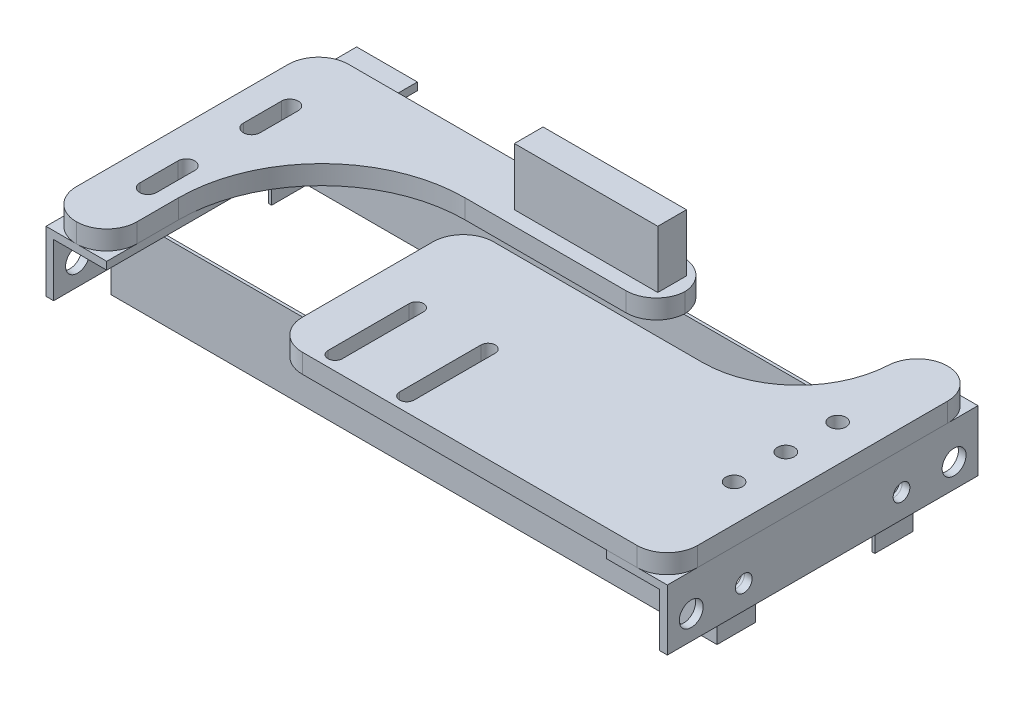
ISO-10303-21;
HEADER;
FILE_DESCRIPTION(('STEP AP214'),'2;1');
FILE_NAME('part.step','',(''),(''),'','','');
FILE_SCHEMA(('AUTOMOTIVE_DESIGN { 1 0 10303 214 1 1 1 1 }'));
ENDSEC;
DATA;
#1=APPLICATION_CONTEXT('core data for automotive mechanical design processes');
#2=APPLICATION_PROTOCOL_DEFINITION('international standard','automotive_design',2000,#1);
#3=PRODUCT_CONTEXT('',#1,'mechanical');
#4=PRODUCT('Part','Part','',(#3));
#5=PRODUCT_RELATED_PRODUCT_CATEGORY('part','',(#4));
#6=PRODUCT_DEFINITION_FORMATION('','',#4);
#7=PRODUCT_DEFINITION_CONTEXT('part definition',#1,'design');
#8=PRODUCT_DEFINITION('design','',#6,#7);
#9=PRODUCT_DEFINITION_SHAPE('','',#8);
#10=(LENGTH_UNIT() NAMED_UNIT(*) SI_UNIT(.MILLI.,.METRE.));
#11=(NAMED_UNIT(*) PLANE_ANGLE_UNIT() SI_UNIT($,.RADIAN.));
#12=(NAMED_UNIT(*) SI_UNIT($,.STERADIAN.) SOLID_ANGLE_UNIT());
#13=UNCERTAINTY_MEASURE_WITH_UNIT(LENGTH_MEASURE(1.E-05),#10,'distance_accuracy_value','');
#14=(GEOMETRIC_REPRESENTATION_CONTEXT(3) GLOBAL_UNCERTAINTY_ASSIGNED_CONTEXT((#13)) GLOBAL_UNIT_ASSIGNED_CONTEXT((#10,
#11,#12)) REPRESENTATION_CONTEXT('',''));
#15=CARTESIAN_POINT('',(0.,0.,0.));
#16=DIRECTION('',(0.,0.,1.));
#17=DIRECTION('',(1.,0.,0.));
#18=AXIS2_PLACEMENT_3D('',#15,#16,#17);
#19=CARTESIAN_POINT('',(0.,6.35000000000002,0.));
#20=DIRECTION('',(0.,1.,0.));
#21=DIRECTION('',(0.,0.,1.));
#22=AXIS2_PLACEMENT_3D('',#19,#20,#21);
#23=PLANE('',#22);
#24=DIRECTION('',(1.,0.,0.));
#25=VECTOR('',#24,1.);
#26=CARTESIAN_POINT('',(0.,6.35000000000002,-54.));
#27=LINE('',#26,#25);
#28=CARTESIAN_POINT('',(-7.,6.35000000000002,-54.));
#29=VERTEX_POINT('',#28);
#30=CARTESIAN_POINT('',(7.,6.35000000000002,-54.));
#31=VERTEX_POINT('',#30);
#32=EDGE_CURVE('E209',#29,#31,#27,.T.);
#33=ORIENTED_EDGE('',*,*,#32,.T.);
#34=DIRECTION('',(0.,0.,1.));
#35=VECTOR('',#34,1.);
#36=CARTESIAN_POINT('',(7.,6.35000000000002,0.));
#37=LINE('',#36,#35);
#38=CARTESIAN_POINT('',(7.,6.35000000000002,-48.));
#39=VERTEX_POINT('',#38);
#40=EDGE_CURVE('E203',#31,#39,#37,.T.);
#41=ORIENTED_EDGE('',*,*,#40,.T.);
#42=DIRECTION('',(1.,0.,0.));
#43=VECTOR('',#42,1.);
#44=CARTESIAN_POINT('',(0.,6.35000000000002,-48.));
#45=LINE('',#44,#43);
#46=CARTESIAN_POINT('',(-7.,6.35000000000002,-48.));
#47=VERTEX_POINT('',#46);
#48=EDGE_CURVE('E186',#47,#39,#45,.T.);
#49=ORIENTED_EDGE('',*,*,#48,.F.);
#50=DIRECTION('',(0.,0.,1.));
#51=VECTOR('',#50,1.);
#52=CARTESIAN_POINT('',(-7.,6.35000000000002,0.));
#53=LINE('',#52,#51);
#54=EDGE_CURVE('E161',#29,#47,#53,.T.);
#55=ORIENTED_EDGE('',*,*,#54,.F.);
#56=EDGE_LOOP('',(#33,#41,#49,#55));
#57=FACE_BOUND('',#56,.T.);
#58=ADVANCED_FACE('F152',(#57),#23,.F.);
#59=CARTESIAN_POINT('',(7.,25.5815462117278,0.));
#60=DIRECTION('',(1.,0.,0.));
#61=DIRECTION('',(0.,0.,-1.));
#62=AXIS2_PLACEMENT_3D('',#59,#60,#61);
#63=PLANE('',#62);
#64=DIRECTION('',(0.,-1.,0.));
#65=VECTOR('',#64,1.);
#66=CARTESIAN_POINT('',(7.,25.5815462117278,-54.));
#67=LINE('',#66,#65);
#68=CARTESIAN_POINT('',(7.,10.35,-54.));
#69=VERTEX_POINT('',#68);
#70=EDGE_CURVE('E13',#69,#31,#67,.T.);
#71=ORIENTED_EDGE('',*,*,#70,.F.);
#72=DIRECTION('',(0.,0.,1.));
#73=VECTOR('',#72,1.);
#74=CARTESIAN_POINT('',(7.,10.35,0.));
#75=LINE('',#74,#73);
#76=CARTESIAN_POINT('',(7.,10.35,-48.));
#77=VERTEX_POINT('',#76);
#78=EDGE_CURVE('E212',#69,#77,#75,.T.);
#79=ORIENTED_EDGE('',*,*,#78,.T.);
#80=DIRECTION('',(0.,-1.,0.));
#81=VECTOR('',#80,1.);
#82=CARTESIAN_POINT('',(7.,25.5815462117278,-48.));
#83=LINE('',#82,#81);
#84=EDGE_CURVE('E194',#77,#39,#83,.T.);
#85=ORIENTED_EDGE('',*,*,#84,.T.);
#86=ORIENTED_EDGE('',*,*,#40,.F.);
#87=EDGE_LOOP('',(#71,#79,#85,#86));
#88=FACE_BOUND('',#87,.T.);
#89=ADVANCED_FACE('F154',(#88),#63,.T.);
#90=CARTESIAN_POINT('',(0.,25.5815462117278,-48.));
#91=DIRECTION('',(0.,0.,-1.));
#92=DIRECTION('',(-1.,0.,0.));
#93=AXIS2_PLACEMENT_3D('',#90,#91,#92);
#94=PLANE('',#93);
#95=ORIENTED_EDGE('',*,*,#84,.F.);
#96=DIRECTION('',(-1.,0.,0.));
#97=VECTOR('',#96,1.);
#98=CARTESIAN_POINT('',(0.,10.35,-48.));
#99=LINE('',#98,#97);
#100=CARTESIAN_POINT('',(15.,10.35,-48.));
#101=VERTEX_POINT('',#100);
#102=EDGE_CURVE('E223',#101,#77,#99,.T.);
#103=ORIENTED_EDGE('',*,*,#102,.F.);
#104=DIRECTION('',(0.,-1.,0.));
#105=VECTOR('',#104,1.);
#106=CARTESIAN_POINT('',(15.,22.35,-48.));
#107=LINE('',#106,#105);
#108=CARTESIAN_POINT('',(15.,22.35,-48.));
#109=VERTEX_POINT('',#108);
#110=EDGE_CURVE('E283',#109,#101,#107,.T.);
#111=ORIENTED_EDGE('',*,*,#110,.F.);
#112=DIRECTION('',(-1.,0.,0.));
#113=VECTOR('',#112,1.);
#114=CARTESIAN_POINT('',(0.,22.35,-48.));
#115=LINE('',#114,#113);
#116=CARTESIAN_POINT('',(-15.,22.35,-48.));
#117=VERTEX_POINT('',#116);
#118=EDGE_CURVE('E274',#109,#117,#115,.T.);
#119=ORIENTED_EDGE('',*,*,#118,.T.);
#120=DIRECTION('',(0.,-1.,0.));
#121=VECTOR('',#120,1.);
#122=CARTESIAN_POINT('',(-15.,22.35,-48.));
#123=LINE('',#122,#121);
#124=CARTESIAN_POINT('',(-15.,10.35,-48.));
#125=VERTEX_POINT('',#124);
#126=EDGE_CURVE('E279',#117,#125,#123,.T.);
#127=ORIENTED_EDGE('',*,*,#126,.T.);
#128=CARTESIAN_POINT('',(-7.,10.35,-48.));
#129=VERTEX_POINT('',#128);
#130=EDGE_CURVE('E191',#129,#125,#99,.T.);
#131=ORIENTED_EDGE('',*,*,#130,.F.);
#132=DIRECTION('',(0.,-1.,0.));
#133=VECTOR('',#132,1.);
#134=CARTESIAN_POINT('',(-7.,25.5815462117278,-48.));
#135=LINE('',#134,#133);
#136=EDGE_CURVE('E181',#129,#47,#135,.T.);
#137=ORIENTED_EDGE('',*,*,#136,.T.);
#138=ORIENTED_EDGE('',*,*,#48,.T.);
#139=EDGE_LOOP('',(#95,#103,#111,#119,#127,#131,#137,#138));
#140=FACE_BOUND('',#139,.T.);
#141=ADVANCED_FACE('F184',(#140),#94,.F.);
#142=CARTESIAN_POINT('',(-7.,25.5815462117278,0.));
#143=DIRECTION('',(1.,0.,0.));
#144=DIRECTION('',(0.,0.,-1.));
#145=AXIS2_PLACEMENT_3D('',#142,#143,#144);
#146=PLANE('',#145);
#147=DIRECTION('',(0.,0.,1.));
#148=VECTOR('',#147,1.);
#149=CARTESIAN_POINT('',(-7.,10.35,0.));
#150=LINE('',#149,#148);
#151=CARTESIAN_POINT('',(-7.,10.35,-54.));
#152=VERTEX_POINT('',#151);
#153=EDGE_CURVE('E211',#152,#129,#150,.T.);
#154=ORIENTED_EDGE('',*,*,#153,.F.);
#155=DIRECTION('',(0.,-1.,0.));
#156=VECTOR('',#155,1.);
#157=CARTESIAN_POINT('',(-7.,25.5815462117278,-54.));
#158=LINE('',#157,#156);
#159=EDGE_CURVE('E199',#152,#29,#158,.T.);
#160=ORIENTED_EDGE('',*,*,#159,.T.);
#161=ORIENTED_EDGE('',*,*,#54,.T.);
#162=ORIENTED_EDGE('',*,*,#136,.F.);
#163=EDGE_LOOP('',(#154,#160,#161,#162));
#164=FACE_BOUND('',#163,.T.);
#165=ADVANCED_FACE('F197',(#164),#146,.F.);
#166=CARTESIAN_POINT('',(0.,25.5815462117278,-54.));
#167=DIRECTION('',(0.,0.,-1.));
#168=DIRECTION('',(-1.,0.,0.));
#169=AXIS2_PLACEMENT_3D('',#166,#167,#168);
#170=PLANE('',#169);
#171=ORIENTED_EDGE('',*,*,#159,.F.);
#172=DIRECTION('',(-1.,0.,0.));
#173=VECTOR('',#172,1.);
#174=CARTESIAN_POINT('',(0.,10.35,-54.));
#175=LINE('',#174,#173);
#176=CARTESIAN_POINT('',(-15.,10.35,-54.));
#177=VERTEX_POINT('',#176);
#178=EDGE_CURVE('E232',#152,#177,#175,.T.);
#179=ORIENTED_EDGE('',*,*,#178,.T.);
#180=DIRECTION('',(0.,-1.,0.));
#181=VECTOR('',#180,1.);
#182=CARTESIAN_POINT('',(-15.,22.35,-54.));
#183=LINE('',#182,#181);
#184=CARTESIAN_POINT('',(-15.,22.35,-54.));
#185=VERTEX_POINT('',#184);
#186=EDGE_CURVE('E263',#185,#177,#183,.T.);
#187=ORIENTED_EDGE('',*,*,#186,.F.);
#188=DIRECTION('',(-1.,0.,0.));
#189=VECTOR('',#188,1.);
#190=CARTESIAN_POINT('',(0.,22.35,-54.));
#191=LINE('',#190,#189);
#192=CARTESIAN_POINT('',(15.,22.35,-54.));
#193=VERTEX_POINT('',#192);
#194=EDGE_CURVE('E257',#193,#185,#191,.T.);
#195=ORIENTED_EDGE('',*,*,#194,.F.);
#196=DIRECTION('',(0.,-1.,0.));
#197=VECTOR('',#196,1.);
#198=CARTESIAN_POINT('',(15.,22.35,-54.));
#199=LINE('',#198,#197);
#200=CARTESIAN_POINT('',(15.,10.35,-54.));
#201=VERTEX_POINT('',#200);
#202=EDGE_CURVE('E216',#193,#201,#199,.T.);
#203=ORIENTED_EDGE('',*,*,#202,.T.);
#204=EDGE_CURVE('E288',#201,#69,#175,.T.);
#205=ORIENTED_EDGE('',*,*,#204,.T.);
#206=ORIENTED_EDGE('',*,*,#70,.T.);
#207=ORIENTED_EDGE('',*,*,#32,.F.);
#208=EDGE_LOOP('',(#171,#179,#187,#195,#203,#205,#206,#207));
#209=FACE_BOUND('',#208,.T.);
#210=ADVANCED_FACE('F259',(#209),#170,.T.);
#211=CARTESIAN_POINT('',(0.,10.35,0.));
#212=DIRECTION('',(0.,1.,0.));
#213=DIRECTION('',(0.,0.,1.));
#214=AXIS2_PLACEMENT_3D('',#211,#212,#213);
#215=PLANE('',#214);
#216=ORIENTED_EDGE('',*,*,#178,.F.);
#217=ORIENTED_EDGE('',*,*,#153,.T.);
#218=ORIENTED_EDGE('',*,*,#130,.T.);
#219=DIRECTION('',(0.,0.,-1.));
#220=VECTOR('',#219,1.);
#221=CARTESIAN_POINT('',(-15.,10.35,0.));
#222=LINE('',#221,#220);
#223=EDGE_CURVE('E286',#125,#177,#222,.T.);
#224=ORIENTED_EDGE('',*,*,#223,.T.);
#225=EDGE_LOOP('',(#216,#217,#218,#224));
#226=FACE_BOUND('',#225,.T.);
#227=ADVANCED_FACE('F298',(#226),#215,.F.);
#228=CARTESIAN_POINT('',(15.,22.35,0.));
#229=DIRECTION('',(-1.,0.,0.));
#230=DIRECTION('',(0.,0.,1.));
#231=AXIS2_PLACEMENT_3D('',#228,#229,#230);
#232=PLANE('',#231);
#233=DIRECTION('',(0.,0.,-1.));
#234=VECTOR('',#233,1.);
#235=CARTESIAN_POINT('',(15.,10.35,0.));
#236=LINE('',#235,#234);
#237=EDGE_CURVE('E278',#101,#201,#236,.T.);
#238=ORIENTED_EDGE('',*,*,#237,.T.);
#239=ORIENTED_EDGE('',*,*,#202,.F.);
#240=DIRECTION('',(0.,0.,-1.));
#241=VECTOR('',#240,1.);
#242=CARTESIAN_POINT('',(15.,22.35,0.));
#243=LINE('',#242,#241);
#244=EDGE_CURVE('E268',#109,#193,#243,.T.);
#245=ORIENTED_EDGE('',*,*,#244,.F.);
#246=ORIENTED_EDGE('',*,*,#110,.T.);
#247=EDGE_LOOP('',(#238,#239,#245,#246));
#248=FACE_BOUND('',#247,.T.);
#249=ADVANCED_FACE('F277',(#248),#232,.F.);
#250=CARTESIAN_POINT('',(-15.,22.35,0.));
#251=DIRECTION('',(-1.,0.,0.));
#252=DIRECTION('',(0.,0.,1.));
#253=AXIS2_PLACEMENT_3D('',#250,#251,#252);
#254=PLANE('',#253);
#255=ORIENTED_EDGE('',*,*,#223,.F.);
#256=ORIENTED_EDGE('',*,*,#126,.F.);
#257=DIRECTION('',(0.,0.,-1.));
#258=VECTOR('',#257,1.);
#259=CARTESIAN_POINT('',(-15.,22.35,0.));
#260=LINE('',#259,#258);
#261=EDGE_CURVE('E267',#117,#185,#260,.T.);
#262=ORIENTED_EDGE('',*,*,#261,.T.);
#263=ORIENTED_EDGE('',*,*,#186,.T.);
#264=EDGE_LOOP('',(#255,#256,#262,#263));
#265=FACE_BOUND('',#264,.T.);
#266=ADVANCED_FACE('F294',(#265),#254,.T.);
#267=CARTESIAN_POINT('',(0.,22.35,0.));
#268=DIRECTION('',(0.,1.,0.));
#269=DIRECTION('',(0.,0.,1.));
#270=AXIS2_PLACEMENT_3D('',#267,#268,#269);
#271=PLANE('',#270);
#272=ORIENTED_EDGE('',*,*,#244,.T.);
#273=ORIENTED_EDGE('',*,*,#194,.T.);
#274=ORIENTED_EDGE('',*,*,#261,.F.);
#275=ORIENTED_EDGE('',*,*,#118,.F.);
#276=EDGE_LOOP('',(#272,#273,#274,#275));
#277=FACE_BOUND('',#276,.T.);
#278=ADVANCED_FACE('F272',(#277),#271,.T.);
#279=ORIENTED_EDGE('',*,*,#78,.F.);
#280=ORIENTED_EDGE('',*,*,#204,.F.);
#281=ORIENTED_EDGE('',*,*,#237,.F.);
#282=ORIENTED_EDGE('',*,*,#102,.T.);
#283=EDGE_LOOP('',(#279,#280,#281,#282));
#284=FACE_BOUND('',#283,.T.);
#285=ADVANCED_FACE('F295',(#284),#215,.F.);
#286=CLOSED_SHELL('',(#58,#89,#141,#165,#210,#227,#249,#266,#278,#285));
#287=MANIFOLD_SOLID_BREP('B2',#286);
#288=CARTESIAN_POINT('',(0.,10.35,-48.));
#289=DIRECTION('',(0.,0.,-1.));
#290=DIRECTION('',(-1.,0.,0.));
#291=AXIS2_PLACEMENT_3D('',#288,#289,#290);
#292=PLANE('',#291);
#293=DIRECTION('',(1.,0.,0.));
#294=VECTOR('',#293,1.);
#295=CARTESIAN_POINT('',(0.,6.35000000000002,-48.));
#296=LINE('',#295,#294);
#297=CARTESIAN_POINT('',(-7.,6.35000000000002,-48.));
#298=VERTEX_POINT('',#297);
#299=CARTESIAN_POINT('',(7.,6.35000000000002,-48.));
#300=VERTEX_POINT('',#299);
#301=EDGE_CURVE('E586',#298,#300,#296,.T.);
#302=ORIENTED_EDGE('',*,*,#301,.F.);
#303=DIRECTION('',(0.,-1.,0.));
#304=VECTOR('',#303,1.);
#305=CARTESIAN_POINT('',(-7.,10.35,-48.));
#306=LINE('',#305,#304);
#307=CARTESIAN_POINT('',(-7.,10.35,-48.));
#308=VERTEX_POINT('',#307);
#309=EDGE_CURVE('E581',#308,#298,#306,.T.);
#310=ORIENTED_EDGE('',*,*,#309,.F.);
#311=DIRECTION('',(1.,0.,0.));
#312=VECTOR('',#311,1.);
#313=CARTESIAN_POINT('',(0.,10.35,-48.));
#314=LINE('',#313,#312);
#315=CARTESIAN_POINT('',(7.,10.35,-48.));
#316=VERTEX_POINT('',#315);
#317=EDGE_CURVE('E600',#308,#316,#314,.T.);
#318=ORIENTED_EDGE('',*,*,#317,.T.);
#319=DIRECTION('',(0.,-1.,0.));
#320=VECTOR('',#319,1.);
#321=CARTESIAN_POINT('',(7.,10.35,-48.));
#322=LINE('',#321,#320);
#323=EDGE_CURVE('E579',#316,#300,#322,.T.);
#324=ORIENTED_EDGE('',*,*,#323,.T.);
#325=EDGE_LOOP('',(#302,#310,#318,#324));
#326=FACE_BOUND('',#325,.T.);
#327=ADVANCED_FACE('F393',(#326),#292,.T.);
#328=CARTESIAN_POINT('',(7.,10.35,0.));
#329=DIRECTION('',(1.,0.,0.));
#330=DIRECTION('',(0.,0.,-1.));
#331=AXIS2_PLACEMENT_3D('',#328,#329,#330);
#332=PLANE('',#331);
#333=DIRECTION('',(0.,0.,1.));
#334=VECTOR('',#333,1.);
#335=CARTESIAN_POINT('',(7.,6.35000000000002,0.));
#336=LINE('',#335,#334);
#337=CARTESIAN_POINT('',(7.,6.35000000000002,-54.));
#338=VERTEX_POINT('',#337);
#339=EDGE_CURVE('E590',#338,#300,#336,.T.);
#340=ORIENTED_EDGE('',*,*,#339,.T.);
#341=ORIENTED_EDGE('',*,*,#323,.F.);
#342=DIRECTION('',(0.,0.,1.));
#343=VECTOR('',#342,1.);
#344=CARTESIAN_POINT('',(7.,10.35,0.));
#345=LINE('',#344,#343);
#346=CARTESIAN_POINT('',(7.,10.35,-54.));
#347=VERTEX_POINT('',#346);
#348=EDGE_CURVE('E603',#347,#316,#345,.T.);
#349=ORIENTED_EDGE('',*,*,#348,.F.);
#350=DIRECTION('',(0.,-1.,0.));
#351=VECTOR('',#350,1.);
#352=CARTESIAN_POINT('',(7.,10.35,-54.));
#353=LINE('',#352,#351);
#354=EDGE_CURVE('E575',#347,#338,#353,.T.);
#355=ORIENTED_EDGE('',*,*,#354,.T.);
#356=EDGE_LOOP('',(#340,#341,#349,#355));
#357=FACE_BOUND('',#356,.T.);
#358=ADVANCED_FACE('F684',(#357),#332,.F.);
#359=CARTESIAN_POINT('',(0.,10.35,-54.));
#360=DIRECTION('',(0.,0.,-1.));
#361=DIRECTION('',(-1.,0.,0.));
#362=AXIS2_PLACEMENT_3D('',#359,#360,#361);
#363=PLANE('',#362);
#364=DIRECTION('',(1.,0.,0.));
#365=VECTOR('',#364,1.);
#366=CARTESIAN_POINT('',(0.,6.35000000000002,-54.));
#367=LINE('',#366,#365);
#368=CARTESIAN_POINT('',(-7.,6.35000000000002,-54.));
#369=VERTEX_POINT('',#368);
#370=EDGE_CURVE('E593',#369,#338,#367,.T.);
#371=ORIENTED_EDGE('',*,*,#370,.T.);
#372=ORIENTED_EDGE('',*,*,#354,.F.);
#373=DIRECTION('',(1.,0.,0.));
#374=VECTOR('',#373,1.);
#375=CARTESIAN_POINT('',(0.,10.35,-54.));
#376=LINE('',#375,#374);
#377=CARTESIAN_POINT('',(-7.,10.35,-54.));
#378=VERTEX_POINT('',#377);
#379=EDGE_CURVE('E605',#378,#347,#376,.T.);
#380=ORIENTED_EDGE('',*,*,#379,.F.);
#381=DIRECTION('',(0.,-1.,0.));
#382=VECTOR('',#381,1.);
#383=CARTESIAN_POINT('',(-7.,10.35,-54.));
#384=LINE('',#383,#382);
#385=EDGE_CURVE('E573',#378,#369,#384,.T.);
#386=ORIENTED_EDGE('',*,*,#385,.T.);
#387=EDGE_LOOP('',(#371,#372,#380,#386));
#388=FACE_BOUND('',#387,.T.);
#389=ADVANCED_FACE('F690',(#388),#363,.F.);
#390=CARTESIAN_POINT('',(-7.,10.35,0.));
#391=DIRECTION('',(1.,0.,0.));
#392=DIRECTION('',(0.,0.,-1.));
#393=AXIS2_PLACEMENT_3D('',#390,#391,#392);
#394=PLANE('',#393);
#395=DIRECTION('',(0.,0.,1.));
#396=VECTOR('',#395,1.);
#397=CARTESIAN_POINT('',(-7.,6.35000000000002,0.));
#398=LINE('',#397,#396);
#399=EDGE_CURVE('E595',#369,#298,#398,.T.);
#400=ORIENTED_EDGE('',*,*,#399,.F.);
#401=ORIENTED_EDGE('',*,*,#385,.F.);
#402=DIRECTION('',(0.,0.,1.));
#403=VECTOR('',#402,1.);
#404=CARTESIAN_POINT('',(-7.,10.35,0.));
#405=LINE('',#404,#403);
#406=EDGE_CURVE('E587',#378,#308,#405,.T.);
#407=ORIENTED_EDGE('',*,*,#406,.T.);
#408=ORIENTED_EDGE('',*,*,#309,.T.);
#409=EDGE_LOOP('',(#400,#401,#407,#408));
#410=FACE_BOUND('',#409,.T.);
#411=ADVANCED_FACE('F709',(#410),#394,.T.);
#412=CARTESIAN_POINT('',(0.,10.35,0.));
#413=DIRECTION('',(0.,1.,0.));
#414=DIRECTION('',(0.,0.,1.));
#415=AXIS2_PLACEMENT_3D('',#412,#413,#414);
#416=PLANE('',#415);
#417=ORIENTED_EDGE('',*,*,#406,.F.);
#418=ORIENTED_EDGE('',*,*,#379,.T.);
#419=ORIENTED_EDGE('',*,*,#348,.T.);
#420=ORIENTED_EDGE('',*,*,#317,.F.);
#421=EDGE_LOOP('',(#417,#418,#419,#420));
#422=FACE_BOUND('',#421,.T.);
#423=CARTESIAN_POINT('',(-58.65,10.35,-6.35));
#424=DIRECTION('',(0.,1.,0.));
#425=DIRECTION('',(0.,0.,1.));
#426=AXIS2_PLACEMENT_3D('',#423,#424,#425);
#427=CIRCLE('',#426,6.35);
#428=CARTESIAN_POINT('',(-65.,10.35,-6.35));
#429=VERTEX_POINT('',#428);
#430=CARTESIAN_POINT('',(-58.65,10.35,0.));
#431=VERTEX_POINT('',#430);
#432=EDGE_CURVE('E629',#429,#431,#427,.T.);
#433=ORIENTED_EDGE('',*,*,#432,.T.);
#434=CARTESIAN_POINT('',(-58.65,10.35,-6.35));
#435=DIRECTION('',(0.,1.,0.));
#436=DIRECTION('',(0.,0.,1.));
#437=AXIS2_PLACEMENT_3D('',#434,#435,#436);
#438=CIRCLE('',#437,6.35);
#439=CARTESIAN_POINT('',(-52.3,10.35,-6.35));
#440=VERTEX_POINT('',#439);
#441=EDGE_CURVE('E631',#431,#440,#438,.T.);
#442=ORIENTED_EDGE('',*,*,#441,.T.);
#443=DIRECTION('',(0.,0.,1.));
#444=VECTOR('',#443,1.);
#445=CARTESIAN_POINT('',(-52.3,10.35,-57.));
#446=LINE('',#445,#444);
#447=CARTESIAN_POINT('',(-52.3,10.35,-15.));
#448=VERTEX_POINT('',#447);
#449=EDGE_CURVE('E675',#448,#440,#446,.T.);
#450=ORIENTED_EDGE('',*,*,#449,.F.);
#451=CARTESIAN_POINT('',(-22.3,10.35,-15.));
#452=DIRECTION('',(0.,1.,0.));
#453=DIRECTION('',(0.,0.,1.));
#454=AXIS2_PLACEMENT_3D('',#451,#452,#453);
#455=CIRCLE('',#454,30.);
#456=CARTESIAN_POINT('',(-22.3,10.35,-45.));
#457=VERTEX_POINT('',#456);
#458=EDGE_CURVE('E150',#448,#457,#455,.F.);
#459=ORIENTED_EDGE('',*,*,#458,.T.);
#460=DIRECTION('',(1.,0.,0.));
#461=VECTOR('',#460,1.);
#462=CARTESIAN_POINT('',(0.,10.35,-45.));
#463=LINE('',#462,#461);
#464=CARTESIAN_POINT('',(11.35,10.35,-45.));
#465=VERTEX_POINT('',#464);
#466=EDGE_CURVE('E583',#457,#465,#463,.T.);
#467=ORIENTED_EDGE('',*,*,#466,.T.);
#468=CARTESIAN_POINT('',(11.35,10.35,-51.35));
#469=DIRECTION('',(0.,1.,0.));
#470=DIRECTION('',(0.,0.,1.));
#471=AXIS2_PLACEMENT_3D('',#468,#469,#470);
#472=CIRCLE('',#471,6.35);
#473=CARTESIAN_POINT('',(17.6903469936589,10.35,-51.));
#474=VERTEX_POINT('',#473);
#475=EDGE_CURVE('E623',#465,#474,#472,.T.);
#476=ORIENTED_EDGE('',*,*,#475,.T.);
#477=CARTESIAN_POINT('',(11.35,10.35,-50.65));
#478=DIRECTION('',(0.,1.,0.));
#479=DIRECTION('',(0.,0.,1.));
#480=AXIS2_PLACEMENT_3D('',#477,#478,#479);
#481=CIRCLE('',#480,6.35);
#482=CARTESIAN_POINT('',(11.35,10.35,-57.));
#483=VERTEX_POINT('',#482);
#484=EDGE_CURVE('E625',#474,#483,#481,.T.);
#485=ORIENTED_EDGE('',*,*,#484,.T.);
#486=DIRECTION('',(1.,0.,0.));
#487=VECTOR('',#486,1.);
#488=CARTESIAN_POINT('',(-65.,10.35,-57.));
#489=LINE('',#488,#487);
#490=CARTESIAN_POINT('',(-58.65,10.35,-57.));
#491=VERTEX_POINT('',#490);
#492=EDGE_CURVE('E970',#491,#483,#489,.T.);
#493=ORIENTED_EDGE('',*,*,#492,.F.);
#494=CARTESIAN_POINT('',(-58.65,10.35,-50.65));
#495=DIRECTION('',(0.,1.,0.));
#496=DIRECTION('',(0.,0.,1.));
#497=AXIS2_PLACEMENT_3D('',#494,#495,#496);
#498=CIRCLE('',#497,6.35);
#499=CARTESIAN_POINT('',(-65.,10.35,-50.65));
#500=VERTEX_POINT('',#499);
#501=EDGE_CURVE('E627',#491,#500,#498,.T.);
#502=ORIENTED_EDGE('',*,*,#501,.T.);
#503=DIRECTION('',(0.,0.,1.));
#504=VECTOR('',#503,1.);
#505=CARTESIAN_POINT('',(-65.,10.35,-57.));
#506=LINE('',#505,#504);
#507=EDGE_CURVE('E598',#500,#429,#506,.T.);
#508=ORIENTED_EDGE('',*,*,#507,.T.);
#509=EDGE_LOOP('',(#433,#442,#450,#459,#467,#476,#485,#493,#502,#508));
#510=FACE_BOUND('',#509,.T.);
#511=CARTESIAN_POINT('',(-57.3,10.35,-43.3333333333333));
#512=DIRECTION('',(0.,1.,0.));
#513=DIRECTION('',(0.,0.,1.));
#514=AXIS2_PLACEMENT_3D('',#511,#512,#513);
#515=CIRCLE('',#514,1.75);
#516=CARTESIAN_POINT('',(-55.55,10.35,-43.3333333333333));
#517=VERTEX_POINT('',#516);
#518=CARTESIAN_POINT('',(-59.05,10.35,-43.3333333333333));
#519=VERTEX_POINT('',#518);
#520=EDGE_CURVE('E936',#517,#519,#515,.T.);
#521=ORIENTED_EDGE('',*,*,#520,.F.);
#522=DIRECTION('',(0.,0.,1.));
#523=VECTOR('',#522,1.);
#524=CARTESIAN_POINT('',(-55.55,10.35,-43.3333333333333));
#525=LINE('',#524,#523);
#526=CARTESIAN_POINT('',(-55.55,10.35,-35.3333333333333));
#527=VERTEX_POINT('',#526);
#528=EDGE_CURVE('E944',#517,#527,#525,.T.);
#529=ORIENTED_EDGE('',*,*,#528,.T.);
#530=CARTESIAN_POINT('',(-57.3,10.35,-35.3333333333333));
#531=DIRECTION('',(0.,1.,0.));
#532=DIRECTION('',(0.,0.,1.));
#533=AXIS2_PLACEMENT_3D('',#530,#531,#532);
#534=CIRCLE('',#533,1.75);
#535=CARTESIAN_POINT('',(-59.05,10.35,-35.3333333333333));
#536=VERTEX_POINT('',#535);
#537=EDGE_CURVE('E941',#536,#527,#534,.T.);
#538=ORIENTED_EDGE('',*,*,#537,.F.);
#539=DIRECTION('',(0.,0.,1.));
#540=VECTOR('',#539,1.);
#541=CARTESIAN_POINT('',(-59.05,10.35,-43.3333333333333));
#542=LINE('',#541,#540);
#543=EDGE_CURVE('E939',#519,#536,#542,.T.);
#544=ORIENTED_EDGE('',*,*,#543,.F.);
#545=EDGE_LOOP('',(#521,#529,#538,#544));
#546=FACE_BOUND('',#545,.T.);
#547=CARTESIAN_POINT('',(-57.3,10.35,-21.6666666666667));
#548=DIRECTION('',(0.,1.,0.));
#549=DIRECTION('',(0.,0.,1.));
#550=AXIS2_PLACEMENT_3D('',#547,#548,#549);
#551=CIRCLE('',#550,1.75);
#552=CARTESIAN_POINT('',(-55.55,10.35,-21.6666666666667));
#553=VERTEX_POINT('',#552);
#554=CARTESIAN_POINT('',(-59.05,10.35,-21.6666666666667));
#555=VERTEX_POINT('',#554);
#556=EDGE_CURVE('E564',#553,#555,#551,.T.);
#557=ORIENTED_EDGE('',*,*,#556,.F.);
#558=DIRECTION('',(0.,0.,1.));
#559=VECTOR('',#558,1.);
#560=CARTESIAN_POINT('',(-55.55,10.35,-21.6666666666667));
#561=LINE('',#560,#559);
#562=CARTESIAN_POINT('',(-55.55,10.35,-13.6666666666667));
#563=VERTEX_POINT('',#562);
#564=EDGE_CURVE('E545',#553,#563,#561,.T.);
#565=ORIENTED_EDGE('',*,*,#564,.T.);
#566=CARTESIAN_POINT('',(-57.3,10.35,-13.6666666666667));
#567=DIRECTION('',(0.,1.,0.));
#568=DIRECTION('',(0.,0.,1.));
#569=AXIS2_PLACEMENT_3D('',#566,#567,#568);
#570=CIRCLE('',#569,1.75000000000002);
#571=CARTESIAN_POINT('',(-59.05,10.35,-13.6666666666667));
#572=VERTEX_POINT('',#571);
#573=EDGE_CURVE('E557',#572,#563,#570,.T.);
#574=ORIENTED_EDGE('',*,*,#573,.F.);
#575=DIRECTION('',(0.,0.,1.));
#576=VECTOR('',#575,1.);
#577=CARTESIAN_POINT('',(-59.05,10.35,-21.6666666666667));
#578=LINE('',#577,#576);
#579=EDGE_CURVE('E561',#555,#572,#578,.T.);
#580=ORIENTED_EDGE('',*,*,#579,.F.);
#581=EDGE_LOOP('',(#557,#565,#574,#580));
#582=FACE_BOUND('',#581,.T.);
#583=ADVANCED_FACE('F563',(#422,#510,#546,#582),#416,.T.);
#584=CARTESIAN_POINT('',(0.,6.35000000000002,0.));
#585=DIRECTION('',(0.,1.,0.));
#586=DIRECTION('',(0.,0.,1.));
#587=AXIS2_PLACEMENT_3D('',#584,#585,#586);
#588=PLANE('',#587);
#589=ORIENTED_EDGE('',*,*,#399,.T.);
#590=ORIENTED_EDGE('',*,*,#301,.T.);
#591=ORIENTED_EDGE('',*,*,#339,.F.);
#592=ORIENTED_EDGE('',*,*,#370,.F.);
#593=EDGE_LOOP('',(#589,#590,#591,#592));
#594=FACE_BOUND('',#593,.T.);
#595=DIRECTION('',(1.,0.,0.));
#596=VECTOR('',#595,1.);
#597=CARTESIAN_POINT('',(0.,6.35000000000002,-45.));
#598=LINE('',#597,#596);
#599=CARTESIAN_POINT('',(-22.3,6.35000000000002,-45.));
#600=VERTEX_POINT('',#599);
#601=CARTESIAN_POINT('',(11.35,6.35000000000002,-45.));
#602=VERTEX_POINT('',#601);
#603=EDGE_CURVE('E584',#600,#602,#598,.T.);
#604=ORIENTED_EDGE('',*,*,#603,.F.);
#605=CARTESIAN_POINT('',(-22.3,6.35000000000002,-15.));
#606=DIRECTION('',(0.,1.,0.));
#607=DIRECTION('',(0.,0.,1.));
#608=AXIS2_PLACEMENT_3D('',#605,#606,#607);
#609=CIRCLE('',#608,30.);
#610=CARTESIAN_POINT('',(-52.3,6.35000000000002,-15.));
#611=VERTEX_POINT('',#610);
#612=EDGE_CURVE('E401',#600,#611,#609,.T.);
#613=ORIENTED_EDGE('',*,*,#612,.T.);
#614=DIRECTION('',(0.,0.,1.));
#615=VECTOR('',#614,1.);
#616=CARTESIAN_POINT('',(-52.3,6.35000000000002,-57.));
#617=LINE('',#616,#615);
#618=CARTESIAN_POINT('',(-52.3,6.35000000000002,-6.35));
#619=VERTEX_POINT('',#618);
#620=EDGE_CURVE('E967',#611,#619,#617,.T.);
#621=ORIENTED_EDGE('',*,*,#620,.T.);
#622=CARTESIAN_POINT('',(-58.65,6.35000000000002,-6.35));
#623=DIRECTION('',(0.,1.,0.));
#624=DIRECTION('',(0.,0.,1.));
#625=AXIS2_PLACEMENT_3D('',#622,#623,#624);
#626=CIRCLE('',#625,6.35);
#627=CARTESIAN_POINT('',(-58.65,6.35000000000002,0.));
#628=VERTEX_POINT('',#627);
#629=EDGE_CURVE('E621',#619,#628,#626,.F.);
#630=ORIENTED_EDGE('',*,*,#629,.T.);
#631=CARTESIAN_POINT('',(-58.65,6.35000000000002,-6.35));
#632=DIRECTION('',(0.,1.,0.));
#633=DIRECTION('',(0.,0.,1.));
#634=AXIS2_PLACEMENT_3D('',#631,#632,#633);
#635=CIRCLE('',#634,6.35);
#636=CARTESIAN_POINT('',(-65.,6.35000000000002,-6.35));
#637=VERTEX_POINT('',#636);
#638=EDGE_CURVE('E619',#628,#637,#635,.F.);
#639=ORIENTED_EDGE('',*,*,#638,.T.);
#640=DIRECTION('',(0.,0.,1.));
#641=VECTOR('',#640,1.);
#642=CARTESIAN_POINT('',(-65.,6.35000000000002,-57.));
#643=LINE('',#642,#641);
#644=CARTESIAN_POINT('',(-65.,6.35000000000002,-50.65));
#645=VERTEX_POINT('',#644);
#646=EDGE_CURVE('E969',#645,#637,#643,.T.);
#647=ORIENTED_EDGE('',*,*,#646,.F.);
#648=CARTESIAN_POINT('',(-58.65,6.35000000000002,-50.65));
#649=DIRECTION('',(0.,1.,0.));
#650=DIRECTION('',(0.,0.,1.));
#651=AXIS2_PLACEMENT_3D('',#648,#649,#650);
#652=CIRCLE('',#651,6.35);
#653=CARTESIAN_POINT('',(-58.65,6.35000000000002,-57.));
#654=VERTEX_POINT('',#653);
#655=EDGE_CURVE('E617',#645,#654,#652,.F.);
#656=ORIENTED_EDGE('',*,*,#655,.T.);
#657=DIRECTION('',(1.,0.,0.));
#658=VECTOR('',#657,1.);
#659=CARTESIAN_POINT('',(-65.,6.35000000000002,-57.));
#660=LINE('',#659,#658);
#661=CARTESIAN_POINT('',(11.35,6.35000000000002,-57.));
#662=VERTEX_POINT('',#661);
#663=EDGE_CURVE('E975',#654,#662,#660,.T.);
#664=ORIENTED_EDGE('',*,*,#663,.T.);
#665=CARTESIAN_POINT('',(11.35,6.35000000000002,-50.65));
#666=DIRECTION('',(0.,1.,0.));
#667=DIRECTION('',(0.,0.,1.));
#668=AXIS2_PLACEMENT_3D('',#665,#666,#667);
#669=CIRCLE('',#668,6.35);
#670=CARTESIAN_POINT('',(17.6903469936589,6.35000000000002,-51.));
#671=VERTEX_POINT('',#670);
#672=EDGE_CURVE('E615',#662,#671,#669,.F.);
#673=ORIENTED_EDGE('',*,*,#672,.T.);
#674=CARTESIAN_POINT('',(11.35,6.35000000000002,-51.35));
#675=DIRECTION('',(0.,1.,0.));
#676=DIRECTION('',(0.,0.,1.));
#677=AXIS2_PLACEMENT_3D('',#674,#675,#676);
#678=CIRCLE('',#677,6.35);
#679=EDGE_CURVE('E612',#671,#602,#678,.F.);
#680=ORIENTED_EDGE('',*,*,#679,.T.);
#681=EDGE_LOOP('',(#604,#613,#621,#630,#639,#647,#656,#664,#673,#680));
#682=FACE_BOUND('',#681,.T.);
#683=DIRECTION('',(0.,0.,1.));
#684=VECTOR('',#683,1.);
#685=CARTESIAN_POINT('',(-55.55,6.35000000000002,-43.3333333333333));
#686=LINE('',#685,#684);
#687=CARTESIAN_POINT('',(-55.55,6.35000000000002,-43.3333333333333));
#688=VERTEX_POINT('',#687);
#689=CARTESIAN_POINT('',(-55.55,6.35000000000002,-35.3333333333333));
#690=VERTEX_POINT('',#689);
#691=EDGE_CURVE('E938',#688,#690,#686,.T.);
#692=ORIENTED_EDGE('',*,*,#691,.F.);
#693=CARTESIAN_POINT('',(-57.3,6.35000000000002,-43.3333333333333));
#694=DIRECTION('',(0.,1.,0.));
#695=DIRECTION('',(0.,0.,1.));
#696=AXIS2_PLACEMENT_3D('',#693,#694,#695);
#697=CIRCLE('',#696,1.75);
#698=CARTESIAN_POINT('',(-59.05,6.35000000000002,-43.3333333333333));
#699=VERTEX_POINT('',#698);
#700=EDGE_CURVE('E930',#688,#699,#697,.T.);
#701=ORIENTED_EDGE('',*,*,#700,.T.);
#702=DIRECTION('',(0.,0.,1.));
#703=VECTOR('',#702,1.);
#704=CARTESIAN_POINT('',(-59.05,6.35000000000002,-43.3333333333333));
#705=LINE('',#704,#703);
#706=CARTESIAN_POINT('',(-59.05,6.35000000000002,-35.3333333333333));
#707=VERTEX_POINT('',#706);
#708=EDGE_CURVE('E950',#699,#707,#705,.T.);
#709=ORIENTED_EDGE('',*,*,#708,.T.);
#710=CARTESIAN_POINT('',(-57.3,6.35000000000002,-35.3333333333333));
#711=DIRECTION('',(0.,1.,0.));
#712=DIRECTION('',(0.,0.,1.));
#713=AXIS2_PLACEMENT_3D('',#710,#711,#712);
#714=CIRCLE('',#713,1.75);
#715=EDGE_CURVE('E953',#707,#690,#714,.T.);
#716=ORIENTED_EDGE('',*,*,#715,.T.);
#717=EDGE_LOOP('',(#692,#701,#709,#716));
#718=FACE_BOUND('',#717,.T.);
#719=DIRECTION('',(0.,0.,1.));
#720=VECTOR('',#719,1.);
#721=CARTESIAN_POINT('',(-55.55,6.35000000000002,-21.6666666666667));
#722=LINE('',#721,#720);
#723=CARTESIAN_POINT('',(-55.55,6.35000000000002,-21.6666666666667));
#724=VERTEX_POINT('',#723);
#725=CARTESIAN_POINT('',(-55.55,6.35000000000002,-13.6666666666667));
#726=VERTEX_POINT('',#725);
#727=EDGE_CURVE('E548',#724,#726,#722,.T.);
#728=ORIENTED_EDGE('',*,*,#727,.F.);
#729=CARTESIAN_POINT('',(-57.3,6.35000000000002,-21.6666666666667));
#730=DIRECTION('',(0.,1.,0.));
#731=DIRECTION('',(0.,0.,1.));
#732=AXIS2_PLACEMENT_3D('',#729,#730,#731);
#733=CIRCLE('',#732,1.75);
#734=CARTESIAN_POINT('',(-59.05,6.35000000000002,-21.6666666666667));
#735=VERTEX_POINT('',#734);
#736=EDGE_CURVE('E568',#724,#735,#733,.T.);
#737=ORIENTED_EDGE('',*,*,#736,.T.);
#738=DIRECTION('',(0.,0.,1.));
#739=VECTOR('',#738,1.);
#740=CARTESIAN_POINT('',(-59.05,6.35000000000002,-21.6666666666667));
#741=LINE('',#740,#739);
#742=CARTESIAN_POINT('',(-59.05,6.35000000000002,-13.6666666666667));
#743=VERTEX_POINT('',#742);
#744=EDGE_CURVE('E924',#735,#743,#741,.T.);
#745=ORIENTED_EDGE('',*,*,#744,.T.);
#746=CARTESIAN_POINT('',(-57.3,6.35000000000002,-13.6666666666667));
#747=DIRECTION('',(0.,1.,0.));
#748=DIRECTION('',(0.,0.,1.));
#749=AXIS2_PLACEMENT_3D('',#746,#747,#748);
#750=CIRCLE('',#749,1.75000000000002);
#751=EDGE_CURVE('E929',#743,#726,#750,.T.);
#752=ORIENTED_EDGE('',*,*,#751,.T.);
#753=EDGE_LOOP('',(#728,#737,#745,#752));
#754=FACE_BOUND('',#753,.T.);
#755=ADVANCED_FACE('F661',(#594,#682,#718,#754),#588,.F.);
#756=CARTESIAN_POINT('',(0.,10.35,-45.));
#757=DIRECTION('',(0.,0.,-1.));
#758=DIRECTION('',(-1.,0.,0.));
#759=AXIS2_PLACEMENT_3D('',#756,#757,#758);
#760=PLANE('',#759);
#761=ORIENTED_EDGE('',*,*,#466,.F.);
#762=DIRECTION('',(0.,-1.,0.));
#763=VECTOR('',#762,1.);
#764=CARTESIAN_POINT('',(-22.3,10.35,-45.));
#765=LINE('',#764,#763);
#766=EDGE_CURVE('E647',#457,#600,#765,.T.);
#767=ORIENTED_EDGE('',*,*,#766,.T.);
#768=ORIENTED_EDGE('',*,*,#603,.T.);
#769=DIRECTION('',(0.,-1.,0.));
#770=VECTOR('',#769,1.);
#771=CARTESIAN_POINT('',(11.35,10.35,-45.));
#772=LINE('',#771,#770);
#773=EDGE_CURVE('E644',#602,#465,#772,.F.);
#774=ORIENTED_EDGE('',*,*,#773,.T.);
#775=EDGE_LOOP('',(#761,#767,#768,#774));
#776=FACE_BOUND('',#775,.T.);
#777=ADVANCED_FACE('F658',(#776),#760,.F.);
#778=CARTESIAN_POINT('',(0.,10.35,-57.));
#779=DIRECTION('',(0.,0.,-1.));
#780=DIRECTION('',(-1.,0.,0.));
#781=AXIS2_PLACEMENT_3D('',#778,#779,#780);
#782=PLANE('',#781);
#783=ORIENTED_EDGE('',*,*,#663,.F.);
#784=DIRECTION('',(0.,-1.,0.));
#785=VECTOR('',#784,1.);
#786=CARTESIAN_POINT('',(-58.65,10.35,-57.));
#787=LINE('',#786,#785);
#788=EDGE_CURVE('E642',#654,#491,#787,.F.);
#789=ORIENTED_EDGE('',*,*,#788,.T.);
#790=ORIENTED_EDGE('',*,*,#492,.T.);
#791=DIRECTION('',(0.,-1.,0.));
#792=VECTOR('',#791,1.);
#793=CARTESIAN_POINT('',(11.35,10.35,-57.));
#794=LINE('',#793,#792);
#795=EDGE_CURVE('E639',#483,#662,#794,.T.);
#796=ORIENTED_EDGE('',*,*,#795,.T.);
#797=EDGE_LOOP('',(#783,#789,#790,#796));
#798=FACE_BOUND('',#797,.T.);
#799=ADVANCED_FACE('F696',(#798),#782,.T.);
#800=CARTESIAN_POINT('',(-59.05,10.35,-21.6666666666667));
#801=DIRECTION('',(1.,0.,0.));
#802=DIRECTION('',(0.,0.,-1.));
#803=AXIS2_PLACEMENT_3D('',#800,#801,#802);
#804=PLANE('',#803);
#805=ORIENTED_EDGE('',*,*,#744,.F.);
#806=DIRECTION('',(0.,-1.,0.));
#807=VECTOR('',#806,1.);
#808=CARTESIAN_POINT('',(-59.05,10.35,-21.6666666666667));
#809=LINE('',#808,#807);
#810=EDGE_CURVE('E926',#555,#735,#809,.T.);
#811=ORIENTED_EDGE('',*,*,#810,.F.);
#812=ORIENTED_EDGE('',*,*,#579,.T.);
#813=DIRECTION('',(0.,-1.,0.));
#814=VECTOR('',#813,1.);
#815=CARTESIAN_POINT('',(-59.05,10.35,-13.6666666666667));
#816=LINE('',#815,#814);
#817=EDGE_CURVE('E553',#572,#743,#816,.T.);
#818=ORIENTED_EDGE('',*,*,#817,.T.);
#819=EDGE_LOOP('',(#805,#811,#812,#818));
#820=FACE_BOUND('',#819,.T.);
#821=ADVANCED_FACE('F699',(#820),#804,.T.);
#822=CARTESIAN_POINT('',(-57.3,10.35,-13.6666666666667));
#823=DIRECTION('',(0.,-1.,0.));
#824=DIRECTION('',(0.,0.,-1.));
#825=AXIS2_PLACEMENT_3D('',#822,#823,#824);
#826=CYLINDRICAL_SURFACE('',#825,1.75000000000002);
#827=ORIENTED_EDGE('',*,*,#751,.F.);
#828=ORIENTED_EDGE('',*,*,#817,.F.);
#829=ORIENTED_EDGE('',*,*,#573,.T.);
#830=DIRECTION('',(0.,-1.,0.));
#831=VECTOR('',#830,1.);
#832=CARTESIAN_POINT('',(-55.55,10.35,-13.6666666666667));
#833=LINE('',#832,#831);
#834=EDGE_CURVE('E540',#563,#726,#833,.T.);
#835=ORIENTED_EDGE('',*,*,#834,.T.);
#836=EDGE_LOOP('',(#827,#828,#829,#835));
#837=FACE_BOUND('',#836,.T.);
#838=ADVANCED_FACE('F558',(#837),#826,.F.);
#839=CARTESIAN_POINT('',(-55.55,10.35,-21.6666666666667));
#840=DIRECTION('',(1.,0.,0.));
#841=DIRECTION('',(0.,0.,-1.));
#842=AXIS2_PLACEMENT_3D('',#839,#840,#841);
#843=PLANE('',#842);
#844=ORIENTED_EDGE('',*,*,#727,.T.);
#845=ORIENTED_EDGE('',*,*,#834,.F.);
#846=ORIENTED_EDGE('',*,*,#564,.F.);
#847=DIRECTION('',(0.,-1.,0.));
#848=VECTOR('',#847,1.);
#849=CARTESIAN_POINT('',(-55.55,10.35,-21.6666666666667));
#850=LINE('',#849,#848);
#851=EDGE_CURVE('E552',#553,#724,#850,.T.);
#852=ORIENTED_EDGE('',*,*,#851,.T.);
#853=EDGE_LOOP('',(#844,#845,#846,#852));
#854=FACE_BOUND('',#853,.T.);
#855=ADVANCED_FACE('F542',(#854),#843,.F.);
#856=CARTESIAN_POINT('',(-57.3,10.35,-21.6666666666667));
#857=DIRECTION('',(0.,-1.,0.));
#858=DIRECTION('',(0.,0.,-1.));
#859=AXIS2_PLACEMENT_3D('',#856,#857,#858);
#860=CYLINDRICAL_SURFACE('',#859,1.75);
#861=ORIENTED_EDGE('',*,*,#736,.F.);
#862=ORIENTED_EDGE('',*,*,#851,.F.);
#863=ORIENTED_EDGE('',*,*,#556,.T.);
#864=ORIENTED_EDGE('',*,*,#810,.T.);
#865=EDGE_LOOP('',(#861,#862,#863,#864));
#866=FACE_BOUND('',#865,.T.);
#867=ADVANCED_FACE('F826',(#866),#860,.F.);
#868=CARTESIAN_POINT('',(-59.05,10.35,-43.3333333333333));
#869=DIRECTION('',(1.,0.,0.));
#870=DIRECTION('',(0.,0.,-1.));
#871=AXIS2_PLACEMENT_3D('',#868,#869,#870);
#872=PLANE('',#871);
#873=ORIENTED_EDGE('',*,*,#708,.F.);
#874=DIRECTION('',(0.,-1.,0.));
#875=VECTOR('',#874,1.);
#876=CARTESIAN_POINT('',(-59.05,10.35,-43.3333333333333));
#877=LINE('',#876,#875);
#878=EDGE_CURVE('E964',#519,#699,#877,.T.);
#879=ORIENTED_EDGE('',*,*,#878,.F.);
#880=ORIENTED_EDGE('',*,*,#543,.T.);
#881=DIRECTION('',(0.,-1.,0.));
#882=VECTOR('',#881,1.);
#883=CARTESIAN_POINT('',(-59.05,10.35,-35.3333333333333));
#884=LINE('',#883,#882);
#885=EDGE_CURVE('E962',#536,#707,#884,.T.);
#886=ORIENTED_EDGE('',*,*,#885,.T.);
#887=EDGE_LOOP('',(#873,#879,#880,#886));
#888=FACE_BOUND('',#887,.T.);
#889=ADVANCED_FACE('F815',(#888),#872,.T.);
#890=CARTESIAN_POINT('',(-57.3,10.35,-35.3333333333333));
#891=DIRECTION('',(0.,-1.,0.));
#892=DIRECTION('',(0.,0.,-1.));
#893=AXIS2_PLACEMENT_3D('',#890,#891,#892);
#894=CYLINDRICAL_SURFACE('',#893,1.75);
#895=ORIENTED_EDGE('',*,*,#715,.F.);
#896=ORIENTED_EDGE('',*,*,#885,.F.);
#897=ORIENTED_EDGE('',*,*,#537,.T.);
#898=DIRECTION('',(0.,-1.,0.));
#899=VECTOR('',#898,1.);
#900=CARTESIAN_POINT('',(-55.55,10.35,-35.3333333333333));
#901=LINE('',#900,#899);
#902=EDGE_CURVE('E960',#527,#690,#901,.T.);
#903=ORIENTED_EDGE('',*,*,#902,.T.);
#904=EDGE_LOOP('',(#895,#896,#897,#903));
#905=FACE_BOUND('',#904,.T.);
#906=ADVANCED_FACE('F823',(#905),#894,.F.);
#907=CARTESIAN_POINT('',(-55.55,10.35,-43.3333333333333));
#908=DIRECTION('',(1.,0.,0.));
#909=DIRECTION('',(0.,0.,-1.));
#910=AXIS2_PLACEMENT_3D('',#907,#908,#909);
#911=PLANE('',#910);
#912=ORIENTED_EDGE('',*,*,#691,.T.);
#913=ORIENTED_EDGE('',*,*,#902,.F.);
#914=ORIENTED_EDGE('',*,*,#528,.F.);
#915=DIRECTION('',(0.,-1.,0.));
#916=VECTOR('',#915,1.);
#917=CARTESIAN_POINT('',(-55.55,10.35,-43.3333333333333));
#918=LINE('',#917,#916);
#919=EDGE_CURVE('E947',#517,#688,#918,.T.);
#920=ORIENTED_EDGE('',*,*,#919,.T.);
#921=EDGE_LOOP('',(#912,#913,#914,#920));
#922=FACE_BOUND('',#921,.T.);
#923=ADVANCED_FACE('F812',(#922),#911,.F.);
#924=CARTESIAN_POINT('',(-57.3,10.35,-43.3333333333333));
#925=DIRECTION('',(0.,-1.,0.));
#926=DIRECTION('',(0.,0.,-1.));
#927=AXIS2_PLACEMENT_3D('',#924,#925,#926);
#928=CYLINDRICAL_SURFACE('',#927,1.75);
#929=ORIENTED_EDGE('',*,*,#700,.F.);
#930=ORIENTED_EDGE('',*,*,#919,.F.);
#931=ORIENTED_EDGE('',*,*,#520,.T.);
#932=ORIENTED_EDGE('',*,*,#878,.T.);
#933=EDGE_LOOP('',(#929,#930,#931,#932));
#934=FACE_BOUND('',#933,.T.);
#935=ADVANCED_FACE('F796',(#934),#928,.F.);
#936=CARTESIAN_POINT('',(-65.,10.35,-57.));
#937=DIRECTION('',(1.,0.,0.));
#938=DIRECTION('',(0.,0.,-1.));
#939=AXIS2_PLACEMENT_3D('',#936,#937,#938);
#940=PLANE('',#939);
#941=ORIENTED_EDGE('',*,*,#646,.T.);
#942=DIRECTION('',(0.,-1.,0.));
#943=VECTOR('',#942,1.);
#944=CARTESIAN_POINT('',(-65.,10.35,-6.35));
#945=LINE('',#944,#943);
#946=EDGE_CURVE('E637',#637,#429,#945,.F.);
#947=ORIENTED_EDGE('',*,*,#946,.T.);
#948=ORIENTED_EDGE('',*,*,#507,.F.);
#949=DIRECTION('',(0.,-1.,0.));
#950=VECTOR('',#949,1.);
#951=CARTESIAN_POINT('',(-65.,6.35000000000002,-50.65));
#952=LINE('',#951,#950);
#953=EDGE_CURVE('E634',#500,#645,#952,.T.);
#954=ORIENTED_EDGE('',*,*,#953,.T.);
#955=EDGE_LOOP('',(#941,#947,#948,#954));
#956=FACE_BOUND('',#955,.T.);
#957=ADVANCED_FACE('F763',(#956),#940,.F.);
#958=CARTESIAN_POINT('',(-52.3,10.35,-57.));
#959=DIRECTION('',(1.,0.,0.));
#960=DIRECTION('',(0.,0.,-1.));
#961=AXIS2_PLACEMENT_3D('',#958,#959,#960);
#962=PLANE('',#961);
#963=ORIENTED_EDGE('',*,*,#620,.F.);
#964=DIRECTION('',(0.,-1.,0.));
#965=VECTOR('',#964,1.);
#966=CARTESIAN_POINT('',(-52.3,10.35,-15.));
#967=LINE('',#966,#965);
#968=EDGE_CURVE('E414',#611,#448,#967,.F.);
#969=ORIENTED_EDGE('',*,*,#968,.T.);
#970=ORIENTED_EDGE('',*,*,#449,.T.);
#971=DIRECTION('',(0.,-1.,0.));
#972=VECTOR('',#971,1.);
#973=CARTESIAN_POINT('',(-52.3,6.35000000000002,-6.35));
#974=LINE('',#973,#972);
#975=EDGE_CURVE('E609',#440,#619,#974,.T.);
#976=ORIENTED_EDGE('',*,*,#975,.T.);
#977=EDGE_LOOP('',(#963,#969,#970,#976));
#978=FACE_BOUND('',#977,.T.);
#979=ADVANCED_FACE('F701',(#978),#962,.T.);
#980=CARTESIAN_POINT('',(-58.65,10.35,-6.35));
#981=DIRECTION('',(0.,-1.,0.));
#982=DIRECTION('',(0.,0.,-1.));
#983=AXIS2_PLACEMENT_3D('',#980,#981,#982);
#984=CYLINDRICAL_SURFACE('',#983,6.35);
#985=DIRECTION('',(0.,-1.,0.));
#986=VECTOR('',#985,1.);
#987=CARTESIAN_POINT('',(-58.65,10.35,0.));
#988=LINE('',#987,#986);
#989=EDGE_CURVE('E576',#431,#628,#988,.T.);
#990=ORIENTED_EDGE('',*,*,#989,.F.);
#991=ORIENTED_EDGE('',*,*,#432,.F.);
#992=ORIENTED_EDGE('',*,*,#946,.F.);
#993=ORIENTED_EDGE('',*,*,#638,.F.);
#994=EDGE_LOOP('',(#990,#991,#992,#993));
#995=FACE_BOUND('',#994,.T.);
#996=ADVANCED_FACE('F715',(#995),#984,.T.);
#997=CARTESIAN_POINT('',(-58.65,10.35,-6.35));
#998=DIRECTION('',(0.,1.,0.));
#999=DIRECTION('',(0.,0.,1.));
#1000=AXIS2_PLACEMENT_3D('',#997,#998,#999);
#1001=CYLINDRICAL_SURFACE('',#1000,6.35);
#1002=ORIENTED_EDGE('',*,*,#441,.F.);
#1003=ORIENTED_EDGE('',*,*,#989,.T.);
#1004=ORIENTED_EDGE('',*,*,#629,.F.);
#1005=ORIENTED_EDGE('',*,*,#975,.F.);
#1006=EDGE_LOOP('',(#1002,#1003,#1004,#1005));
#1007=FACE_BOUND('',#1006,.T.);
#1008=ADVANCED_FACE('F711',(#1007),#1001,.T.);
#1009=CARTESIAN_POINT('',(-58.65,10.35,-50.65));
#1010=DIRECTION('',(0.,1.,0.));
#1011=DIRECTION('',(0.,0.,1.));
#1012=AXIS2_PLACEMENT_3D('',#1009,#1010,#1011);
#1013=CYLINDRICAL_SURFACE('',#1012,6.35);
#1014=ORIENTED_EDGE('',*,*,#501,.F.);
#1015=ORIENTED_EDGE('',*,*,#788,.F.);
#1016=ORIENTED_EDGE('',*,*,#655,.F.);
#1017=ORIENTED_EDGE('',*,*,#953,.F.);
#1018=EDGE_LOOP('',(#1014,#1015,#1016,#1017));
#1019=FACE_BOUND('',#1018,.T.);
#1020=ADVANCED_FACE('F714',(#1019),#1013,.T.);
#1021=CARTESIAN_POINT('',(11.35,10.35,-51.35));
#1022=DIRECTION('',(0.,1.,0.));
#1023=DIRECTION('',(0.,0.,1.));
#1024=AXIS2_PLACEMENT_3D('',#1021,#1022,#1023);
#1025=CYLINDRICAL_SURFACE('',#1024,6.35);
#1026=DIRECTION('',(0.,1.,0.));
#1027=VECTOR('',#1026,1.);
#1028=CARTESIAN_POINT('',(17.6903469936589,8.35000000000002,-51.));
#1029=LINE('',#1028,#1027);
#1030=EDGE_CURVE('E650',#474,#671,#1029,.F.);
#1031=ORIENTED_EDGE('',*,*,#1030,.F.);
#1032=ORIENTED_EDGE('',*,*,#475,.F.);
#1033=ORIENTED_EDGE('',*,*,#773,.F.);
#1034=ORIENTED_EDGE('',*,*,#679,.F.);
#1035=EDGE_LOOP('',(#1031,#1032,#1033,#1034));
#1036=FACE_BOUND('',#1035,.T.);
#1037=ADVANCED_FACE('F669',(#1036),#1025,.T.);
#1038=CARTESIAN_POINT('',(11.35,10.35,-50.65));
#1039=DIRECTION('',(0.,-1.,0.));
#1040=DIRECTION('',(0.,0.,-1.));
#1041=AXIS2_PLACEMENT_3D('',#1038,#1039,#1040);
#1042=CYLINDRICAL_SURFACE('',#1041,6.35);
#1043=ORIENTED_EDGE('',*,*,#484,.F.);
#1044=ORIENTED_EDGE('',*,*,#1030,.T.);
#1045=ORIENTED_EDGE('',*,*,#672,.F.);
#1046=ORIENTED_EDGE('',*,*,#795,.F.);
#1047=EDGE_LOOP('',(#1043,#1044,#1045,#1046));
#1048=FACE_BOUND('',#1047,.T.);
#1049=ADVANCED_FACE('F677',(#1048),#1042,.T.);
#1050=CARTESIAN_POINT('',(-22.3,10.35,-15.));
#1051=DIRECTION('',(0.,-1.,0.));
#1052=DIRECTION('',(0.,0.,-1.));
#1053=AXIS2_PLACEMENT_3D('',#1050,#1051,#1052);
#1054=CYLINDRICAL_SURFACE('',#1053,30.);
#1055=ORIENTED_EDGE('',*,*,#458,.F.);
#1056=ORIENTED_EDGE('',*,*,#968,.F.);
#1057=ORIENTED_EDGE('',*,*,#612,.F.);
#1058=ORIENTED_EDGE('',*,*,#766,.F.);
#1059=EDGE_LOOP('',(#1055,#1056,#1057,#1058));
#1060=FACE_BOUND('',#1059,.T.);
#1061=ADVANCED_FACE('F395',(#1060),#1054,.F.);
#1062=CLOSED_SHELL('',(#327,#358,#389,#411,#583,#755,#777,#799,#821,#838,#855,#867,#889,#906,
#923,#935,#957,#979,#996,#1008,#1020,#1037,#1049,#1061));
#1063=MANIFOLD_SOLID_BREP('B7',#1062);
#1064=CARTESIAN_POINT('',(6.,10.35,0.));
#1065=DIRECTION('',(-1.,0.,0.));
#1066=DIRECTION('',(0.,0.,1.));
#1067=AXIS2_PLACEMENT_3D('',#1064,#1065,#1066);
#1068=PLANE('',#1067);
#1069=DIRECTION('',(0.,0.,-1.));
#1070=VECTOR('',#1069,1.);
#1071=CARTESIAN_POINT('',(6.,6.35000000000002,0.));
#1072=LINE('',#1071,#1070);
#1073=CARTESIAN_POINT('',(6.,6.35000000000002,-2.99999999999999));
#1074=VERTEX_POINT('',#1073);
#1075=CARTESIAN_POINT('',(6.,6.35000000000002,-20.));
#1076=VERTEX_POINT('',#1075);
#1077=EDGE_CURVE('E1229',#1074,#1076,#1072,.T.);
#1078=ORIENTED_EDGE('',*,*,#1077,.T.);
#1079=DIRECTION('',(0.,-1.,0.));
#1080=VECTOR('',#1079,1.);
#1081=CARTESIAN_POINT('',(6.,10.35,-20.));
#1082=LINE('',#1081,#1080);
#1083=CARTESIAN_POINT('',(6.,10.35,-20.));
#1084=VERTEX_POINT('',#1083);
#1085=EDGE_CURVE('E1254',#1084,#1076,#1082,.T.);
#1086=ORIENTED_EDGE('',*,*,#1085,.F.);
#1087=DIRECTION('',(0.,0.,-1.));
#1088=VECTOR('',#1087,1.);
#1089=CARTESIAN_POINT('',(6.,10.35,0.));
#1090=LINE('',#1089,#1088);
#1091=CARTESIAN_POINT('',(6.,10.35,-2.99999999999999));
#1092=VERTEX_POINT('',#1091);
#1093=EDGE_CURVE('E1188',#1092,#1084,#1090,.T.);
#1094=ORIENTED_EDGE('',*,*,#1093,.F.);
#1095=DIRECTION('',(0.,-1.,0.));
#1096=VECTOR('',#1095,1.);
#1097=CARTESIAN_POINT('',(6.,10.35,-2.99999999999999));
#1098=LINE('',#1097,#1096);
#1099=EDGE_CURVE('E1156',#1092,#1074,#1098,.T.);
#1100=ORIENTED_EDGE('',*,*,#1099,.T.);
#1101=EDGE_LOOP('',(#1078,#1086,#1094,#1100));
#1102=FACE_BOUND('',#1101,.T.);
#1103=ADVANCED_FACE('F1022',(#1102),#1068,.F.);
#1104=CARTESIAN_POINT('',(7.5,10.35,-20.));
#1105=DIRECTION('',(0.,-1.,0.));
#1106=DIRECTION('',(0.,0.,-1.));
#1107=AXIS2_PLACEMENT_3D('',#1104,#1105,#1106);
#1108=CYLINDRICAL_SURFACE('',#1107,1.5);
#1109=CARTESIAN_POINT('',(7.5,6.35000000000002,-20.));
#1110=DIRECTION('',(0.,1.,0.));
#1111=DIRECTION('',(0.,0.,1.));
#1112=AXIS2_PLACEMENT_3D('',#1109,#1110,#1111);
#1113=CIRCLE('',#1112,1.5);
#1114=CARTESIAN_POINT('',(9.,6.35000000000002,-20.));
#1115=VERTEX_POINT('',#1114);
#1116=EDGE_CURVE('E1232',#1076,#1115,#1113,.F.);
#1117=ORIENTED_EDGE('',*,*,#1116,.T.);
#1118=DIRECTION('',(0.,-1.,0.));
#1119=VECTOR('',#1118,1.);
#1120=CARTESIAN_POINT('',(9.,10.35,-20.));
#1121=LINE('',#1120,#1119);
#1122=CARTESIAN_POINT('',(9.,10.35,-20.));
#1123=VERTEX_POINT('',#1122);
#1124=EDGE_CURVE('E1252',#1123,#1115,#1121,.T.);
#1125=ORIENTED_EDGE('',*,*,#1124,.F.);
#1126=CARTESIAN_POINT('',(7.5,10.35,-20.));
#1127=DIRECTION('',(0.,1.,0.));
#1128=DIRECTION('',(0.,0.,1.));
#1129=AXIS2_PLACEMENT_3D('',#1126,#1127,#1128);
#1130=CIRCLE('',#1129,1.5);
#1131=EDGE_CURVE('E1191',#1084,#1123,#1130,.F.);
#1132=ORIENTED_EDGE('',*,*,#1131,.F.);
#1133=ORIENTED_EDGE('',*,*,#1085,.T.);
#1134=EDGE_LOOP('',(#1117,#1125,#1132,#1133));
#1135=FACE_BOUND('',#1134,.T.);
#1136=ADVANCED_FACE('F1352',(#1135),#1108,.F.);
#1137=CARTESIAN_POINT('',(9.,10.35,0.));
#1138=DIRECTION('',(-1.,0.,0.));
#1139=DIRECTION('',(0.,0.,1.));
#1140=AXIS2_PLACEMENT_3D('',#1137,#1138,#1139);
#1141=PLANE('',#1140);
#1142=DIRECTION('',(0.,0.,-1.));
#1143=VECTOR('',#1142,1.);
#1144=CARTESIAN_POINT('',(9.,6.35000000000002,0.));
#1145=LINE('',#1144,#1143);
#1146=CARTESIAN_POINT('',(9.,6.35000000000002,-2.99999999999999));
#1147=VERTEX_POINT('',#1146);
#1148=EDGE_CURVE('E1235',#1147,#1115,#1145,.T.);
#1149=ORIENTED_EDGE('',*,*,#1148,.F.);
#1150=DIRECTION('',(0.,-1.,0.));
#1151=VECTOR('',#1150,1.);
#1152=CARTESIAN_POINT('',(9.,10.35,-2.99999999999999));
#1153=LINE('',#1152,#1151);
#1154=CARTESIAN_POINT('',(9.,10.35,-2.99999999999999));
#1155=VERTEX_POINT('',#1154);
#1156=EDGE_CURVE('E1250',#1155,#1147,#1153,.T.);
#1157=ORIENTED_EDGE('',*,*,#1156,.F.);
#1158=DIRECTION('',(0.,0.,-1.));
#1159=VECTOR('',#1158,1.);
#1160=CARTESIAN_POINT('',(9.,10.35,0.));
#1161=LINE('',#1160,#1159);
#1162=EDGE_CURVE('E1193',#1155,#1123,#1161,.T.);
#1163=ORIENTED_EDGE('',*,*,#1162,.T.);
#1164=ORIENTED_EDGE('',*,*,#1124,.T.);
#1165=EDGE_LOOP('',(#1149,#1157,#1163,#1164));
#1166=FACE_BOUND('',#1165,.T.);
#1167=ADVANCED_FACE('F1358',(#1166),#1141,.T.);
#1168=CARTESIAN_POINT('',(0.,10.35,-40.));
#1169=DIRECTION('',(0.,0.,1.));
#1170=DIRECTION('',(1.,0.,0.));
#1171=AXIS2_PLACEMENT_3D('',#1168,#1169,#1170);
#1172=PLANE('',#1171);
#1173=DIRECTION('',(-1.,0.,0.));
#1174=VECTOR('',#1173,1.);
#1175=CARTESIAN_POINT('',(0.,10.35,-40.));
#1176=LINE('',#1175,#1174);
#1177=CARTESIAN_POINT('',(32.3346052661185,10.35,-40.));
#1178=VERTEX_POINT('',#1177);
#1179=CARTESIAN_POINT('',(-11.35,10.35,-40.));
#1180=VERTEX_POINT('',#1179);
#1181=EDGE_CURVE('E1177',#1178,#1180,#1176,.T.);
#1182=ORIENTED_EDGE('',*,*,#1181,.F.);
#1183=DIRECTION('',(0.,-1.,0.));
#1184=VECTOR('',#1183,1.);
#1185=CARTESIAN_POINT('',(32.3346052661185,10.35,-40.));
#1186=LINE('',#1185,#1184);
#1187=CARTESIAN_POINT('',(32.3346052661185,6.35000000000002,-40.));
#1188=VERTEX_POINT('',#1187);
#1189=EDGE_CURVE('E1300',#1178,#1188,#1186,.T.);
#1190=ORIENTED_EDGE('',*,*,#1189,.T.);
#1191=DIRECTION('',(-1.,0.,0.));
#1192=VECTOR('',#1191,1.);
#1193=CARTESIAN_POINT('',(0.,6.35000000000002,-40.));
#1194=LINE('',#1193,#1192);
#1195=CARTESIAN_POINT('',(-11.35,6.35000000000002,-40.));
#1196=VERTEX_POINT('',#1195);
#1197=EDGE_CURVE('E1218',#1188,#1196,#1194,.T.);
#1198=ORIENTED_EDGE('',*,*,#1197,.T.);
#1199=DIRECTION('',(0.,-1.,0.));
#1200=VECTOR('',#1199,1.);
#1201=CARTESIAN_POINT('',(-11.35,10.35,-40.));
#1202=LINE('',#1201,#1200);
#1203=EDGE_CURVE('E1297',#1196,#1180,#1202,.F.);
#1204=ORIENTED_EDGE('',*,*,#1203,.T.);
#1205=EDGE_LOOP('',(#1182,#1190,#1198,#1204));
#1206=FACE_BOUND('',#1205,.T.);
#1207=ADVANCED_FACE('F1308',(#1206),#1172,.F.);
#1208=CARTESIAN_POINT('',(-17.7,10.35,0.));
#1209=DIRECTION('',(1.,0.,0.));
#1210=DIRECTION('',(0.,0.,-1.));
#1211=AXIS2_PLACEMENT_3D('',#1208,#1209,#1210);
#1212=PLANE('',#1211);
#1213=DIRECTION('',(0.,0.,1.));
#1214=VECTOR('',#1213,1.);
#1215=CARTESIAN_POINT('',(-17.7,6.35000000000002,0.));
#1216=LINE('',#1215,#1214);
#1217=CARTESIAN_POINT('',(-17.7,6.35000000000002,-33.65));
#1218=VERTEX_POINT('',#1217);
#1219=CARTESIAN_POINT('',(-17.7,6.35000000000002,-6.35));
#1220=VERTEX_POINT('',#1219);
#1221=EDGE_CURVE('E1220',#1218,#1220,#1216,.T.);
#1222=ORIENTED_EDGE('',*,*,#1221,.T.);
#1223=DIRECTION('',(0.,-1.,0.));
#1224=VECTOR('',#1223,1.);
#1225=CARTESIAN_POINT('',(-17.7,10.35,-6.35));
#1226=LINE('',#1225,#1224);
#1227=CARTESIAN_POINT('',(-17.7,10.35,-6.35));
#1228=VERTEX_POINT('',#1227);
#1229=EDGE_CURVE('E1295',#1220,#1228,#1226,.F.);
#1230=ORIENTED_EDGE('',*,*,#1229,.T.);
#1231=DIRECTION('',(0.,0.,1.));
#1232=VECTOR('',#1231,1.);
#1233=CARTESIAN_POINT('',(-17.7,10.35,0.));
#1234=LINE('',#1233,#1232);
#1235=CARTESIAN_POINT('',(-17.7,10.35,-33.65));
#1236=VERTEX_POINT('',#1235);
#1237=EDGE_CURVE('E1179',#1236,#1228,#1234,.T.);
#1238=ORIENTED_EDGE('',*,*,#1237,.F.);
#1239=DIRECTION('',(0.,-1.,0.));
#1240=VECTOR('',#1239,1.);
#1241=CARTESIAN_POINT('',(-17.7,10.35,-33.65));
#1242=LINE('',#1241,#1240);
#1243=EDGE_CURVE('E1292',#1236,#1218,#1242,.T.);
#1244=ORIENTED_EDGE('',*,*,#1243,.T.);
#1245=EDGE_LOOP('',(#1222,#1230,#1238,#1244));
#1246=FACE_BOUND('',#1245,.T.);
#1247=ADVANCED_FACE('F1323',(#1246),#1212,.F.);
#1248=CARTESIAN_POINT('',(0.,10.35,0.));
#1249=DIRECTION('',(0.,0.,1.));
#1250=DIRECTION('',(1.,0.,0.));
#1251=AXIS2_PLACEMENT_3D('',#1248,#1249,#1250);
#1252=PLANE('',#1251);
#1253=DIRECTION('',(-1.,0.,0.));
#1254=VECTOR('',#1253,1.);
#1255=CARTESIAN_POINT('',(0.,6.35000000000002,0.));
#1256=LINE('',#1255,#1254);
#1257=CARTESIAN_POINT('',(58.65,6.35000000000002,0.));
#1258=VERTEX_POINT('',#1257);
#1259=CARTESIAN_POINT('',(-11.35,6.35000000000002,0.));
#1260=VERTEX_POINT('',#1259);
#1261=EDGE_CURVE('E1223',#1258,#1260,#1256,.T.);
#1262=ORIENTED_EDGE('',*,*,#1261,.F.);
#1263=DIRECTION('',(0.,-1.,0.));
#1264=VECTOR('',#1263,1.);
#1265=CARTESIAN_POINT('',(58.65,10.35,0.));
#1266=LINE('',#1265,#1264);
#1267=CARTESIAN_POINT('',(58.65,10.35,0.));
#1268=VERTEX_POINT('',#1267);
#1269=EDGE_CURVE('E1290',#1258,#1268,#1266,.F.);
#1270=ORIENTED_EDGE('',*,*,#1269,.T.);
#1271=DIRECTION('',(-1.,0.,0.));
#1272=VECTOR('',#1271,1.);
#1273=CARTESIAN_POINT('',(0.,10.35,0.));
#1274=LINE('',#1273,#1272);
#1275=CARTESIAN_POINT('',(-11.35,10.35,0.));
#1276=VERTEX_POINT('',#1275);
#1277=EDGE_CURVE('E1182',#1268,#1276,#1274,.T.);
#1278=ORIENTED_EDGE('',*,*,#1277,.T.);
#1279=DIRECTION('',(0.,-1.,0.));
#1280=VECTOR('',#1279,1.);
#1281=CARTESIAN_POINT('',(-11.35,6.35000000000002,0.));
#1282=LINE('',#1281,#1280);
#1283=EDGE_CURVE('E1287',#1276,#1260,#1282,.T.);
#1284=ORIENTED_EDGE('',*,*,#1283,.T.);
#1285=EDGE_LOOP('',(#1262,#1270,#1278,#1284));
#1286=FACE_BOUND('',#1285,.T.);
#1287=ADVANCED_FACE('F1332',(#1286),#1252,.T.);
#1288=CARTESIAN_POINT('',(65.,10.35,0.));
#1289=DIRECTION('',(-1.,0.,0.));
#1290=DIRECTION('',(0.,0.,1.));
#1291=AXIS2_PLACEMENT_3D('',#1288,#1289,#1290);
#1292=PLANE('',#1291);
#1293=DIRECTION('',(0.,0.,-1.));
#1294=VECTOR('',#1293,1.);
#1295=CARTESIAN_POINT('',(65.,6.35000000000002,0.));
#1296=LINE('',#1295,#1294);
#1297=CARTESIAN_POINT('',(65.,6.35000000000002,-6.35000000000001));
#1298=VERTEX_POINT('',#1297);
#1299=CARTESIAN_POINT('',(65.,6.35000000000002,-58.65));
#1300=VERTEX_POINT('',#1299);
#1301=EDGE_CURVE('E1226',#1298,#1300,#1296,.T.);
#1302=ORIENTED_EDGE('',*,*,#1301,.T.);
#1303=DIRECTION('',(0.,-1.,0.));
#1304=VECTOR('',#1303,1.);
#1305=CARTESIAN_POINT('',(65.,10.35,-58.65));
#1306=LINE('',#1305,#1304);
#1307=CARTESIAN_POINT('',(65.,10.35,-58.65));
#1308=VERTEX_POINT('',#1307);
#1309=EDGE_CURVE('E1285',#1300,#1308,#1306,.F.);
#1310=ORIENTED_EDGE('',*,*,#1309,.T.);
#1311=DIRECTION('',(0.,0.,-1.));
#1312=VECTOR('',#1311,1.);
#1313=CARTESIAN_POINT('',(65.,10.35,0.));
#1314=LINE('',#1313,#1312);
#1315=CARTESIAN_POINT('',(65.,10.35,-6.35000000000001));
#1316=VERTEX_POINT('',#1315);
#1317=EDGE_CURVE('E1185',#1316,#1308,#1314,.T.);
#1318=ORIENTED_EDGE('',*,*,#1317,.F.);
#1319=DIRECTION('',(0.,-1.,0.));
#1320=VECTOR('',#1319,1.);
#1321=CARTESIAN_POINT('',(65.,6.35000000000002,-6.35000000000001));
#1322=LINE('',#1321,#1320);
#1323=EDGE_CURVE('E1282',#1316,#1298,#1322,.T.);
#1324=ORIENTED_EDGE('',*,*,#1323,.T.);
#1325=EDGE_LOOP('',(#1302,#1310,#1318,#1324));
#1326=FACE_BOUND('',#1325,.T.);
#1327=ADVANCED_FACE('F1340',(#1326),#1292,.F.);
#1328=CARTESIAN_POINT('',(-7.5,10.35,-20.));
#1329=DIRECTION('',(0.,-1.,0.));
#1330=DIRECTION('',(0.,0.,-1.));
#1331=AXIS2_PLACEMENT_3D('',#1328,#1329,#1330);
#1332=CYLINDRICAL_SURFACE('',#1331,1.5);
#1333=CARTESIAN_POINT('',(-7.5,6.35000000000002,-20.));
#1334=DIRECTION('',(0.,1.,0.));
#1335=DIRECTION('',(0.,0.,1.));
#1336=AXIS2_PLACEMENT_3D('',#1333,#1334,#1335);
#1337=CIRCLE('',#1336,1.5);
#1338=CARTESIAN_POINT('',(-6.,6.35000000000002,-20.));
#1339=VERTEX_POINT('',#1338);
#1340=CARTESIAN_POINT('',(-9.,6.35000000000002,-20.));
#1341=VERTEX_POINT('',#1340);
#1342=EDGE_CURVE('E1151',#1339,#1341,#1337,.T.);
#1343=ORIENTED_EDGE('',*,*,#1342,.F.);
#1344=DIRECTION('',(0.,-1.,0.));
#1345=VECTOR('',#1344,1.);
#1346=CARTESIAN_POINT('',(-6.,10.35,-20.));
#1347=LINE('',#1346,#1345);
#1348=CARTESIAN_POINT('',(-6.,10.35,-20.));
#1349=VERTEX_POINT('',#1348);
#1350=EDGE_CURVE('E1146',#1349,#1339,#1347,.T.);
#1351=ORIENTED_EDGE('',*,*,#1350,.F.);
#1352=CARTESIAN_POINT('',(-7.5,10.35,-20.));
#1353=DIRECTION('',(0.,1.,0.));
#1354=DIRECTION('',(0.,0.,1.));
#1355=AXIS2_PLACEMENT_3D('',#1352,#1353,#1354);
#1356=CIRCLE('',#1355,1.5);
#1357=CARTESIAN_POINT('',(-9.,10.35,-20.));
#1358=VERTEX_POINT('',#1357);
#1359=EDGE_CURVE('E1149',#1349,#1358,#1356,.T.);
#1360=ORIENTED_EDGE('',*,*,#1359,.T.);
#1361=DIRECTION('',(0.,-1.,0.));
#1362=VECTOR('',#1361,1.);
#1363=CARTESIAN_POINT('',(-9.,10.35,-20.));
#1364=LINE('',#1363,#1362);
#1365=EDGE_CURVE('E1207',#1358,#1341,#1364,.T.);
#1366=ORIENTED_EDGE('',*,*,#1365,.T.);
#1367=EDGE_LOOP('',(#1343,#1351,#1360,#1366));
#1368=FACE_BOUND('',#1367,.T.);
#1369=ADVANCED_FACE('F1148',(#1368),#1332,.F.);
#1370=CARTESIAN_POINT('',(-6.,10.35,0.));
#1371=DIRECTION('',(-1.,0.,0.));
#1372=DIRECTION('',(0.,0.,1.));
#1373=AXIS2_PLACEMENT_3D('',#1370,#1371,#1372);
#1374=PLANE('',#1373);
#1375=DIRECTION('',(0.,0.,-1.));
#1376=VECTOR('',#1375,1.);
#1377=CARTESIAN_POINT('',(-6.,6.35000000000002,0.));
#1378=LINE('',#1377,#1376);
#1379=CARTESIAN_POINT('',(-6.,6.35000000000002,-2.99999999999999));
#1380=VERTEX_POINT('',#1379);
#1381=EDGE_CURVE('E1209',#1380,#1339,#1378,.T.);
#1382=ORIENTED_EDGE('',*,*,#1381,.F.);
#1383=DIRECTION('',(0.,-1.,0.));
#1384=VECTOR('',#1383,1.);
#1385=CARTESIAN_POINT('',(-6.,10.35,-2.99999999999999));
#1386=LINE('',#1385,#1384);
#1387=CARTESIAN_POINT('',(-6.,10.35,-2.99999999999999));
#1388=VERTEX_POINT('',#1387);
#1389=EDGE_CURVE('E1157',#1388,#1380,#1386,.T.);
#1390=ORIENTED_EDGE('',*,*,#1389,.F.);
#1391=DIRECTION('',(0.,0.,-1.));
#1392=VECTOR('',#1391,1.);
#1393=CARTESIAN_POINT('',(-6.,10.35,0.));
#1394=LINE('',#1393,#1392);
#1395=EDGE_CURVE('E1164',#1388,#1349,#1394,.T.);
#1396=ORIENTED_EDGE('',*,*,#1395,.T.);
#1397=ORIENTED_EDGE('',*,*,#1350,.T.);
#1398=EDGE_LOOP('',(#1382,#1390,#1396,#1397));
#1399=FACE_BOUND('',#1398,.T.);
#1400=ADVANCED_FACE('F1171',(#1399),#1374,.T.);
#1401=CARTESIAN_POINT('',(-7.5,10.35,-2.99999999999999));
#1402=DIRECTION('',(0.,-1.,0.));
#1403=DIRECTION('',(0.,0.,-1.));
#1404=AXIS2_PLACEMENT_3D('',#1401,#1402,#1403);
#1405=CYLINDRICAL_SURFACE('',#1404,1.5);
#1406=CARTESIAN_POINT('',(-7.5,6.35000000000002,-2.99999999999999));
#1407=DIRECTION('',(0.,1.,0.));
#1408=DIRECTION('',(0.,0.,1.));
#1409=AXIS2_PLACEMENT_3D('',#1406,#1407,#1408);
#1410=CIRCLE('',#1409,1.5);
#1411=CARTESIAN_POINT('',(-9.,6.35000000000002,-2.99999999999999));
#1412=VERTEX_POINT('',#1411);
#1413=EDGE_CURVE('E1212',#1412,#1380,#1410,.T.);
#1414=ORIENTED_EDGE('',*,*,#1413,.F.);
#1415=DIRECTION('',(0.,-1.,0.));
#1416=VECTOR('',#1415,1.);
#1417=CARTESIAN_POINT('',(-9.,10.35,-2.99999999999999));
#1418=LINE('',#1417,#1416);
#1419=CARTESIAN_POINT('',(-9.,10.35,-2.99999999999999));
#1420=VERTEX_POINT('',#1419);
#1421=EDGE_CURVE('E1259',#1420,#1412,#1418,.T.);
#1422=ORIENTED_EDGE('',*,*,#1421,.F.);
#1423=CARTESIAN_POINT('',(-7.5,10.35,-2.99999999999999));
#1424=DIRECTION('',(0.,1.,0.));
#1425=DIRECTION('',(0.,0.,1.));
#1426=AXIS2_PLACEMENT_3D('',#1423,#1424,#1425);
#1427=CIRCLE('',#1426,1.5);
#1428=EDGE_CURVE('E1172',#1420,#1388,#1427,.T.);
#1429=ORIENTED_EDGE('',*,*,#1428,.T.);
#1430=ORIENTED_EDGE('',*,*,#1389,.T.);
#1431=EDGE_LOOP('',(#1414,#1422,#1429,#1430));
#1432=FACE_BOUND('',#1431,.T.);
#1433=ADVANCED_FACE('F1377',(#1432),#1405,.F.);
#1434=CARTESIAN_POINT('',(57.3,10.35,-43.3333333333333));
#1435=DIRECTION('',(0.,-1.,0.));
#1436=DIRECTION('',(0.,0.,-1.));
#1437=AXIS2_PLACEMENT_3D('',#1434,#1435,#1436);
#1438=CYLINDRICAL_SURFACE('',#1437,1.75);
#1439=CARTESIAN_POINT('',(57.3,10.35,-43.3333333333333));
#1440=DIRECTION('',(0.,1.,0.));
#1441=DIRECTION('',(0.,0.,1.));
#1442=AXIS2_PLACEMENT_3D('',#1439,#1440,#1441);
#1443=CIRCLE('',#1442,1.75);
#1444=CARTESIAN_POINT('',(57.3,10.35,-41.5833333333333));
#1445=VERTEX_POINT('',#1444);
#1446=EDGE_CURVE('E1201',#1445,#1445,#1443,.F.);
#1447=ORIENTED_EDGE('',*,*,#1446,.F.);
#1448=EDGE_LOOP('',(#1447));
#1449=FACE_BOUND('',#1448,.T.);
#1450=CARTESIAN_POINT('',(57.3,6.35000000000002,-43.3333333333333));
#1451=DIRECTION('',(0.,1.,0.));
#1452=DIRECTION('',(0.,0.,1.));
#1453=AXIS2_PLACEMENT_3D('',#1450,#1451,#1452);
#1454=CIRCLE('',#1453,1.75);
#1455=CARTESIAN_POINT('',(57.3,6.35000000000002,-41.5833333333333));
#1456=VERTEX_POINT('',#1455);
#1457=EDGE_CURVE('E1243',#1456,#1456,#1454,.F.);
#1458=ORIENTED_EDGE('',*,*,#1457,.T.);
#1459=EDGE_LOOP('',(#1458));
#1460=FACE_BOUND('',#1459,.T.);
#1461=ADVANCED_FACE('F1380',(#1449,#1460),#1438,.F.);
#1462=CARTESIAN_POINT('',(57.3,10.35,-32.5));
#1463=DIRECTION('',(0.,-1.,0.));
#1464=DIRECTION('',(0.,0.,-1.));
#1465=AXIS2_PLACEMENT_3D('',#1462,#1463,#1464);
#1466=CYLINDRICAL_SURFACE('',#1465,1.75);
#1467=CARTESIAN_POINT('',(57.3,10.35,-32.5));
#1468=DIRECTION('',(0.,1.,0.));
#1469=DIRECTION('',(0.,0.,1.));
#1470=AXIS2_PLACEMENT_3D('',#1467,#1468,#1469);
#1471=CIRCLE('',#1470,1.75);
#1472=CARTESIAN_POINT('',(57.3,10.35,-30.75));
#1473=VERTEX_POINT('',#1472);
#1474=EDGE_CURVE('E1198',#1473,#1473,#1471,.F.);
#1475=ORIENTED_EDGE('',*,*,#1474,.F.);
#1476=EDGE_LOOP('',(#1475));
#1477=FACE_BOUND('',#1476,.T.);
#1478=CARTESIAN_POINT('',(57.3,6.35000000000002,-32.5));
#1479=DIRECTION('',(0.,1.,0.));
#1480=DIRECTION('',(0.,0.,1.));
#1481=AXIS2_PLACEMENT_3D('',#1478,#1479,#1480);
#1482=CIRCLE('',#1481,1.75);
#1483=CARTESIAN_POINT('',(57.3,6.35000000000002,-30.75));
#1484=VERTEX_POINT('',#1483);
#1485=EDGE_CURVE('E1240',#1484,#1484,#1482,.F.);
#1486=ORIENTED_EDGE('',*,*,#1485,.T.);
#1487=EDGE_LOOP('',(#1486));
#1488=FACE_BOUND('',#1487,.T.);
#1489=ADVANCED_FACE('F1498',(#1477,#1488),#1466,.F.);
#1490=CARTESIAN_POINT('',(7.5,10.35,-2.99999999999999));
#1491=DIRECTION('',(0.,-1.,0.));
#1492=DIRECTION('',(0.,0.,-1.));
#1493=AXIS2_PLACEMENT_3D('',#1490,#1491,#1492);
#1494=CYLINDRICAL_SURFACE('',#1493,1.5);
#1495=CARTESIAN_POINT('',(7.5,6.35000000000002,-2.99999999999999));
#1496=DIRECTION('',(0.,1.,0.));
#1497=DIRECTION('',(0.,0.,1.));
#1498=AXIS2_PLACEMENT_3D('',#1495,#1496,#1497);
#1499=CIRCLE('',#1498,1.5);
#1500=EDGE_CURVE('E1238',#1147,#1074,#1499,.F.);
#1501=ORIENTED_EDGE('',*,*,#1500,.T.);
#1502=ORIENTED_EDGE('',*,*,#1099,.F.);
#1503=CARTESIAN_POINT('',(7.5,10.35,-2.99999999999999));
#1504=DIRECTION('',(0.,1.,0.));
#1505=DIRECTION('',(0.,0.,1.));
#1506=AXIS2_PLACEMENT_3D('',#1503,#1504,#1505);
#1507=CIRCLE('',#1506,1.5);
#1508=EDGE_CURVE('E1196',#1155,#1092,#1507,.F.);
#1509=ORIENTED_EDGE('',*,*,#1508,.F.);
#1510=ORIENTED_EDGE('',*,*,#1156,.T.);
#1511=EDGE_LOOP('',(#1501,#1502,#1509,#1510));
#1512=FACE_BOUND('',#1511,.T.);
#1513=ADVANCED_FACE('F1375',(#1512),#1494,.F.);
#1514=CARTESIAN_POINT('',(-9.,10.35,0.));
#1515=DIRECTION('',(-1.,0.,0.));
#1516=DIRECTION('',(0.,0.,1.));
#1517=AXIS2_PLACEMENT_3D('',#1514,#1515,#1516);
#1518=PLANE('',#1517);
#1519=DIRECTION('',(0.,0.,-1.));
#1520=VECTOR('',#1519,1.);
#1521=CARTESIAN_POINT('',(-9.,6.35000000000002,0.));
#1522=LINE('',#1521,#1520);
#1523=EDGE_CURVE('E1215',#1412,#1341,#1522,.T.);
#1524=ORIENTED_EDGE('',*,*,#1523,.T.);
#1525=ORIENTED_EDGE('',*,*,#1365,.F.);
#1526=DIRECTION('',(0.,0.,-1.));
#1527=VECTOR('',#1526,1.);
#1528=CARTESIAN_POINT('',(-9.,10.35,0.));
#1529=LINE('',#1528,#1527);
#1530=EDGE_CURVE('E1167',#1420,#1358,#1529,.T.);
#1531=ORIENTED_EDGE('',*,*,#1530,.F.);
#1532=ORIENTED_EDGE('',*,*,#1421,.T.);
#1533=EDGE_LOOP('',(#1524,#1525,#1531,#1532));
#1534=FACE_BOUND('',#1533,.T.);
#1535=ADVANCED_FACE('F1371',(#1534),#1518,.F.);
#1536=CARTESIAN_POINT('',(57.3,10.35,-21.6666666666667));
#1537=DIRECTION('',(0.,-1.,0.));
#1538=DIRECTION('',(0.,0.,-1.));
#1539=AXIS2_PLACEMENT_3D('',#1536,#1537,#1538);
#1540=CYLINDRICAL_SURFACE('',#1539,1.75);
#1541=CARTESIAN_POINT('',(57.3,10.35,-21.6666666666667));
#1542=DIRECTION('',(0.,1.,0.));
#1543=DIRECTION('',(0.,0.,1.));
#1544=AXIS2_PLACEMENT_3D('',#1541,#1542,#1543);
#1545=CIRCLE('',#1544,1.75);
#1546=CARTESIAN_POINT('',(57.3,10.35,-19.9166666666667));
#1547=VERTEX_POINT('',#1546);
#1548=EDGE_CURVE('E1204',#1547,#1547,#1545,.F.);
#1549=ORIENTED_EDGE('',*,*,#1548,.F.);
#1550=EDGE_LOOP('',(#1549));
#1551=FACE_BOUND('',#1550,.T.);
#1552=CARTESIAN_POINT('',(57.3,6.35000000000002,-21.6666666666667));
#1553=DIRECTION('',(0.,1.,0.));
#1554=DIRECTION('',(0.,0.,1.));
#1555=AXIS2_PLACEMENT_3D('',#1552,#1553,#1554);
#1556=CIRCLE('',#1555,1.75);
#1557=CARTESIAN_POINT('',(57.3,6.35000000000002,-19.9166666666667));
#1558=VERTEX_POINT('',#1557);
#1559=EDGE_CURVE('E1169',#1558,#1558,#1556,.F.);
#1560=ORIENTED_EDGE('',*,*,#1559,.T.);
#1561=EDGE_LOOP('',(#1560));
#1562=FACE_BOUND('',#1561,.T.);
#1563=ADVANCED_FACE('F1374',(#1551,#1562),#1540,.F.);
#1564=CARTESIAN_POINT('',(0.,10.35,0.));
#1565=DIRECTION('',(0.,1.,0.));
#1566=DIRECTION('',(0.,0.,1.));
#1567=AXIS2_PLACEMENT_3D('',#1564,#1565,#1566);
#1568=PLANE('',#1567);
#1569=ORIENTED_EDGE('',*,*,#1359,.F.);
#1570=ORIENTED_EDGE('',*,*,#1395,.F.);
#1571=ORIENTED_EDGE('',*,*,#1428,.F.);
#1572=ORIENTED_EDGE('',*,*,#1530,.T.);
#1573=EDGE_LOOP('',(#1569,#1570,#1571,#1572));
#1574=FACE_BOUND('',#1573,.T.);
#1575=CARTESIAN_POINT('',(58.65,10.35,-58.65));
#1576=DIRECTION('',(0.,1.,0.));
#1577=DIRECTION('',(0.,0.,1.));
#1578=AXIS2_PLACEMENT_3D('',#1575,#1576,#1577);
#1579=CIRCLE('',#1578,6.35);
#1580=CARTESIAN_POINT('',(58.65,10.35,-65.));
#1581=VERTEX_POINT('',#1580);
#1582=EDGE_CURVE('E1278',#1308,#1581,#1579,.T.);
#1583=ORIENTED_EDGE('',*,*,#1582,.T.);
#1584=CARTESIAN_POINT('',(58.65,10.35,-58.65));
#1585=DIRECTION('',(0.,1.,0.));
#1586=DIRECTION('',(0.,0.,1.));
#1587=AXIS2_PLACEMENT_3D('',#1584,#1585,#1586);
#1588=CIRCLE('',#1587,6.35);
#1589=CARTESIAN_POINT('',(52.3083394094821,10.35,-58.9753320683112));
#1590=VERTEX_POINT('',#1589);
#1591=EDGE_CURVE('E1280',#1581,#1590,#1588,.T.);
#1592=ORIENTED_EDGE('',*,*,#1591,.T.);
#1593=CARTESIAN_POINT('',(32.3346052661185,10.35,-60.));
#1594=DIRECTION('',(0.,1.,0.));
#1595=DIRECTION('',(0.,0.,1.));
#1596=AXIS2_PLACEMENT_3D('',#1593,#1594,#1595);
#1597=CIRCLE('',#1596,20.);
#1598=EDGE_CURVE('E391',#1590,#1178,#1597,.F.);
#1599=ORIENTED_EDGE('',*,*,#1598,.T.);
#1600=ORIENTED_EDGE('',*,*,#1181,.T.);
#1601=CARTESIAN_POINT('',(-11.35,10.35,-33.65));
#1602=DIRECTION('',(0.,1.,0.));
#1603=DIRECTION('',(0.,0.,1.));
#1604=AXIS2_PLACEMENT_3D('',#1601,#1602,#1603);
#1605=CIRCLE('',#1604,6.35);
#1606=EDGE_CURVE('E1272',#1180,#1236,#1605,.T.);
#1607=ORIENTED_EDGE('',*,*,#1606,.T.);
#1608=ORIENTED_EDGE('',*,*,#1237,.T.);
#1609=CARTESIAN_POINT('',(-11.35,10.35,-6.35));
#1610=DIRECTION('',(0.,1.,0.));
#1611=DIRECTION('',(0.,0.,1.));
#1612=AXIS2_PLACEMENT_3D('',#1609,#1610,#1611);
#1613=CIRCLE('',#1612,6.35);
#1614=EDGE_CURVE('E1274',#1228,#1276,#1613,.T.);
#1615=ORIENTED_EDGE('',*,*,#1614,.T.);
#1616=ORIENTED_EDGE('',*,*,#1277,.F.);
#1617=CARTESIAN_POINT('',(58.65,10.35,-6.35000000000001));
#1618=DIRECTION('',(0.,1.,0.));
#1619=DIRECTION('',(0.,0.,1.));
#1620=AXIS2_PLACEMENT_3D('',#1617,#1618,#1619);
#1621=CIRCLE('',#1620,6.35);
#1622=EDGE_CURVE('E1276',#1268,#1316,#1621,.T.);
#1623=ORIENTED_EDGE('',*,*,#1622,.T.);
#1624=ORIENTED_EDGE('',*,*,#1317,.T.);
#1625=EDGE_LOOP('',(#1583,#1592,#1599,#1600,#1607,#1608,#1615,#1616,#1623,#1624));
#1626=FACE_BOUND('',#1625,.T.);
#1627=ORIENTED_EDGE('',*,*,#1093,.T.);
#1628=ORIENTED_EDGE('',*,*,#1131,.T.);
#1629=ORIENTED_EDGE('',*,*,#1162,.F.);
#1630=ORIENTED_EDGE('',*,*,#1508,.T.);
#1631=EDGE_LOOP('',(#1627,#1628,#1629,#1630));
#1632=FACE_BOUND('',#1631,.T.);
#1633=ORIENTED_EDGE('',*,*,#1474,.T.);
#1634=EDGE_LOOP('',(#1633));
#1635=FACE_BOUND('',#1634,.T.);
#1636=ORIENTED_EDGE('',*,*,#1446,.T.);
#1637=EDGE_LOOP('',(#1636));
#1638=FACE_BOUND('',#1637,.T.);
#1639=ORIENTED_EDGE('',*,*,#1548,.T.);
#1640=EDGE_LOOP('',(#1639));
#1641=FACE_BOUND('',#1640,.T.);
#1642=ADVANCED_FACE('F1161',(#1574,#1626,#1632,#1635,#1638,#1641),#1568,.T.);
#1643=CARTESIAN_POINT('',(0.,6.35000000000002,0.));
#1644=DIRECTION('',(0.,1.,0.));
#1645=DIRECTION('',(0.,0.,1.));
#1646=AXIS2_PLACEMENT_3D('',#1643,#1644,#1645);
#1647=PLANE('',#1646);
#1648=ORIENTED_EDGE('',*,*,#1342,.T.);
#1649=ORIENTED_EDGE('',*,*,#1523,.F.);
#1650=ORIENTED_EDGE('',*,*,#1413,.T.);
#1651=ORIENTED_EDGE('',*,*,#1381,.T.);
#1652=EDGE_LOOP('',(#1648,#1649,#1650,#1651));
#1653=FACE_BOUND('',#1652,.T.);
#1654=ORIENTED_EDGE('',*,*,#1197,.F.);
#1655=CARTESIAN_POINT('',(32.3346052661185,6.35000000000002,-60.));
#1656=DIRECTION('',(0.,1.,0.));
#1657=DIRECTION('',(0.,0.,1.));
#1658=AXIS2_PLACEMENT_3D('',#1655,#1656,#1657);
#1659=CIRCLE('',#1658,20.);
#1660=CARTESIAN_POINT('',(52.3083394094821,6.35000000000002,-58.9753320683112));
#1661=VERTEX_POINT('',#1660);
#1662=EDGE_CURVE('E1030',#1188,#1661,#1659,.T.);
#1663=ORIENTED_EDGE('',*,*,#1662,.T.);
#1664=CARTESIAN_POINT('',(58.65,6.35000000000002,-58.65));
#1665=DIRECTION('',(0.,1.,0.));
#1666=DIRECTION('',(0.,0.,1.));
#1667=AXIS2_PLACEMENT_3D('',#1664,#1665,#1666);
#1668=CIRCLE('',#1667,6.35);
#1669=CARTESIAN_POINT('',(58.65,6.35000000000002,-65.));
#1670=VERTEX_POINT('',#1669);
#1671=EDGE_CURVE('E1270',#1661,#1670,#1668,.F.);
#1672=ORIENTED_EDGE('',*,*,#1671,.T.);
#1673=CARTESIAN_POINT('',(58.65,6.35000000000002,-58.65));
#1674=DIRECTION('',(0.,1.,0.));
#1675=DIRECTION('',(0.,0.,1.));
#1676=AXIS2_PLACEMENT_3D('',#1673,#1674,#1675);
#1677=CIRCLE('',#1676,6.35);
#1678=EDGE_CURVE('E1268',#1670,#1300,#1677,.F.);
#1679=ORIENTED_EDGE('',*,*,#1678,.T.);
#1680=ORIENTED_EDGE('',*,*,#1301,.F.);
#1681=CARTESIAN_POINT('',(58.65,6.35000000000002,-6.35000000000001));
#1682=DIRECTION('',(0.,1.,0.));
#1683=DIRECTION('',(0.,0.,1.));
#1684=AXIS2_PLACEMENT_3D('',#1681,#1682,#1683);
#1685=CIRCLE('',#1684,6.35);
#1686=EDGE_CURVE('E1266',#1298,#1258,#1685,.F.);
#1687=ORIENTED_EDGE('',*,*,#1686,.T.);
#1688=ORIENTED_EDGE('',*,*,#1261,.T.);
#1689=CARTESIAN_POINT('',(-11.35,6.35000000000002,-6.35));
#1690=DIRECTION('',(0.,1.,0.));
#1691=DIRECTION('',(0.,0.,1.));
#1692=AXIS2_PLACEMENT_3D('',#1689,#1690,#1691);
#1693=CIRCLE('',#1692,6.35);
#1694=EDGE_CURVE('E1264',#1260,#1220,#1693,.F.);
#1695=ORIENTED_EDGE('',*,*,#1694,.T.);
#1696=ORIENTED_EDGE('',*,*,#1221,.F.);
#1697=CARTESIAN_POINT('',(-11.35,6.35000000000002,-33.65));
#1698=DIRECTION('',(0.,1.,0.));
#1699=DIRECTION('',(0.,0.,1.));
#1700=AXIS2_PLACEMENT_3D('',#1697,#1698,#1699);
#1701=CIRCLE('',#1700,6.35);
#1702=EDGE_CURVE('E1257',#1218,#1196,#1701,.F.);
#1703=ORIENTED_EDGE('',*,*,#1702,.T.);
#1704=EDGE_LOOP('',(#1654,#1663,#1672,#1679,#1680,#1687,#1688,#1695,#1696,#1703));
#1705=FACE_BOUND('',#1704,.T.);
#1706=ORIENTED_EDGE('',*,*,#1077,.F.);
#1707=ORIENTED_EDGE('',*,*,#1500,.F.);
#1708=ORIENTED_EDGE('',*,*,#1148,.T.);
#1709=ORIENTED_EDGE('',*,*,#1116,.F.);
#1710=EDGE_LOOP('',(#1706,#1707,#1708,#1709));
#1711=FACE_BOUND('',#1710,.T.);
#1712=ORIENTED_EDGE('',*,*,#1485,.F.);
#1713=EDGE_LOOP('',(#1712));
#1714=FACE_BOUND('',#1713,.T.);
#1715=ORIENTED_EDGE('',*,*,#1457,.F.);
#1716=EDGE_LOOP('',(#1715));
#1717=FACE_BOUND('',#1716,.T.);
#1718=ORIENTED_EDGE('',*,*,#1559,.F.);
#1719=EDGE_LOOP('',(#1718));
#1720=FACE_BOUND('',#1719,.T.);
#1721=ADVANCED_FACE('F1311',(#1653,#1705,#1711,#1714,#1717,#1720),#1647,.F.);
#1722=CARTESIAN_POINT('',(58.65,10.35,-58.65));
#1723=DIRECTION('',(0.,-1.,0.));
#1724=DIRECTION('',(0.,0.,-1.));
#1725=AXIS2_PLACEMENT_3D('',#1722,#1723,#1724);
#1726=CYLINDRICAL_SURFACE('',#1725,6.35);
#1727=DIRECTION('',(0.,-1.,0.));
#1728=VECTOR('',#1727,1.);
#1729=CARTESIAN_POINT('',(58.65,10.35,-65.));
#1730=LINE('',#1729,#1728);
#1731=EDGE_CURVE('E1210',#1581,#1670,#1730,.T.);
#1732=ORIENTED_EDGE('',*,*,#1731,.F.);
#1733=ORIENTED_EDGE('',*,*,#1582,.F.);
#1734=ORIENTED_EDGE('',*,*,#1309,.F.);
#1735=ORIENTED_EDGE('',*,*,#1678,.F.);
#1736=EDGE_LOOP('',(#1732,#1733,#1734,#1735));
#1737=FACE_BOUND('',#1736,.T.);
#1738=ADVANCED_FACE('F1346',(#1737),#1726,.T.);
#1739=CARTESIAN_POINT('',(58.65,10.35,-58.65));
#1740=DIRECTION('',(0.,-1.,0.));
#1741=DIRECTION('',(0.,0.,-1.));
#1742=AXIS2_PLACEMENT_3D('',#1739,#1740,#1741);
#1743=CYLINDRICAL_SURFACE('',#1742,6.35);
#1744=ORIENTED_EDGE('',*,*,#1671,.F.);
#1745=DIRECTION('',(0.,-1.,0.));
#1746=VECTOR('',#1745,1.);
#1747=CARTESIAN_POINT('',(52.3083394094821,10.35,-58.9753320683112));
#1748=LINE('',#1747,#1746);
#1749=EDGE_CURVE('E1043',#1661,#1590,#1748,.F.);
#1750=ORIENTED_EDGE('',*,*,#1749,.T.);
#1751=ORIENTED_EDGE('',*,*,#1591,.F.);
#1752=ORIENTED_EDGE('',*,*,#1731,.T.);
#1753=EDGE_LOOP('',(#1744,#1750,#1751,#1752));
#1754=FACE_BOUND('',#1753,.T.);
#1755=ADVANCED_FACE('F1386',(#1754),#1743,.T.);
#1756=CARTESIAN_POINT('',(58.65,10.35,-6.35000000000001));
#1757=DIRECTION('',(0.,1.,0.));
#1758=DIRECTION('',(0.,0.,1.));
#1759=AXIS2_PLACEMENT_3D('',#1756,#1757,#1758);
#1760=CYLINDRICAL_SURFACE('',#1759,6.35);
#1761=ORIENTED_EDGE('',*,*,#1622,.F.);
#1762=ORIENTED_EDGE('',*,*,#1269,.F.);
#1763=ORIENTED_EDGE('',*,*,#1686,.F.);
#1764=ORIENTED_EDGE('',*,*,#1323,.F.);
#1765=EDGE_LOOP('',(#1761,#1762,#1763,#1764));
#1766=FACE_BOUND('',#1765,.T.);
#1767=ADVANCED_FACE('F1335',(#1766),#1760,.T.);
#1768=CARTESIAN_POINT('',(-11.35,10.35,-6.35));
#1769=DIRECTION('',(0.,1.,0.));
#1770=DIRECTION('',(0.,0.,1.));
#1771=AXIS2_PLACEMENT_3D('',#1768,#1769,#1770);
#1772=CYLINDRICAL_SURFACE('',#1771,6.35);
#1773=ORIENTED_EDGE('',*,*,#1614,.F.);
#1774=ORIENTED_EDGE('',*,*,#1229,.F.);
#1775=ORIENTED_EDGE('',*,*,#1694,.F.);
#1776=ORIENTED_EDGE('',*,*,#1283,.F.);
#1777=EDGE_LOOP('',(#1773,#1774,#1775,#1776));
#1778=FACE_BOUND('',#1777,.T.);
#1779=ADVANCED_FACE('F1326',(#1778),#1772,.T.);
#1780=CARTESIAN_POINT('',(-11.35,10.35,-33.65));
#1781=DIRECTION('',(0.,-1.,0.));
#1782=DIRECTION('',(0.,0.,-1.));
#1783=AXIS2_PLACEMENT_3D('',#1780,#1781,#1782);
#1784=CYLINDRICAL_SURFACE('',#1783,6.35);
#1785=ORIENTED_EDGE('',*,*,#1606,.F.);
#1786=ORIENTED_EDGE('',*,*,#1203,.F.);
#1787=ORIENTED_EDGE('',*,*,#1702,.F.);
#1788=ORIENTED_EDGE('',*,*,#1243,.F.);
#1789=EDGE_LOOP('',(#1785,#1786,#1787,#1788));
#1790=FACE_BOUND('',#1789,.T.);
#1791=ADVANCED_FACE('F1318',(#1790),#1784,.T.);
#1792=CARTESIAN_POINT('',(32.3346052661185,10.35,-60.));
#1793=DIRECTION('',(0.,-1.,0.));
#1794=DIRECTION('',(0.,0.,-1.));
#1795=AXIS2_PLACEMENT_3D('',#1792,#1793,#1794);
#1796=CYLINDRICAL_SURFACE('',#1795,20.);
#1797=ORIENTED_EDGE('',*,*,#1598,.F.);
#1798=ORIENTED_EDGE('',*,*,#1749,.F.);
#1799=ORIENTED_EDGE('',*,*,#1662,.F.);
#1800=ORIENTED_EDGE('',*,*,#1189,.F.);
#1801=EDGE_LOOP('',(#1797,#1798,#1799,#1800));
#1802=FACE_BOUND('',#1801,.T.);
#1803=ADVANCED_FACE('F1024',(#1802),#1796,.F.);
#1804=CLOSED_SHELL('',(#1103,#1136,#1167,#1207,#1247,#1287,#1327,#1369,#1400,#1433,#1461,#1489,
#1513,#1535,#1563,#1642,#1721,#1738,#1755,#1767,#1779,#1791,#1803));
#1805=MANIFOLD_SOLID_BREP('B144',#1804);
#1806=CARTESIAN_POINT('',(-62.8,-11.25,-53.));
#1807=DIRECTION('',(-1.,0.,0.));
#1808=DIRECTION('',(0.,0.,1.));
#1809=AXIS2_PLACEMENT_3D('',#1806,#1807,#1808);
#1810=PLANE('',#1809);
#1811=CARTESIAN_POINT('',(-62.8,-1.35,-49.));
#1812=DIRECTION('',(-1.,0.,0.));
#1813=DIRECTION('',(0.,0.,1.));
#1814=AXIS2_PLACEMENT_3D('',#1811,#1812,#1813);
#1815=CIRCLE('',#1814,1.75);
#1816=CARTESIAN_POINT('',(-62.8,-1.35,-47.25));
#1817=VERTEX_POINT('',#1816);
#1818=EDGE_CURVE('E1852',#1817,#1817,#1815,.T.);
#1819=ORIENTED_EDGE('',*,*,#1818,.T.);
#1820=EDGE_LOOP('',(#1819));
#1821=FACE_BOUND('',#1820,.T.);
#1822=DIRECTION('',(0.,0.,1.));
#1823=VECTOR('',#1822,1.);
#1824=CARTESIAN_POINT('',(-62.8,4.75000000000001,-53.));
#1825=LINE('',#1824,#1823);
#1826=CARTESIAN_POINT('',(-62.8,4.75000000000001,-52.4));
#1827=VERTEX_POINT('',#1826);
#1828=CARTESIAN_POINT('',(-62.8,4.75000000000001,-45.));
#1829=VERTEX_POINT('',#1828);
#1830=EDGE_CURVE('E1020',#1827,#1829,#1825,.T.);
#1831=ORIENTED_EDGE('',*,*,#1830,.T.);
#1832=DIRECTION('',(0.,1.,0.));
#1833=VECTOR('',#1832,1.);
#1834=CARTESIAN_POINT('',(-62.8,-11.25,-45.));
#1835=LINE('',#1834,#1833);
#1836=CARTESIAN_POINT('',(-62.8,-11.25,-45.));
#1837=VERTEX_POINT('',#1836);
#1838=EDGE_CURVE('E1630',#1837,#1829,#1835,.T.);
#1839=ORIENTED_EDGE('',*,*,#1838,.F.);
#1840=DIRECTION('',(0.,0.,1.));
#1841=VECTOR('',#1840,1.);
#1842=CARTESIAN_POINT('',(-62.8,-11.25,-53.));
#1843=LINE('',#1842,#1841);
#1844=CARTESIAN_POINT('',(-62.8,-11.25,-52.4));
#1845=VERTEX_POINT('',#1844);
#1846=EDGE_CURVE('E1661',#1845,#1837,#1843,.T.);
#1847=ORIENTED_EDGE('',*,*,#1846,.F.);
#1848=DIRECTION('',(0.,1.,0.));
#1849=VECTOR('',#1848,1.);
#1850=CARTESIAN_POINT('',(-62.8,-11.25,-52.4));
#1851=LINE('',#1850,#1849);
#1852=EDGE_CURVE('E1719',#1845,#1827,#1851,.T.);
#1853=ORIENTED_EDGE('',*,*,#1852,.T.);
#1854=EDGE_LOOP('',(#1831,#1839,#1847,#1853));
#1855=FACE_BOUND('',#1854,.T.);
#1856=ADVANCED_FACE('F1611',(#1821,#1855),#1810,.F.);
#1857=CARTESIAN_POINT('',(-63.4,-11.25,-45.));
#1858=DIRECTION('',(0.,0.,1.));
#1859=DIRECTION('',(1.,0.,0.));
#1860=AXIS2_PLACEMENT_3D('',#1857,#1858,#1859);
#1861=PLANE('',#1860);
#1862=DIRECTION('',(1.,0.,0.));
#1863=VECTOR('',#1862,1.);
#1864=CARTESIAN_POINT('',(-63.4,4.75000000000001,-45.));
#1865=LINE('',#1864,#1863);
#1866=CARTESIAN_POINT('',(-63.4,4.75000000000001,-45.));
#1867=VERTEX_POINT('',#1866);
#1868=EDGE_CURVE('E1621',#1867,#1829,#1865,.T.);
#1869=ORIENTED_EDGE('',*,*,#1868,.F.);
#1870=DIRECTION('',(0.,1.,0.));
#1871=VECTOR('',#1870,1.);
#1872=CARTESIAN_POINT('',(-63.4,-11.25,-45.));
#1873=LINE('',#1872,#1871);
#1874=CARTESIAN_POINT('',(-63.4,-11.25,-45.));
#1875=VERTEX_POINT('',#1874);
#1876=EDGE_CURVE('E1655',#1875,#1867,#1873,.T.);
#1877=ORIENTED_EDGE('',*,*,#1876,.F.);
#1878=DIRECTION('',(1.,0.,0.));
#1879=VECTOR('',#1878,1.);
#1880=CARTESIAN_POINT('',(-63.4,-11.25,-45.));
#1881=LINE('',#1880,#1879);
#1882=EDGE_CURVE('E1730',#1875,#1837,#1881,.T.);
#1883=ORIENTED_EDGE('',*,*,#1882,.T.);
#1884=ORIENTED_EDGE('',*,*,#1838,.T.);
#1885=EDGE_LOOP('',(#1869,#1877,#1883,#1884));
#1886=FACE_BOUND('',#1885,.T.);
#1887=ADVANCED_FACE('F1755',(#1886),#1861,.T.);
#1888=CARTESIAN_POINT('',(-63.4,-11.25,-53.));
#1889=DIRECTION('',(-1.,0.,0.));
#1890=DIRECTION('',(0.,0.,1.));
#1891=AXIS2_PLACEMENT_3D('',#1888,#1889,#1890);
#1892=PLANE('',#1891);
#1893=CARTESIAN_POINT('',(-63.4,-1.35,-49.));
#1894=DIRECTION('',(-1.,0.,0.));
#1895=DIRECTION('',(0.,0.,1.));
#1896=AXIS2_PLACEMENT_3D('',#1893,#1894,#1895);
#1897=CIRCLE('',#1896,1.75);
#1898=CARTESIAN_POINT('',(-63.4,-1.35,-47.25));
#1899=VERTEX_POINT('',#1898);
#1900=EDGE_CURVE('E1849',#1899,#1899,#1897,.T.);
#1901=ORIENTED_EDGE('',*,*,#1900,.F.);
#1902=EDGE_LOOP('',(#1901));
#1903=FACE_BOUND('',#1902,.T.);
#1904=DIRECTION('',(0.,0.,1.));
#1905=VECTOR('',#1904,1.);
#1906=CARTESIAN_POINT('',(-63.4,4.75000000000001,-53.));
#1907=LINE('',#1906,#1905);
#1908=CARTESIAN_POINT('',(-63.4,4.75000000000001,-53.));
#1909=VERTEX_POINT('',#1908);
#1910=EDGE_CURVE('E1700',#1909,#1867,#1907,.T.);
#1911=ORIENTED_EDGE('',*,*,#1910,.F.);
#1912=DIRECTION('',(0.,1.,0.));
#1913=VECTOR('',#1912,1.);
#1914=CARTESIAN_POINT('',(-63.4,-11.25,-53.));
#1915=LINE('',#1914,#1913);
#1916=CARTESIAN_POINT('',(-63.4,-11.25,-53.));
#1917=VERTEX_POINT('',#1916);
#1918=EDGE_CURVE('E1686',#1917,#1909,#1915,.T.);
#1919=ORIENTED_EDGE('',*,*,#1918,.F.);
#1920=DIRECTION('',(0.,0.,1.));
#1921=VECTOR('',#1920,1.);
#1922=CARTESIAN_POINT('',(-63.4,-11.25,-53.));
#1923=LINE('',#1922,#1921);
#1924=EDGE_CURVE('E1728',#1917,#1875,#1923,.T.);
#1925=ORIENTED_EDGE('',*,*,#1924,.T.);
#1926=ORIENTED_EDGE('',*,*,#1876,.T.);
#1927=EDGE_LOOP('',(#1911,#1919,#1925,#1926));
#1928=FACE_BOUND('',#1927,.T.);
#1929=ADVANCED_FACE('F1701',(#1903,#1928),#1892,.T.);
#1930=CARTESIAN_POINT('',(-63.4,-11.25,-53.));
#1931=DIRECTION('',(0.,0.,-1.));
#1932=DIRECTION('',(-1.,0.,0.));
#1933=AXIS2_PLACEMENT_3D('',#1930,#1931,#1932);
#1934=PLANE('',#1933);
#1935=DIRECTION('',(-1.,0.,0.));
#1936=VECTOR('',#1935,1.);
#1937=CARTESIAN_POINT('',(-63.4,4.75000000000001,-53.));
#1938=LINE('',#1937,#1936);
#1939=CARTESIAN_POINT('',(63.4,4.75000000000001,-53.));
#1940=VERTEX_POINT('',#1939);
#1941=EDGE_CURVE('E1690',#1940,#1909,#1938,.T.);
#1942=ORIENTED_EDGE('',*,*,#1941,.F.);
#1943=DIRECTION('',(0.,1.,0.));
#1944=VECTOR('',#1943,1.);
#1945=CARTESIAN_POINT('',(63.4,-11.25,-53.));
#1946=LINE('',#1945,#1944);
#1947=CARTESIAN_POINT('',(63.4,-11.25,-53.));
#1948=VERTEX_POINT('',#1947);
#1949=EDGE_CURVE('E1697',#1948,#1940,#1946,.T.);
#1950=ORIENTED_EDGE('',*,*,#1949,.F.);
#1951=DIRECTION('',(-1.,0.,0.));
#1952=VECTOR('',#1951,1.);
#1953=CARTESIAN_POINT('',(-63.4,-11.25,-53.));
#1954=LINE('',#1953,#1952);
#1955=EDGE_CURVE('E1693',#1948,#1917,#1954,.T.);
#1956=ORIENTED_EDGE('',*,*,#1955,.T.);
#1957=ORIENTED_EDGE('',*,*,#1918,.T.);
#1958=EDGE_LOOP('',(#1942,#1950,#1956,#1957));
#1959=FACE_BOUND('',#1958,.T.);
#1960=ADVANCED_FACE('F1688',(#1959),#1934,.T.);
#1961=CARTESIAN_POINT('',(63.4,-11.25,-53.));
#1962=DIRECTION('',(1.,0.,0.));
#1963=DIRECTION('',(0.,0.,-1.));
#1964=AXIS2_PLACEMENT_3D('',#1961,#1962,#1963);
#1965=PLANE('',#1964);
#1966=CARTESIAN_POINT('',(63.4,-1.35,-49.));
#1967=DIRECTION('',(1.,0.,0.));
#1968=DIRECTION('',(0.,0.,-1.));
#1969=AXIS2_PLACEMENT_3D('',#1966,#1967,#1968);
#1970=CIRCLE('',#1969,1.75);
#1971=CARTESIAN_POINT('',(63.4,-1.35,-50.75));
#1972=VERTEX_POINT('',#1971);
#1973=EDGE_CURVE('E1855',#1972,#1972,#1970,.T.);
#1974=ORIENTED_EDGE('',*,*,#1973,.F.);
#1975=EDGE_LOOP('',(#1974));
#1976=FACE_BOUND('',#1975,.T.);
#1977=DIRECTION('',(0.,0.,-1.));
#1978=VECTOR('',#1977,1.);
#1979=CARTESIAN_POINT('',(63.4,4.75000000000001,-53.));
#1980=LINE('',#1979,#1978);
#1981=CARTESIAN_POINT('',(63.4,4.75000000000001,-45.));
#1982=VERTEX_POINT('',#1981);
#1983=EDGE_CURVE('E1709',#1982,#1940,#1980,.T.);
#1984=ORIENTED_EDGE('',*,*,#1983,.F.);
#1985=DIRECTION('',(0.,1.,0.));
#1986=VECTOR('',#1985,1.);
#1987=CARTESIAN_POINT('',(63.4,-11.25,-45.));
#1988=LINE('',#1987,#1986);
#1989=CARTESIAN_POINT('',(63.4,-11.25,-45.));
#1990=VERTEX_POINT('',#1989);
#1991=EDGE_CURVE('E1742',#1990,#1982,#1988,.T.);
#1992=ORIENTED_EDGE('',*,*,#1991,.F.);
#1993=DIRECTION('',(0.,0.,-1.));
#1994=VECTOR('',#1993,1.);
#1995=CARTESIAN_POINT('',(63.4,-11.25,-53.));
#1996=LINE('',#1995,#1994);
#1997=EDGE_CURVE('E1724',#1990,#1948,#1996,.T.);
#1998=ORIENTED_EDGE('',*,*,#1997,.T.);
#1999=ORIENTED_EDGE('',*,*,#1949,.T.);
#2000=EDGE_LOOP('',(#1984,#1992,#1998,#1999));
#2001=FACE_BOUND('',#2000,.T.);
#2002=ADVANCED_FACE('F1747',(#1976,#2001),#1965,.T.);
#2003=CARTESIAN_POINT('',(62.8,-11.25,-45.));
#2004=DIRECTION('',(0.,0.,1.));
#2005=DIRECTION('',(1.,0.,0.));
#2006=AXIS2_PLACEMENT_3D('',#2003,#2004,#2005);
#2007=PLANE('',#2006);
#2008=DIRECTION('',(1.,0.,0.));
#2009=VECTOR('',#2008,1.);
#2010=CARTESIAN_POINT('',(62.8,4.75000000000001,-45.));
#2011=LINE('',#2010,#2009);
#2012=CARTESIAN_POINT('',(62.8,4.75000000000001,-45.));
#2013=VERTEX_POINT('',#2012);
#2014=EDGE_CURVE('E1711',#2013,#1982,#2011,.T.);
#2015=ORIENTED_EDGE('',*,*,#2014,.F.);
#2016=DIRECTION('',(0.,1.,0.));
#2017=VECTOR('',#2016,1.);
#2018=CARTESIAN_POINT('',(62.8,-11.25,-45.));
#2019=LINE('',#2018,#2017);
#2020=CARTESIAN_POINT('',(62.8,-11.25,-45.));
#2021=VERTEX_POINT('',#2020);
#2022=EDGE_CURVE('E1740',#2021,#2013,#2019,.T.);
#2023=ORIENTED_EDGE('',*,*,#2022,.F.);
#2024=DIRECTION('',(1.,0.,0.));
#2025=VECTOR('',#2024,1.);
#2026=CARTESIAN_POINT('',(62.8,-11.25,-45.));
#2027=LINE('',#2026,#2025);
#2028=EDGE_CURVE('E1721',#2021,#1990,#2027,.T.);
#2029=ORIENTED_EDGE('',*,*,#2028,.T.);
#2030=ORIENTED_EDGE('',*,*,#1991,.T.);
#2031=EDGE_LOOP('',(#2015,#2023,#2029,#2030));
#2032=FACE_BOUND('',#2031,.T.);
#2033=ADVANCED_FACE('F1739',(#2032),#2007,.T.);
#2034=CARTESIAN_POINT('',(62.8,-11.25,-53.));
#2035=DIRECTION('',(1.,0.,0.));
#2036=DIRECTION('',(0.,0.,-1.));
#2037=AXIS2_PLACEMENT_3D('',#2034,#2035,#2036);
#2038=PLANE('',#2037);
#2039=CARTESIAN_POINT('',(62.8,-1.35,-49.));
#2040=DIRECTION('',(1.,0.,0.));
#2041=DIRECTION('',(0.,0.,-1.));
#2042=AXIS2_PLACEMENT_3D('',#2039,#2040,#2041);
#2043=CIRCLE('',#2042,1.75);
#2044=CARTESIAN_POINT('',(62.8,-1.35,-50.75));
#2045=VERTEX_POINT('',#2044);
#2046=EDGE_CURVE('E1615',#2045,#2045,#2043,.T.);
#2047=ORIENTED_EDGE('',*,*,#2046,.T.);
#2048=EDGE_LOOP('',(#2047));
#2049=FACE_BOUND('',#2048,.T.);
#2050=DIRECTION('',(0.,0.,1.));
#2051=VECTOR('',#2050,1.);
#2052=CARTESIAN_POINT('',(62.8,4.75000000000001,-53.));
#2053=LINE('',#2052,#2051);
#2054=CARTESIAN_POINT('',(62.8,4.75000000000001,-52.4));
#2055=VERTEX_POINT('',#2054);
#2056=EDGE_CURVE('E1731',#2013,#2055,#2053,.F.);
#2057=ORIENTED_EDGE('',*,*,#2056,.T.);
#2058=DIRECTION('',(0.,1.,0.));
#2059=VECTOR('',#2058,1.);
#2060=CARTESIAN_POINT('',(62.8,-11.25,-52.4));
#2061=LINE('',#2060,#2059);
#2062=CARTESIAN_POINT('',(62.8,-11.25,-52.4));
#2063=VERTEX_POINT('',#2062);
#2064=EDGE_CURVE('E1751',#2063,#2055,#2061,.T.);
#2065=ORIENTED_EDGE('',*,*,#2064,.F.);
#2066=DIRECTION('',(0.,0.,1.));
#2067=VECTOR('',#2066,1.);
#2068=CARTESIAN_POINT('',(62.8,-11.25,-53.));
#2069=LINE('',#2068,#2067);
#2070=EDGE_CURVE('E1718',#2021,#2063,#2069,.F.);
#2071=ORIENTED_EDGE('',*,*,#2070,.F.);
#2072=ORIENTED_EDGE('',*,*,#2022,.T.);
#2073=EDGE_LOOP('',(#2057,#2065,#2071,#2072));
#2074=FACE_BOUND('',#2073,.T.);
#2075=ADVANCED_FACE('F1775',(#2049,#2074),#2038,.F.);
#2076=CARTESIAN_POINT('',(-63.4,-11.25,-52.4));
#2077=DIRECTION('',(0.,0.,-1.));
#2078=DIRECTION('',(-1.,0.,0.));
#2079=AXIS2_PLACEMENT_3D('',#2076,#2077,#2078);
#2080=PLANE('',#2079);
#2081=DIRECTION('',(1.,0.,0.));
#2082=VECTOR('',#2081,1.);
#2083=CARTESIAN_POINT('',(-63.4,4.75000000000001,-52.4));
#2084=LINE('',#2083,#2082);
#2085=EDGE_CURVE('E1669',#2055,#1827,#2084,.F.);
#2086=ORIENTED_EDGE('',*,*,#2085,.T.);
#2087=ORIENTED_EDGE('',*,*,#1852,.F.);
#2088=DIRECTION('',(1.,0.,0.));
#2089=VECTOR('',#2088,1.);
#2090=CARTESIAN_POINT('',(-63.4,-11.25,-52.4));
#2091=LINE('',#2090,#2089);
#2092=EDGE_CURVE('E1716',#2063,#1845,#2091,.F.);
#2093=ORIENTED_EDGE('',*,*,#2092,.F.);
#2094=ORIENTED_EDGE('',*,*,#2064,.T.);
#2095=EDGE_LOOP('',(#2086,#2087,#2093,#2094));
#2096=FACE_BOUND('',#2095,.T.);
#2097=ADVANCED_FACE('F1778',(#2096),#2080,.F.);
#2098=CARTESIAN_POINT('',(0.,-11.25,0.));
#2099=DIRECTION('',(0.,1.,0.));
#2100=DIRECTION('',(-1.,0.,0.));
#2101=AXIS2_PLACEMENT_3D('',#2098,#2099,#2100);
#2102=PLANE('',#2101);
#2103=ORIENTED_EDGE('',*,*,#1846,.T.);
#2104=ORIENTED_EDGE('',*,*,#1882,.F.);
#2105=ORIENTED_EDGE('',*,*,#1924,.F.);
#2106=ORIENTED_EDGE('',*,*,#1955,.F.);
#2107=ORIENTED_EDGE('',*,*,#1997,.F.);
#2108=ORIENTED_EDGE('',*,*,#2028,.F.);
#2109=ORIENTED_EDGE('',*,*,#2070,.T.);
#2110=ORIENTED_EDGE('',*,*,#2092,.T.);
#2111=EDGE_LOOP('',(#2103,#2104,#2105,#2106,#2107,#2108,#2109,#2110));
#2112=FACE_BOUND('',#2111,.T.);
#2113=ADVANCED_FACE('F1613',(#2112),#2102,.F.);
#2114=CARTESIAN_POINT('',(0.,4.75000000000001,0.));
#2115=DIRECTION('',(0.,1.,0.));
#2116=DIRECTION('',(-1.,0.,0.));
#2117=AXIS2_PLACEMENT_3D('',#2114,#2115,#2116);
#2118=PLANE('',#2117);
#2119=ORIENTED_EDGE('',*,*,#1830,.F.);
#2120=ORIENTED_EDGE('',*,*,#2085,.F.);
#2121=ORIENTED_EDGE('',*,*,#2056,.F.);
#2122=ORIENTED_EDGE('',*,*,#2014,.T.);
#2123=ORIENTED_EDGE('',*,*,#1983,.T.);
#2124=ORIENTED_EDGE('',*,*,#1941,.T.);
#2125=ORIENTED_EDGE('',*,*,#1910,.T.);
#2126=ORIENTED_EDGE('',*,*,#1868,.T.);
#2127=EDGE_LOOP('',(#2119,#2120,#2121,#2122,#2123,#2124,#2125,#2126));
#2128=FACE_BOUND('',#2127,.T.);
#2129=ADVANCED_FACE('F1706',(#2128),#2118,.T.);
#2130=CARTESIAN_POINT('',(-65.,-1.35,-49.));
#2131=DIRECTION('',(1.,0.,0.));
#2132=DIRECTION('',(0.,0.,-1.));
#2133=AXIS2_PLACEMENT_3D('',#2130,#2131,#2132);
#2134=CYLINDRICAL_SURFACE('',#2133,1.75);
#2135=ORIENTED_EDGE('',*,*,#1973,.T.);
#2136=EDGE_LOOP('',(#2135));
#2137=FACE_BOUND('',#2136,.T.);
#2138=ORIENTED_EDGE('',*,*,#2046,.F.);
#2139=EDGE_LOOP('',(#2138));
#2140=FACE_BOUND('',#2139,.T.);
#2141=ADVANCED_FACE('F1782',(#2137,#2140),#2134,.F.);
#2142=ORIENTED_EDGE('',*,*,#1900,.T.);
#2143=EDGE_LOOP('',(#2142));
#2144=FACE_BOUND('',#2143,.T.);
#2145=ORIENTED_EDGE('',*,*,#1818,.F.);
#2146=EDGE_LOOP('',(#2145));
#2147=FACE_BOUND('',#2146,.T.);
#2148=ADVANCED_FACE('F1787',(#2144,#2147),#2134,.F.);
#2149=CLOSED_SHELL('',(#1856,#1887,#1929,#1960,#2002,#2033,#2075,#2097,#2113,#2129,#2141,#2148));
#2150=MANIFOLD_SOLID_BREP('B385',#2149);
#2151=CARTESIAN_POINT('',(62.8,-11.25,-12.));
#2152=DIRECTION('',(1.,0.,0.));
#2153=DIRECTION('',(0.,0.,-1.));
#2154=AXIS2_PLACEMENT_3D('',#2151,#2152,#2153);
#2155=PLANE('',#2154);
#2156=CARTESIAN_POINT('',(62.8,-1.35000000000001,-16.));
#2157=DIRECTION('',(1.,0.,0.));
#2158=DIRECTION('',(0.,0.,-1.));
#2159=AXIS2_PLACEMENT_3D('',#2156,#2157,#2158);
#2160=CIRCLE('',#2159,1.75);
#2161=CARTESIAN_POINT('',(62.8,-1.35000000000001,-17.75));
#2162=VERTEX_POINT('',#2161);
#2163=EDGE_CURVE('E1992',#2162,#2162,#2160,.T.);
#2164=ORIENTED_EDGE('',*,*,#2163,.T.);
#2165=EDGE_LOOP('',(#2164));
#2166=FACE_BOUND('',#2165,.T.);
#2167=DIRECTION('',(0.,0.,1.));
#2168=VECTOR('',#2167,1.);
#2169=CARTESIAN_POINT('',(62.8,4.75000000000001,-12.));
#2170=LINE('',#2169,#2168);
#2171=CARTESIAN_POINT('',(62.8,4.75000000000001,-12.6));
#2172=VERTEX_POINT('',#2171);
#2173=CARTESIAN_POINT('',(62.8,4.75000000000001,-20.));
#2174=VERTEX_POINT('',#2173);
#2175=EDGE_CURVE('E1988',#2172,#2174,#2170,.F.);
#2176=ORIENTED_EDGE('',*,*,#2175,.T.);
#2177=DIRECTION('',(0.,1.,0.));
#2178=VECTOR('',#2177,1.);
#2179=CARTESIAN_POINT('',(62.8,-11.25,-20.));
#2180=LINE('',#2179,#2178);
#2181=CARTESIAN_POINT('',(62.8,-11.25,-20.));
#2182=VERTEX_POINT('',#2181);
#2183=EDGE_CURVE('E1609',#2182,#2174,#2180,.T.);
#2184=ORIENTED_EDGE('',*,*,#2183,.F.);
#2185=DIRECTION('',(0.,0.,1.));
#2186=VECTOR('',#2185,1.);
#2187=CARTESIAN_POINT('',(62.8,-11.25,-12.));
#2188=LINE('',#2187,#2186);
#2189=CARTESIAN_POINT('',(62.8,-11.25,-12.6));
#2190=VERTEX_POINT('',#2189);
#2191=EDGE_CURVE('E1946',#2190,#2182,#2188,.F.);
#2192=ORIENTED_EDGE('',*,*,#2191,.F.);
#2193=DIRECTION('',(0.,1.,0.));
#2194=VECTOR('',#2193,1.);
#2195=CARTESIAN_POINT('',(62.8,-11.25,-12.6));
#2196=LINE('',#2195,#2194);
#2197=EDGE_CURVE('E1987',#2190,#2172,#2196,.T.);
#2198=ORIENTED_EDGE('',*,*,#2197,.T.);
#2199=EDGE_LOOP('',(#2176,#2184,#2192,#2198));
#2200=FACE_BOUND('',#2199,.T.);
#2201=ADVANCED_FACE('F1890',(#2166,#2200),#2155,.F.);
#2202=CARTESIAN_POINT('',(63.4,-11.25,-20.));
#2203=DIRECTION('',(0.,0.,-1.));
#2204=DIRECTION('',(-1.,0.,0.));
#2205=AXIS2_PLACEMENT_3D('',#2202,#2203,#2204);
#2206=PLANE('',#2205);
#2207=DIRECTION('',(-1.,0.,0.));
#2208=VECTOR('',#2207,1.);
#2209=CARTESIAN_POINT('',(63.4,4.75000000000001,-20.));
#2210=LINE('',#2209,#2208);
#2211=CARTESIAN_POINT('',(63.4,4.75000000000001,-20.));
#2212=VERTEX_POINT('',#2211);
#2213=EDGE_CURVE('E1991',#2212,#2174,#2210,.T.);
#2214=ORIENTED_EDGE('',*,*,#2213,.F.);
#2215=DIRECTION('',(0.,1.,0.));
#2216=VECTOR('',#2215,1.);
#2217=CARTESIAN_POINT('',(63.4,-11.25,-20.));
#2218=LINE('',#2217,#2216);
#2219=CARTESIAN_POINT('',(63.4,-11.25,-20.));
#2220=VERTEX_POINT('',#2219);
#2221=EDGE_CURVE('E1899',#2220,#2212,#2218,.T.);
#2222=ORIENTED_EDGE('',*,*,#2221,.F.);
#2223=DIRECTION('',(-1.,0.,0.));
#2224=VECTOR('',#2223,1.);
#2225=CARTESIAN_POINT('',(63.4,-11.25,-20.));
#2226=LINE('',#2225,#2224);
#2227=EDGE_CURVE('E2032',#2220,#2182,#2226,.T.);
#2228=ORIENTED_EDGE('',*,*,#2227,.T.);
#2229=ORIENTED_EDGE('',*,*,#2183,.T.);
#2230=EDGE_LOOP('',(#2214,#2222,#2228,#2229));
#2231=FACE_BOUND('',#2230,.T.);
#2232=ADVANCED_FACE('F2023',(#2231),#2206,.T.);
#2233=CARTESIAN_POINT('',(63.4,-11.25,-12.));
#2234=DIRECTION('',(1.,0.,0.));
#2235=DIRECTION('',(0.,0.,-1.));
#2236=AXIS2_PLACEMENT_3D('',#2233,#2234,#2235);
#2237=PLANE('',#2236);
#2238=CARTESIAN_POINT('',(63.4,-1.35000000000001,-16.));
#2239=DIRECTION('',(1.,0.,0.));
#2240=DIRECTION('',(0.,0.,-1.));
#2241=AXIS2_PLACEMENT_3D('',#2238,#2239,#2240);
#2242=CIRCLE('',#2241,1.75);
#2243=CARTESIAN_POINT('',(63.4,-1.35000000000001,-17.75));
#2244=VERTEX_POINT('',#2243);
#2245=EDGE_CURVE('E2039',#2244,#2244,#2242,.T.);
#2246=ORIENTED_EDGE('',*,*,#2245,.F.);
#2247=EDGE_LOOP('',(#2246));
#2248=FACE_BOUND('',#2247,.T.);
#2249=DIRECTION('',(0.,0.,-1.));
#2250=VECTOR('',#2249,1.);
#2251=CARTESIAN_POINT('',(63.4,4.75000000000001,-12.));
#2252=LINE('',#2251,#2250);
#2253=CARTESIAN_POINT('',(63.4,4.75000000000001,-12.));
#2254=VERTEX_POINT('',#2253);
#2255=EDGE_CURVE('E1995',#2254,#2212,#2252,.T.);
#2256=ORIENTED_EDGE('',*,*,#2255,.F.);
#2257=DIRECTION('',(0.,1.,0.));
#2258=VECTOR('',#2257,1.);
#2259=CARTESIAN_POINT('',(63.4,-11.25,-12.));
#2260=LINE('',#2259,#2258);
#2261=CARTESIAN_POINT('',(63.4,-11.25,-12.));
#2262=VERTEX_POINT('',#2261);
#2263=EDGE_CURVE('E2012',#2262,#2254,#2260,.T.);
#2264=ORIENTED_EDGE('',*,*,#2263,.F.);
#2265=DIRECTION('',(0.,0.,-1.));
#2266=VECTOR('',#2265,1.);
#2267=CARTESIAN_POINT('',(63.4,-11.25,-12.));
#2268=LINE('',#2267,#2266);
#2269=EDGE_CURVE('E2020',#2262,#2220,#2268,.T.);
#2270=ORIENTED_EDGE('',*,*,#2269,.T.);
#2271=ORIENTED_EDGE('',*,*,#2221,.T.);
#2272=EDGE_LOOP('',(#2256,#2264,#2270,#2271));
#2273=FACE_BOUND('',#2272,.T.);
#2274=ADVANCED_FACE('F2018',(#2248,#2273),#2237,.T.);
#2275=CARTESIAN_POINT('',(-63.4,-11.25,-12.));
#2276=DIRECTION('',(0.,0.,1.));
#2277=DIRECTION('',(1.,0.,0.));
#2278=AXIS2_PLACEMENT_3D('',#2275,#2276,#2277);
#2279=PLANE('',#2278);
#2280=DIRECTION('',(1.,0.,0.));
#2281=VECTOR('',#2280,1.);
#2282=CARTESIAN_POINT('',(-63.4,4.75000000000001,-12.));
#2283=LINE('',#2282,#2281);
#2284=CARTESIAN_POINT('',(-63.4,4.75000000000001,-12.));
#2285=VERTEX_POINT('',#2284);
#2286=EDGE_CURVE('E1998',#2285,#2254,#2283,.T.);
#2287=ORIENTED_EDGE('',*,*,#2286,.F.);
#2288=DIRECTION('',(0.,1.,0.));
#2289=VECTOR('',#2288,1.);
#2290=CARTESIAN_POINT('',(-63.4,-11.25,-12.));
#2291=LINE('',#2290,#2289);
#2292=CARTESIAN_POINT('',(-63.4,-11.25,-12.));
#2293=VERTEX_POINT('',#2292);
#2294=EDGE_CURVE('E2010',#2293,#2285,#2291,.T.);
#2295=ORIENTED_EDGE('',*,*,#2294,.F.);
#2296=DIRECTION('',(1.,0.,0.));
#2297=VECTOR('',#2296,1.);
#2298=CARTESIAN_POINT('',(-63.4,-11.25,-12.));
#2299=LINE('',#2298,#2297);
#2300=EDGE_CURVE('E1982',#2293,#2262,#2299,.T.);
#2301=ORIENTED_EDGE('',*,*,#2300,.T.);
#2302=ORIENTED_EDGE('',*,*,#2263,.T.);
#2303=EDGE_LOOP('',(#2287,#2295,#2301,#2302));
#2304=FACE_BOUND('',#2303,.T.);
#2305=ADVANCED_FACE('F2030',(#2304),#2279,.T.);
#2306=CARTESIAN_POINT('',(-63.4,-11.25,-12.));
#2307=DIRECTION('',(-1.,0.,0.));
#2308=DIRECTION('',(0.,0.,1.));
#2309=AXIS2_PLACEMENT_3D('',#2306,#2307,#2308);
#2310=PLANE('',#2309);
#2311=CARTESIAN_POINT('',(-63.4,-1.35000000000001,-16.));
#2312=DIRECTION('',(-1.,0.,0.));
#2313=DIRECTION('',(0.,0.,1.));
#2314=AXIS2_PLACEMENT_3D('',#2311,#2312,#2313);
#2315=CIRCLE('',#2314,1.75);
#2316=CARTESIAN_POINT('',(-63.4,-1.35000000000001,-14.25));
#2317=VERTEX_POINT('',#2316);
#2318=EDGE_CURVE('E2042',#2317,#2317,#2315,.T.);
#2319=ORIENTED_EDGE('',*,*,#2318,.F.);
#2320=EDGE_LOOP('',(#2319));
#2321=FACE_BOUND('',#2320,.T.);
#2322=DIRECTION('',(0.,0.,1.));
#2323=VECTOR('',#2322,1.);
#2324=CARTESIAN_POINT('',(-63.4,4.75000000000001,-12.));
#2325=LINE('',#2324,#2323);
#2326=CARTESIAN_POINT('',(-63.4,4.75000000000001,-20.));
#2327=VERTEX_POINT('',#2326);
#2328=EDGE_CURVE('E2001',#2327,#2285,#2325,.T.);
#2329=ORIENTED_EDGE('',*,*,#2328,.F.);
#2330=DIRECTION('',(0.,1.,0.));
#2331=VECTOR('',#2330,1.);
#2332=CARTESIAN_POINT('',(-63.4,-11.25,-20.));
#2333=LINE('',#2332,#2331);
#2334=CARTESIAN_POINT('',(-63.4,-11.25,-20.));
#2335=VERTEX_POINT('',#2334);
#2336=EDGE_CURVE('E1970',#2335,#2327,#2333,.T.);
#2337=ORIENTED_EDGE('',*,*,#2336,.F.);
#2338=DIRECTION('',(0.,0.,1.));
#2339=VECTOR('',#2338,1.);
#2340=CARTESIAN_POINT('',(-63.4,-11.25,-12.));
#2341=LINE('',#2340,#2339);
#2342=EDGE_CURVE('E1980',#2335,#2293,#2341,.T.);
#2343=ORIENTED_EDGE('',*,*,#2342,.T.);
#2344=ORIENTED_EDGE('',*,*,#2294,.T.);
#2345=EDGE_LOOP('',(#2329,#2337,#2343,#2344));
#2346=FACE_BOUND('',#2345,.T.);
#2347=ADVANCED_FACE('F2079',(#2321,#2346),#2310,.T.);
#2348=CARTESIAN_POINT('',(-62.8,-11.25,-20.));
#2349=DIRECTION('',(0.,0.,-1.));
#2350=DIRECTION('',(-1.,0.,0.));
#2351=AXIS2_PLACEMENT_3D('',#2348,#2349,#2350);
#2352=PLANE('',#2351);
#2353=DIRECTION('',(-1.,0.,0.));
#2354=VECTOR('',#2353,1.);
#2355=CARTESIAN_POINT('',(-62.8,4.75000000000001,-20.));
#2356=LINE('',#2355,#2354);
#2357=CARTESIAN_POINT('',(-62.8,4.75000000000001,-20.));
#2358=VERTEX_POINT('',#2357);
#2359=EDGE_CURVE('E1969',#2358,#2327,#2356,.T.);
#2360=ORIENTED_EDGE('',*,*,#2359,.F.);
#2361=DIRECTION('',(0.,1.,0.));
#2362=VECTOR('',#2361,1.);
#2363=CARTESIAN_POINT('',(-62.8,-11.25,-20.));
#2364=LINE('',#2363,#2362);
#2365=CARTESIAN_POINT('',(-62.8,-11.25,-20.));
#2366=VERTEX_POINT('',#2365);
#2367=EDGE_CURVE('E1963',#2366,#2358,#2364,.T.);
#2368=ORIENTED_EDGE('',*,*,#2367,.F.);
#2369=DIRECTION('',(-1.,0.,0.));
#2370=VECTOR('',#2369,1.);
#2371=CARTESIAN_POINT('',(-62.8,-11.25,-20.));
#2372=LINE('',#2371,#2370);
#2373=EDGE_CURVE('E1967',#2366,#2335,#2372,.T.);
#2374=ORIENTED_EDGE('',*,*,#2373,.T.);
#2375=ORIENTED_EDGE('',*,*,#2336,.T.);
#2376=EDGE_LOOP('',(#2360,#2368,#2374,#2375));
#2377=FACE_BOUND('',#2376,.T.);
#2378=ADVANCED_FACE('F1965',(#2377),#2352,.T.);
#2379=CARTESIAN_POINT('',(-62.8,-11.25,-12.));
#2380=DIRECTION('',(-1.,0.,0.));
#2381=DIRECTION('',(0.,0.,1.));
#2382=AXIS2_PLACEMENT_3D('',#2379,#2380,#2381);
#2383=PLANE('',#2382);
#2384=CARTESIAN_POINT('',(-62.8,-1.35000000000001,-16.));
#2385=DIRECTION('',(-1.,0.,0.));
#2386=DIRECTION('',(0.,0.,1.));
#2387=AXIS2_PLACEMENT_3D('',#2384,#2385,#2386);
#2388=CIRCLE('',#2387,1.75);
#2389=CARTESIAN_POINT('',(-62.8,-1.35000000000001,-14.25));
#2390=VERTEX_POINT('',#2389);
#2391=EDGE_CURVE('E1893',#2390,#2390,#2388,.T.);
#2392=ORIENTED_EDGE('',*,*,#2391,.T.);
#2393=EDGE_LOOP('',(#2392));
#2394=FACE_BOUND('',#2393,.T.);
#2395=DIRECTION('',(0.,0.,1.));
#2396=VECTOR('',#2395,1.);
#2397=CARTESIAN_POINT('',(-62.8,4.75000000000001,-12.));
#2398=LINE('',#2397,#2396);
#2399=CARTESIAN_POINT('',(-62.8,4.75000000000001,-12.6));
#2400=VERTEX_POINT('',#2399);
#2401=EDGE_CURVE('E1934',#2358,#2400,#2398,.T.);
#2402=ORIENTED_EDGE('',*,*,#2401,.T.);
#2403=DIRECTION('',(0.,1.,0.));
#2404=VECTOR('',#2403,1.);
#2405=CARTESIAN_POINT('',(-62.8,-11.25,-12.6));
#2406=LINE('',#2405,#2404);
#2407=CARTESIAN_POINT('',(-62.8,-11.25,-12.6));
#2408=VERTEX_POINT('',#2407);
#2409=EDGE_CURVE('E1971',#2408,#2400,#2406,.T.);
#2410=ORIENTED_EDGE('',*,*,#2409,.F.);
#2411=DIRECTION('',(0.,0.,1.));
#2412=VECTOR('',#2411,1.);
#2413=CARTESIAN_POINT('',(-62.8,-11.25,-12.));
#2414=LINE('',#2413,#2412);
#2415=EDGE_CURVE('E1973',#2366,#2408,#2414,.T.);
#2416=ORIENTED_EDGE('',*,*,#2415,.F.);
#2417=ORIENTED_EDGE('',*,*,#2367,.T.);
#2418=EDGE_LOOP('',(#2402,#2410,#2416,#2417));
#2419=FACE_BOUND('',#2418,.T.);
#2420=ADVANCED_FACE('F1974',(#2394,#2419),#2383,.F.);
#2421=CARTESIAN_POINT('',(-63.4,-11.25,-12.6));
#2422=DIRECTION('',(0.,0.,1.));
#2423=DIRECTION('',(1.,0.,0.));
#2424=AXIS2_PLACEMENT_3D('',#2421,#2422,#2423);
#2425=PLANE('',#2424);
#2426=DIRECTION('',(1.,0.,0.));
#2427=VECTOR('',#2426,1.);
#2428=CARTESIAN_POINT('',(-63.4,4.75000000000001,-12.6));
#2429=LINE('',#2428,#2427);
#2430=EDGE_CURVE('E1940',#2400,#2172,#2429,.T.);
#2431=ORIENTED_EDGE('',*,*,#2430,.T.);
#2432=ORIENTED_EDGE('',*,*,#2197,.F.);
#2433=DIRECTION('',(1.,0.,0.));
#2434=VECTOR('',#2433,1.);
#2435=CARTESIAN_POINT('',(-63.4,-11.25,-12.6));
#2436=LINE('',#2435,#2434);
#2437=EDGE_CURVE('E1907',#2408,#2190,#2436,.T.);
#2438=ORIENTED_EDGE('',*,*,#2437,.F.);
#2439=ORIENTED_EDGE('',*,*,#2409,.T.);
#2440=EDGE_LOOP('',(#2431,#2432,#2438,#2439));
#2441=FACE_BOUND('',#2440,.T.);
#2442=ADVANCED_FACE('F2068',(#2441),#2425,.F.);
#2443=CARTESIAN_POINT('',(0.,-11.25,0.));
#2444=DIRECTION('',(0.,-1.,0.));
#2445=DIRECTION('',(1.,0.,0.));
#2446=AXIS2_PLACEMENT_3D('',#2443,#2444,#2445);
#2447=PLANE('',#2446);
#2448=ORIENTED_EDGE('',*,*,#2191,.T.);
#2449=ORIENTED_EDGE('',*,*,#2227,.F.);
#2450=ORIENTED_EDGE('',*,*,#2269,.F.);
#2451=ORIENTED_EDGE('',*,*,#2300,.F.);
#2452=ORIENTED_EDGE('',*,*,#2342,.F.);
#2453=ORIENTED_EDGE('',*,*,#2373,.F.);
#2454=ORIENTED_EDGE('',*,*,#2415,.T.);
#2455=ORIENTED_EDGE('',*,*,#2437,.T.);
#2456=EDGE_LOOP('',(#2448,#2449,#2450,#2451,#2452,#2453,#2454,#2455));
#2457=FACE_BOUND('',#2456,.T.);
#2458=ADVANCED_FACE('F1977',(#2457),#2447,.T.);
#2459=CARTESIAN_POINT('',(0.,4.75000000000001,0.));
#2460=DIRECTION('',(0.,-1.,0.));
#2461=DIRECTION('',(1.,0.,0.));
#2462=AXIS2_PLACEMENT_3D('',#2459,#2460,#2461);
#2463=PLANE('',#2462);
#2464=ORIENTED_EDGE('',*,*,#2175,.F.);
#2465=ORIENTED_EDGE('',*,*,#2430,.F.);
#2466=ORIENTED_EDGE('',*,*,#2401,.F.);
#2467=ORIENTED_EDGE('',*,*,#2359,.T.);
#2468=ORIENTED_EDGE('',*,*,#2328,.T.);
#2469=ORIENTED_EDGE('',*,*,#2286,.T.);
#2470=ORIENTED_EDGE('',*,*,#2255,.T.);
#2471=ORIENTED_EDGE('',*,*,#2213,.T.);
#2472=EDGE_LOOP('',(#2464,#2465,#2466,#2467,#2468,#2469,#2470,#2471));
#2473=FACE_BOUND('',#2472,.T.);
#2474=ADVANCED_FACE('F2026',(#2473),#2463,.F.);
#2475=CARTESIAN_POINT('',(-65.,-1.35000000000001,-16.));
#2476=DIRECTION('',(1.,0.,0.));
#2477=DIRECTION('',(0.,0.,-1.));
#2478=AXIS2_PLACEMENT_3D('',#2475,#2476,#2477);
#2479=CYLINDRICAL_SURFACE('',#2478,1.75);
#2480=ORIENTED_EDGE('',*,*,#2318,.T.);
#2481=EDGE_LOOP('',(#2480));
#2482=FACE_BOUND('',#2481,.T.);
#2483=ORIENTED_EDGE('',*,*,#2391,.F.);
#2484=EDGE_LOOP('',(#2483));
#2485=FACE_BOUND('',#2484,.T.);
#2486=ADVANCED_FACE('F2050',(#2482,#2485),#2479,.F.);
#2487=ORIENTED_EDGE('',*,*,#2245,.T.);
#2488=EDGE_LOOP('',(#2487));
#2489=FACE_BOUND('',#2488,.T.);
#2490=ORIENTED_EDGE('',*,*,#2163,.F.);
#2491=EDGE_LOOP('',(#2490));
#2492=FACE_BOUND('',#2491,.T.);
#2493=ADVANCED_FACE('F2052',(#2489,#2492),#2479,.F.);
#2494=CLOSED_SHELL('',(#2201,#2232,#2274,#2305,#2347,#2378,#2420,#2442,#2458,#2474,#2486,#2493));
#2495=MANIFOLD_SOLID_BREP('B1014',#2494);
#2496=CARTESIAN_POINT('',(63.4,4.75000000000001,-65.));
#2497=DIRECTION('',(0.,1.,0.));
#2498=DIRECTION('',(0.,0.,1.));
#2499=AXIS2_PLACEMENT_3D('',#2496,#2497,#2498);
#2500=PLANE('',#2499);
#2501=CARTESIAN_POINT('',(57.3,4.75000000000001,-21.6666666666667));
#2502=DIRECTION('',(0.,-1.,0.));
#2503=DIRECTION('',(0.,0.,-1.));
#2504=AXIS2_PLACEMENT_3D('',#2501,#2502,#2503);
#2505=CIRCLE('',#2504,1.75);
#2506=CARTESIAN_POINT('',(57.3,4.75000000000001,-23.4166666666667));
#2507=VERTEX_POINT('',#2506);
#2508=EDGE_CURVE('E2293',#2507,#2507,#2505,.T.);
#2509=ORIENTED_EDGE('',*,*,#2508,.F.);
#2510=EDGE_LOOP('',(#2509));
#2511=FACE_BOUND('',#2510,.T.);
#2512=CARTESIAN_POINT('',(57.3,4.75000000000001,-32.5));
#2513=DIRECTION('',(0.,-1.,0.));
#2514=DIRECTION('',(0.,0.,-1.));
#2515=AXIS2_PLACEMENT_3D('',#2512,#2513,#2514);
#2516=CIRCLE('',#2515,1.75);
#2517=CARTESIAN_POINT('',(57.3,4.75000000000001,-34.25));
#2518=VERTEX_POINT('',#2517);
#2519=EDGE_CURVE('E2299',#2518,#2518,#2516,.T.);
#2520=ORIENTED_EDGE('',*,*,#2519,.F.);
#2521=EDGE_LOOP('',(#2520));
#2522=FACE_BOUND('',#2521,.T.);
#2523=CARTESIAN_POINT('',(57.3,4.75000000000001,-43.3333333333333));
#2524=DIRECTION('',(0.,-1.,0.));
#2525=DIRECTION('',(0.,0.,-1.));
#2526=AXIS2_PLACEMENT_3D('',#2523,#2524,#2525);
#2527=CIRCLE('',#2526,1.75);
#2528=CARTESIAN_POINT('',(57.3,4.75000000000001,-45.0833333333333));
#2529=VERTEX_POINT('',#2528);
#2530=EDGE_CURVE('E2280',#2529,#2529,#2527,.T.);
#2531=ORIENTED_EDGE('',*,*,#2530,.F.);
#2532=EDGE_LOOP('',(#2531));
#2533=FACE_BOUND('',#2532,.T.);
#2534=DIRECTION('',(-1.,0.,0.));
#2535=VECTOR('',#2534,1.);
#2536=CARTESIAN_POINT('',(63.4,4.75000000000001,0.));
#2537=LINE('',#2536,#2535);
#2538=CARTESIAN_POINT('',(63.4,4.75000000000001,0.));
#2539=VERTEX_POINT('',#2538);
#2540=CARTESIAN_POINT('',(52.3,4.75000000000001,0.));
#2541=VERTEX_POINT('',#2540);
#2542=EDGE_CURVE('E1888',#2539,#2541,#2537,.T.);
#2543=ORIENTED_EDGE('',*,*,#2542,.T.);
#2544=DIRECTION('',(0.,0.,1.));
#2545=VECTOR('',#2544,1.);
#2546=CARTESIAN_POINT('',(52.3,4.75000000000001,-65.));
#2547=LINE('',#2546,#2545);
#2548=CARTESIAN_POINT('',(52.3,4.75000000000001,-65.));
#2549=VERTEX_POINT('',#2548);
#2550=EDGE_CURVE('E2187',#2549,#2541,#2547,.T.);
#2551=ORIENTED_EDGE('',*,*,#2550,.F.);
#2552=DIRECTION('',(-1.,0.,0.));
#2553=VECTOR('',#2552,1.);
#2554=CARTESIAN_POINT('',(63.4,4.75000000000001,-65.));
#2555=LINE('',#2554,#2553);
#2556=CARTESIAN_POINT('',(63.4,4.75000000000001,-65.));
#2557=VERTEX_POINT('',#2556);
#2558=EDGE_CURVE('E2213',#2557,#2549,#2555,.T.);
#2559=ORIENTED_EDGE('',*,*,#2558,.F.);
#2560=DIRECTION('',(0.,0.,1.));
#2561=VECTOR('',#2560,1.);
#2562=CARTESIAN_POINT('',(63.4,4.75000000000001,-65.));
#2563=LINE('',#2562,#2561);
#2564=EDGE_CURVE('E2218',#2557,#2539,#2563,.T.);
#2565=ORIENTED_EDGE('',*,*,#2564,.T.);
#2566=EDGE_LOOP('',(#2543,#2551,#2559,#2565));
#2567=FACE_BOUND('',#2566,.T.);
#2568=ADVANCED_FACE('F2168',(#2511,#2522,#2533,#2567),#2500,.F.);
#2569=CARTESIAN_POINT('',(52.3,6.35000000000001,-65.));
#2570=DIRECTION('',(-1.,0.,0.));
#2571=DIRECTION('',(0.,0.,1.));
#2572=AXIS2_PLACEMENT_3D('',#2569,#2570,#2571);
#2573=PLANE('',#2572);
#2574=DIRECTION('',(0.,-1.,0.));
#2575=VECTOR('',#2574,1.);
#2576=CARTESIAN_POINT('',(52.3,6.35000000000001,0.));
#2577=LINE('',#2576,#2575);
#2578=CARTESIAN_POINT('',(52.3,6.35000000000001,0.));
#2579=VERTEX_POINT('',#2578);
#2580=EDGE_CURVE('E2178',#2579,#2541,#2577,.T.);
#2581=ORIENTED_EDGE('',*,*,#2580,.F.);
#2582=DIRECTION('',(0.,0.,1.));
#2583=VECTOR('',#2582,1.);
#2584=CARTESIAN_POINT('',(52.3,6.35000000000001,-65.));
#2585=LINE('',#2584,#2583);
#2586=CARTESIAN_POINT('',(52.3,6.35000000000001,-65.));
#2587=VERTEX_POINT('',#2586);
#2588=EDGE_CURVE('E2206',#2587,#2579,#2585,.T.);
#2589=ORIENTED_EDGE('',*,*,#2588,.F.);
#2590=DIRECTION('',(0.,-1.,0.));
#2591=VECTOR('',#2590,1.);
#2592=CARTESIAN_POINT('',(52.3,6.35000000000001,-65.));
#2593=LINE('',#2592,#2591);
#2594=EDGE_CURVE('E2264',#2587,#2549,#2593,.T.);
#2595=ORIENTED_EDGE('',*,*,#2594,.T.);
#2596=ORIENTED_EDGE('',*,*,#2550,.T.);
#2597=EDGE_LOOP('',(#2581,#2589,#2595,#2596));
#2598=FACE_BOUND('',#2597,.T.);
#2599=ADVANCED_FACE('F2324',(#2598),#2573,.T.);
#2600=CARTESIAN_POINT('',(65.,6.35000000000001,-65.));
#2601=DIRECTION('',(0.,1.,0.));
#2602=DIRECTION('',(-1.,0.,0.));
#2603=AXIS2_PLACEMENT_3D('',#2600,#2601,#2602);
#2604=PLANE('',#2603);
#2605=CARTESIAN_POINT('',(57.3,6.35000000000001,-21.6666666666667));
#2606=DIRECTION('',(0.,-1.,0.));
#2607=DIRECTION('',(0.,0.,-1.));
#2608=AXIS2_PLACEMENT_3D('',#2605,#2606,#2607);
#2609=CIRCLE('',#2608,1.75);
#2610=CARTESIAN_POINT('',(57.3,6.35000000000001,-23.4166666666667));
#2611=VERTEX_POINT('',#2610);
#2612=EDGE_CURVE('E2289',#2611,#2611,#2609,.T.);
#2613=ORIENTED_EDGE('',*,*,#2612,.T.);
#2614=EDGE_LOOP('',(#2613));
#2615=FACE_BOUND('',#2614,.T.);
#2616=CARTESIAN_POINT('',(57.3,6.35000000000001,-32.5));
#2617=DIRECTION('',(0.,-1.,0.));
#2618=DIRECTION('',(0.,0.,-1.));
#2619=AXIS2_PLACEMENT_3D('',#2616,#2617,#2618);
#2620=CIRCLE('',#2619,1.75);
#2621=CARTESIAN_POINT('',(57.3,6.35000000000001,-34.25));
#2622=VERTEX_POINT('',#2621);
#2623=EDGE_CURVE('E2296',#2622,#2622,#2620,.T.);
#2624=ORIENTED_EDGE('',*,*,#2623,.T.);
#2625=EDGE_LOOP('',(#2624));
#2626=FACE_BOUND('',#2625,.T.);
#2627=CARTESIAN_POINT('',(57.3,6.35000000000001,-43.3333333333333));
#2628=DIRECTION('',(0.,-1.,0.));
#2629=DIRECTION('',(0.,0.,-1.));
#2630=AXIS2_PLACEMENT_3D('',#2627,#2628,#2629);
#2631=CIRCLE('',#2630,1.75);
#2632=CARTESIAN_POINT('',(57.3,6.35000000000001,-45.0833333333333));
#2633=VERTEX_POINT('',#2632);
#2634=EDGE_CURVE('E2302',#2633,#2633,#2631,.T.);
#2635=ORIENTED_EDGE('',*,*,#2634,.T.);
#2636=EDGE_LOOP('',(#2635));
#2637=FACE_BOUND('',#2636,.T.);
#2638=DIRECTION('',(-1.,0.,0.));
#2639=VECTOR('',#2638,1.);
#2640=CARTESIAN_POINT('',(65.,6.35000000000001,0.));
#2641=LINE('',#2640,#2639);
#2642=CARTESIAN_POINT('',(65.,6.35000000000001,0.));
#2643=VERTEX_POINT('',#2642);
#2644=EDGE_CURVE('E2246',#2643,#2579,#2641,.T.);
#2645=ORIENTED_EDGE('',*,*,#2644,.F.);
#2646=DIRECTION('',(0.,0.,1.));
#2647=VECTOR('',#2646,1.);
#2648=CARTESIAN_POINT('',(65.,6.35000000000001,-65.));
#2649=LINE('',#2648,#2647);
#2650=CARTESIAN_POINT('',(65.,6.35000000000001,-65.));
#2651=VERTEX_POINT('',#2650);
#2652=EDGE_CURVE('E2228',#2651,#2643,#2649,.T.);
#2653=ORIENTED_EDGE('',*,*,#2652,.F.);
#2654=DIRECTION('',(-1.,0.,0.));
#2655=VECTOR('',#2654,1.);
#2656=CARTESIAN_POINT('',(65.,6.35000000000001,-65.));
#2657=LINE('',#2656,#2655);
#2658=EDGE_CURVE('E2262',#2651,#2587,#2657,.T.);
#2659=ORIENTED_EDGE('',*,*,#2658,.T.);
#2660=ORIENTED_EDGE('',*,*,#2588,.T.);
#2661=EDGE_LOOP('',(#2645,#2653,#2659,#2660));
#2662=FACE_BOUND('',#2661,.T.);
#2663=ADVANCED_FACE('F2251',(#2615,#2626,#2637,#2662),#2604,.T.);
#2664=CARTESIAN_POINT('',(65.,6.35000000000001,-65.));
#2665=DIRECTION('',(-1.,0.,0.));
#2666=DIRECTION('',(0.,0.,1.));
#2667=AXIS2_PLACEMENT_3D('',#2664,#2665,#2666);
#2668=PLANE('',#2667);
#2669=CARTESIAN_POINT('',(65.,-1.35000000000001,-16.));
#2670=DIRECTION('',(1.,0.,0.));
#2671=DIRECTION('',(0.,0.,-1.));
#2672=AXIS2_PLACEMENT_3D('',#2669,#2670,#2671);
#2673=CIRCLE('',#2672,1.75);
#2674=CARTESIAN_POINT('',(65.,-1.35000000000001,-17.75));
#2675=VERTEX_POINT('',#2674);
#2676=EDGE_CURVE('E2276',#2675,#2675,#2673,.T.);
#2677=ORIENTED_EDGE('',*,*,#2676,.F.);
#2678=EDGE_LOOP('',(#2677));
#2679=FACE_BOUND('',#2678,.T.);
#2680=CARTESIAN_POINT('',(65.,-1.35,-49.));
#2681=DIRECTION('',(1.,0.,0.));
#2682=DIRECTION('',(0.,0.,-1.));
#2683=AXIS2_PLACEMENT_3D('',#2680,#2681,#2682);
#2684=CIRCLE('',#2683,1.75);
#2685=CARTESIAN_POINT('',(65.,-1.35,-50.75));
#2686=VERTEX_POINT('',#2685);
#2687=EDGE_CURVE('E2282',#2686,#2686,#2684,.T.);
#2688=ORIENTED_EDGE('',*,*,#2687,.F.);
#2689=EDGE_LOOP('',(#2688));
#2690=FACE_BOUND('',#2689,.T.);
#2691=CARTESIAN_POINT('',(65.,-1.35,-60.));
#2692=DIRECTION('',(-1.,0.,0.));
#2693=DIRECTION('',(0.,0.,1.));
#2694=AXIS2_PLACEMENT_3D('',#2691,#2692,#2693);
#2695=CIRCLE('',#2694,2.49999999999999);
#2696=CARTESIAN_POINT('',(65.,-1.35,-57.5));
#2697=VERTEX_POINT('',#2696);
#2698=EDGE_CURVE('E2272',#2697,#2697,#2695,.T.);
#2699=ORIENTED_EDGE('',*,*,#2698,.T.);
#2700=EDGE_LOOP('',(#2699));
#2701=FACE_BOUND('',#2700,.T.);
#2702=CARTESIAN_POINT('',(65.,-1.34999999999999,-5.));
#2703=DIRECTION('',(-1.,0.,0.));
#2704=DIRECTION('',(0.,0.,1.));
#2705=AXIS2_PLACEMENT_3D('',#2702,#2703,#2704);
#2706=CIRCLE('',#2705,2.5);
#2707=CARTESIAN_POINT('',(65.,-1.34999999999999,-2.5));
#2708=VERTEX_POINT('',#2707);
#2709=EDGE_CURVE('E2292',#2708,#2708,#2706,.T.);
#2710=ORIENTED_EDGE('',*,*,#2709,.T.);
#2711=EDGE_LOOP('',(#2710));
#2712=FACE_BOUND('',#2711,.T.);
#2713=DIRECTION('',(0.,-1.,0.));
#2714=VECTOR('',#2713,1.);
#2715=CARTESIAN_POINT('',(65.,6.35000000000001,0.));
#2716=LINE('',#2715,#2714);
#2717=CARTESIAN_POINT('',(65.,-6.34999999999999,0.));
#2718=VERTEX_POINT('',#2717);
#2719=EDGE_CURVE('E2232',#2643,#2718,#2716,.T.);
#2720=ORIENTED_EDGE('',*,*,#2719,.T.);
#2721=DIRECTION('',(0.,0.,1.));
#2722=VECTOR('',#2721,1.);
#2723=CARTESIAN_POINT('',(65.,-6.34999999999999,-65.));
#2724=LINE('',#2723,#2722);
#2725=CARTESIAN_POINT('',(65.,-6.34999999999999,-65.));
#2726=VERTEX_POINT('',#2725);
#2727=EDGE_CURVE('E2239',#2726,#2718,#2724,.T.);
#2728=ORIENTED_EDGE('',*,*,#2727,.F.);
#2729=DIRECTION('',(0.,-1.,0.));
#2730=VECTOR('',#2729,1.);
#2731=CARTESIAN_POINT('',(65.,6.35000000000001,-65.));
#2732=LINE('',#2731,#2730);
#2733=EDGE_CURVE('E2234',#2651,#2726,#2732,.T.);
#2734=ORIENTED_EDGE('',*,*,#2733,.F.);
#2735=ORIENTED_EDGE('',*,*,#2652,.T.);
#2736=EDGE_LOOP('',(#2720,#2728,#2734,#2735));
#2737=FACE_BOUND('',#2736,.T.);
#2738=ADVANCED_FACE('F2230',(#2679,#2690,#2701,#2712,#2737),#2668,.F.);
#2739=CARTESIAN_POINT('',(65.,-6.34999999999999,-65.));
#2740=DIRECTION('',(0.,1.,0.));
#2741=DIRECTION('',(0.,0.,1.));
#2742=AXIS2_PLACEMENT_3D('',#2739,#2740,#2741);
#2743=PLANE('',#2742);
#2744=DIRECTION('',(-1.,0.,0.));
#2745=VECTOR('',#2744,1.);
#2746=CARTESIAN_POINT('',(65.,-6.34999999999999,0.));
#2747=LINE('',#2746,#2745);
#2748=CARTESIAN_POINT('',(63.4,-6.34999999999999,0.));
#2749=VERTEX_POINT('',#2748);
#2750=EDGE_CURVE('E2249',#2718,#2749,#2747,.T.);
#2751=ORIENTED_EDGE('',*,*,#2750,.T.);
#2752=DIRECTION('',(0.,0.,1.));
#2753=VECTOR('',#2752,1.);
#2754=CARTESIAN_POINT('',(63.4,-6.34999999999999,-65.));
#2755=LINE('',#2754,#2753);
#2756=CARTESIAN_POINT('',(63.4,-6.34999999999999,-65.));
#2757=VERTEX_POINT('',#2756);
#2758=EDGE_CURVE('E2314',#2757,#2749,#2755,.T.);
#2759=ORIENTED_EDGE('',*,*,#2758,.F.);
#2760=DIRECTION('',(-1.,0.,0.));
#2761=VECTOR('',#2760,1.);
#2762=CARTESIAN_POINT('',(65.,-6.34999999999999,-65.));
#2763=LINE('',#2762,#2761);
#2764=EDGE_CURVE('E2259',#2726,#2757,#2763,.T.);
#2765=ORIENTED_EDGE('',*,*,#2764,.F.);
#2766=ORIENTED_EDGE('',*,*,#2727,.T.);
#2767=EDGE_LOOP('',(#2751,#2759,#2765,#2766));
#2768=FACE_BOUND('',#2767,.T.);
#2769=ADVANCED_FACE('F2319',(#2768),#2743,.F.);
#2770=CARTESIAN_POINT('',(63.4,4.75000000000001,-65.));
#2771=DIRECTION('',(-1.,0.,0.));
#2772=DIRECTION('',(0.,0.,1.));
#2773=AXIS2_PLACEMENT_3D('',#2770,#2771,#2772);
#2774=PLANE('',#2773);
#2775=CARTESIAN_POINT('',(63.4,-1.35000000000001,-16.));
#2776=DIRECTION('',(-1.,0.,0.));
#2777=DIRECTION('',(0.,0.,1.));
#2778=AXIS2_PLACEMENT_3D('',#2775,#2776,#2777);
#2779=CIRCLE('',#2778,1.75);
#2780=CARTESIAN_POINT('',(63.4,-1.35000000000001,-14.25));
#2781=VERTEX_POINT('',#2780);
#2782=EDGE_CURVE('E2172',#2781,#2781,#2779,.T.);
#2783=ORIENTED_EDGE('',*,*,#2782,.F.);
#2784=EDGE_LOOP('',(#2783));
#2785=FACE_BOUND('',#2784,.T.);
#2786=CARTESIAN_POINT('',(63.4,-1.35,-49.));
#2787=DIRECTION('',(-1.,0.,0.));
#2788=DIRECTION('',(0.,0.,1.));
#2789=AXIS2_PLACEMENT_3D('',#2786,#2787,#2788);
#2790=CIRCLE('',#2789,1.75);
#2791=CARTESIAN_POINT('',(63.4,-1.35,-47.25));
#2792=VERTEX_POINT('',#2791);
#2793=EDGE_CURVE('E2274',#2792,#2792,#2790,.T.);
#2794=ORIENTED_EDGE('',*,*,#2793,.F.);
#2795=EDGE_LOOP('',(#2794));
#2796=FACE_BOUND('',#2795,.T.);
#2797=CARTESIAN_POINT('',(63.4,-1.35,-60.));
#2798=DIRECTION('',(-1.,0.,0.));
#2799=DIRECTION('',(0.,0.,1.));
#2800=AXIS2_PLACEMENT_3D('',#2797,#2798,#2799);
#2801=CIRCLE('',#2800,2.49999999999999);
#2802=CARTESIAN_POINT('',(63.4,-1.35,-57.5));
#2803=VERTEX_POINT('',#2802);
#2804=EDGE_CURVE('E2271',#2803,#2803,#2801,.T.);
#2805=ORIENTED_EDGE('',*,*,#2804,.F.);
#2806=EDGE_LOOP('',(#2805));
#2807=FACE_BOUND('',#2806,.T.);
#2808=CARTESIAN_POINT('',(63.4,-1.34999999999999,-5.));
#2809=DIRECTION('',(-1.,0.,0.));
#2810=DIRECTION('',(0.,0.,1.));
#2811=AXIS2_PLACEMENT_3D('',#2808,#2809,#2810);
#2812=CIRCLE('',#2811,2.5);
#2813=CARTESIAN_POINT('',(63.4,-1.34999999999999,-2.5));
#2814=VERTEX_POINT('',#2813);
#2815=EDGE_CURVE('E2268',#2814,#2814,#2812,.T.);
#2816=ORIENTED_EDGE('',*,*,#2815,.F.);
#2817=EDGE_LOOP('',(#2816));
#2818=FACE_BOUND('',#2817,.T.);
#2819=DIRECTION('',(0.,-1.,0.));
#2820=VECTOR('',#2819,1.);
#2821=CARTESIAN_POINT('',(63.4,4.75000000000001,0.));
#2822=LINE('',#2821,#2820);
#2823=EDGE_CURVE('E2267',#2539,#2749,#2822,.T.);
#2824=ORIENTED_EDGE('',*,*,#2823,.F.);
#2825=ORIENTED_EDGE('',*,*,#2564,.F.);
#2826=DIRECTION('',(0.,-1.,0.));
#2827=VECTOR('',#2826,1.);
#2828=CARTESIAN_POINT('',(63.4,4.75000000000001,-65.));
#2829=LINE('',#2828,#2827);
#2830=EDGE_CURVE('E2256',#2557,#2757,#2829,.T.);
#2831=ORIENTED_EDGE('',*,*,#2830,.T.);
#2832=ORIENTED_EDGE('',*,*,#2758,.T.);
#2833=EDGE_LOOP('',(#2824,#2825,#2831,#2832));
#2834=FACE_BOUND('',#2833,.T.);
#2835=ADVANCED_FACE('F2323',(#2785,#2796,#2807,#2818,#2834),#2774,.T.);
#2836=CARTESIAN_POINT('',(0.,0.,-65.));
#2837=DIRECTION('',(0.,0.,1.));
#2838=DIRECTION('',(1.,0.,0.));
#2839=AXIS2_PLACEMENT_3D('',#2836,#2837,#2838);
#2840=PLANE('',#2839);
#2841=ORIENTED_EDGE('',*,*,#2558,.T.);
#2842=ORIENTED_EDGE('',*,*,#2594,.F.);
#2843=ORIENTED_EDGE('',*,*,#2658,.F.);
#2844=ORIENTED_EDGE('',*,*,#2733,.T.);
#2845=ORIENTED_EDGE('',*,*,#2764,.T.);
#2846=ORIENTED_EDGE('',*,*,#2830,.F.);
#2847=EDGE_LOOP('',(#2841,#2842,#2843,#2844,#2845,#2846));
#2848=FACE_BOUND('',#2847,.T.);
#2849=ADVANCED_FACE('F2170',(#2848),#2840,.F.);
#2850=CARTESIAN_POINT('',(0.,0.,0.));
#2851=DIRECTION('',(0.,0.,1.));
#2852=DIRECTION('',(1.,0.,0.));
#2853=AXIS2_PLACEMENT_3D('',#2850,#2851,#2852);
#2854=PLANE('',#2853);
#2855=ORIENTED_EDGE('',*,*,#2542,.F.);
#2856=ORIENTED_EDGE('',*,*,#2823,.T.);
#2857=ORIENTED_EDGE('',*,*,#2750,.F.);
#2858=ORIENTED_EDGE('',*,*,#2719,.F.);
#2859=ORIENTED_EDGE('',*,*,#2644,.T.);
#2860=ORIENTED_EDGE('',*,*,#2580,.T.);
#2861=EDGE_LOOP('',(#2855,#2856,#2857,#2858,#2859,#2860));
#2862=FACE_BOUND('',#2861,.T.);
#2863=ADVANCED_FACE('F2244',(#2862),#2854,.T.);
#2864=CARTESIAN_POINT('',(65.,-1.34999999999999,-5.));
#2865=DIRECTION('',(-1.,0.,0.));
#2866=DIRECTION('',(0.,0.,1.));
#2867=AXIS2_PLACEMENT_3D('',#2864,#2865,#2866);
#2868=CYLINDRICAL_SURFACE('',#2867,2.5);
#2869=ORIENTED_EDGE('',*,*,#2815,.T.);
#2870=EDGE_LOOP('',(#2869));
#2871=FACE_BOUND('',#2870,.T.);
#2872=ORIENTED_EDGE('',*,*,#2709,.F.);
#2873=EDGE_LOOP('',(#2872));
#2874=FACE_BOUND('',#2873,.T.);
#2875=ADVANCED_FACE('F2345',(#2871,#2874),#2868,.F.);
#2876=CARTESIAN_POINT('',(65.,-1.35,-60.));
#2877=DIRECTION('',(-1.,0.,0.));
#2878=DIRECTION('',(0.,0.,1.));
#2879=AXIS2_PLACEMENT_3D('',#2876,#2877,#2878);
#2880=CYLINDRICAL_SURFACE('',#2879,2.49999999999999);
#2881=ORIENTED_EDGE('',*,*,#2804,.T.);
#2882=EDGE_LOOP('',(#2881));
#2883=FACE_BOUND('',#2882,.T.);
#2884=ORIENTED_EDGE('',*,*,#2698,.F.);
#2885=EDGE_LOOP('',(#2884));
#2886=FACE_BOUND('',#2885,.T.);
#2887=ADVANCED_FACE('F2350',(#2883,#2886),#2880,.F.);
#2888=CARTESIAN_POINT('',(57.3,6.35000000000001,-43.3333333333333));
#2889=DIRECTION('',(0.,-1.,0.));
#2890=DIRECTION('',(0.,0.,-1.));
#2891=AXIS2_PLACEMENT_3D('',#2888,#2889,#2890);
#2892=CYLINDRICAL_SURFACE('',#2891,1.75);
#2893=ORIENTED_EDGE('',*,*,#2634,.F.);
#2894=EDGE_LOOP('',(#2893));
#2895=FACE_BOUND('',#2894,.T.);
#2896=ORIENTED_EDGE('',*,*,#2530,.T.);
#2897=EDGE_LOOP('',(#2896));
#2898=FACE_BOUND('',#2897,.T.);
#2899=ADVANCED_FACE('F2382',(#2895,#2898),#2892,.F.);
#2900=CARTESIAN_POINT('',(57.3,6.35000000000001,-32.5));
#2901=DIRECTION('',(0.,-1.,0.));
#2902=DIRECTION('',(0.,0.,-1.));
#2903=AXIS2_PLACEMENT_3D('',#2900,#2901,#2902);
#2904=CYLINDRICAL_SURFACE('',#2903,1.75);
#2905=ORIENTED_EDGE('',*,*,#2623,.F.);
#2906=EDGE_LOOP('',(#2905));
#2907=FACE_BOUND('',#2906,.T.);
#2908=ORIENTED_EDGE('',*,*,#2519,.T.);
#2909=EDGE_LOOP('',(#2908));
#2910=FACE_BOUND('',#2909,.T.);
#2911=ADVANCED_FACE('F2387',(#2907,#2910),#2904,.F.);
#2912=CARTESIAN_POINT('',(57.3,6.35000000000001,-21.6666666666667));
#2913=DIRECTION('',(0.,-1.,0.));
#2914=DIRECTION('',(0.,0.,-1.));
#2915=AXIS2_PLACEMENT_3D('',#2912,#2913,#2914);
#2916=CYLINDRICAL_SURFACE('',#2915,1.75);
#2917=ORIENTED_EDGE('',*,*,#2612,.F.);
#2918=EDGE_LOOP('',(#2917));
#2919=FACE_BOUND('',#2918,.T.);
#2920=ORIENTED_EDGE('',*,*,#2508,.T.);
#2921=EDGE_LOOP('',(#2920));
#2922=FACE_BOUND('',#2921,.T.);
#2923=ADVANCED_FACE('F2398',(#2919,#2922),#2916,.F.);
#2924=CARTESIAN_POINT('',(-65.,-1.35,-49.));
#2925=DIRECTION('',(1.,0.,0.));
#2926=DIRECTION('',(0.,0.,-1.));
#2927=AXIS2_PLACEMENT_3D('',#2924,#2925,#2926);
#2928=CYLINDRICAL_SURFACE('',#2927,1.75);
#2929=ORIENTED_EDGE('',*,*,#2793,.T.);
#2930=EDGE_LOOP('',(#2929));
#2931=FACE_BOUND('',#2930,.T.);
#2932=ORIENTED_EDGE('',*,*,#2687,.T.);
#2933=EDGE_LOOP('',(#2932));
#2934=FACE_BOUND('',#2933,.T.);
#2935=ADVANCED_FACE('F2407',(#2931,#2934),#2928,.F.);
#2936=CARTESIAN_POINT('',(-65.,-1.35000000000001,-16.));
#2937=DIRECTION('',(1.,0.,0.));
#2938=DIRECTION('',(0.,0.,-1.));
#2939=AXIS2_PLACEMENT_3D('',#2936,#2937,#2938);
#2940=CYLINDRICAL_SURFACE('',#2939,1.75);
#2941=ORIENTED_EDGE('',*,*,#2782,.T.);
#2942=EDGE_LOOP('',(#2941));
#2943=FACE_BOUND('',#2942,.T.);
#2944=ORIENTED_EDGE('',*,*,#2676,.T.);
#2945=EDGE_LOOP('',(#2944));
#2946=FACE_BOUND('',#2945,.T.);
#2947=ADVANCED_FACE('F2417',(#2943,#2946),#2940,.F.);
#2948=CLOSED_SHELL('',(#2568,#2599,#2663,#2738,#2769,#2835,#2849,#2863,#2875,#2887,#2899,#2911,
#2923,#2935,#2947));
#2949=MANIFOLD_SOLID_BREP('B1603',#2948);
#2950=CARTESIAN_POINT('',(-63.4,4.75000000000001,-65.));
#2951=DIRECTION('',(0.,-1.,0.));
#2952=DIRECTION('',(0.,0.,-1.));
#2953=AXIS2_PLACEMENT_3D('',#2950,#2951,#2952);
#2954=PLANE('',#2953);
#2955=CARTESIAN_POINT('',(-57.3,4.75000000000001,-21.6666666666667));
#2956=DIRECTION('',(0.,-1.,0.));
#2957=DIRECTION('',(0.,0.,-1.));
#2958=AXIS2_PLACEMENT_3D('',#2955,#2956,#2957);
#2959=CIRCLE('',#2958,1.75);
#2960=CARTESIAN_POINT('',(-57.3,4.75000000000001,-23.4166666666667));
#2961=VERTEX_POINT('',#2960);
#2962=EDGE_CURVE('E2604',#2961,#2961,#2959,.T.);
#2963=ORIENTED_EDGE('',*,*,#2962,.F.);
#2964=EDGE_LOOP('',(#2963));
#2965=FACE_BOUND('',#2964,.T.);
#2966=CARTESIAN_POINT('',(-57.3,4.75000000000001,-32.5));
#2967=DIRECTION('',(0.,-1.,0.));
#2968=DIRECTION('',(0.,0.,-1.));
#2969=AXIS2_PLACEMENT_3D('',#2966,#2967,#2968);
#2970=CIRCLE('',#2969,1.75);
#2971=CARTESIAN_POINT('',(-57.3,4.75000000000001,-34.25));
#2972=VERTEX_POINT('',#2971);
#2973=EDGE_CURVE('E2617',#2972,#2972,#2970,.T.);
#2974=ORIENTED_EDGE('',*,*,#2973,.F.);
#2975=EDGE_LOOP('',(#2974));
#2976=FACE_BOUND('',#2975,.T.);
#2977=CARTESIAN_POINT('',(-57.3,4.75000000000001,-43.3333333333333));
#2978=DIRECTION('',(0.,-1.,0.));
#2979=DIRECTION('',(0.,0.,-1.));
#2980=AXIS2_PLACEMENT_3D('',#2977,#2978,#2979);
#2981=CIRCLE('',#2980,1.75);
#2982=CARTESIAN_POINT('',(-57.3,4.75000000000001,-45.0833333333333));
#2983=VERTEX_POINT('',#2982);
#2984=EDGE_CURVE('E2623',#2983,#2983,#2981,.T.);
#2985=ORIENTED_EDGE('',*,*,#2984,.F.);
#2986=EDGE_LOOP('',(#2985));
#2987=FACE_BOUND('',#2986,.T.);
#2988=DIRECTION('',(1.,0.,0.));
#2989=VECTOR('',#2988,1.);
#2990=CARTESIAN_POINT('',(-63.4,4.75000000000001,0.));
#2991=LINE('',#2990,#2989);
#2992=CARTESIAN_POINT('',(-63.4,4.75000000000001,0.));
#2993=VERTEX_POINT('',#2992);
#2994=CARTESIAN_POINT('',(-52.3,4.75000000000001,0.));
#2995=VERTEX_POINT('',#2994);
#2996=EDGE_CURVE('E2575',#2993,#2995,#2991,.T.);
#2997=ORIENTED_EDGE('',*,*,#2996,.F.);
#2998=DIRECTION('',(0.,0.,1.));
#2999=VECTOR('',#2998,1.);
#3000=CARTESIAN_POINT('',(-63.4,4.75000000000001,-65.));
#3001=LINE('',#3000,#2999);
#3002=CARTESIAN_POINT('',(-63.4,4.75000000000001,-65.));
#3003=VERTEX_POINT('',#3002);
#3004=EDGE_CURVE('E2166',#3003,#2993,#3001,.T.);
#3005=ORIENTED_EDGE('',*,*,#3004,.F.);
#3006=DIRECTION('',(1.,0.,0.));
#3007=VECTOR('',#3006,1.);
#3008=CARTESIAN_POINT('',(-63.4,4.75000000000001,-65.));
#3009=LINE('',#3008,#3007);
#3010=CARTESIAN_POINT('',(-52.3,4.75000000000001,-65.));
#3011=VERTEX_POINT('',#3010);
#3012=EDGE_CURVE('E2588',#3003,#3011,#3009,.T.);
#3013=ORIENTED_EDGE('',*,*,#3012,.T.);
#3014=DIRECTION('',(0.,0.,1.));
#3015=VECTOR('',#3014,1.);
#3016=CARTESIAN_POINT('',(-52.3,4.75000000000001,-65.));
#3017=LINE('',#3016,#3015);
#3018=EDGE_CURVE('E2574',#3011,#2995,#3017,.T.);
#3019=ORIENTED_EDGE('',*,*,#3018,.T.);
#3020=EDGE_LOOP('',(#2997,#3005,#3013,#3019));
#3021=FACE_BOUND('',#3020,.T.);
#3022=ADVANCED_FACE('F2491',(#2965,#2976,#2987,#3021),#2954,.T.);
#3023=CARTESIAN_POINT('',(-63.4,4.75000000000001,-65.));
#3024=DIRECTION('',(-1.,0.,0.));
#3025=DIRECTION('',(0.,0.,1.));
#3026=AXIS2_PLACEMENT_3D('',#3023,#3024,#3025);
#3027=PLANE('',#3026);
#3028=CARTESIAN_POINT('',(-63.4,-1.35000000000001,-16.));
#3029=DIRECTION('',(-1.,0.,0.));
#3030=DIRECTION('',(0.,0.,1.));
#3031=AXIS2_PLACEMENT_3D('',#3028,#3029,#3030);
#3032=CIRCLE('',#3031,1.75);
#3033=CARTESIAN_POINT('',(-63.4,-1.35000000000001,-14.25));
#3034=VERTEX_POINT('',#3033);
#3035=EDGE_CURVE('E2612',#3034,#3034,#3032,.T.);
#3036=ORIENTED_EDGE('',*,*,#3035,.T.);
#3037=EDGE_LOOP('',(#3036));
#3038=FACE_BOUND('',#3037,.T.);
#3039=CARTESIAN_POINT('',(-63.4,-1.35,-49.));
#3040=DIRECTION('',(-1.,0.,0.));
#3041=DIRECTION('',(0.,0.,1.));
#3042=AXIS2_PLACEMENT_3D('',#3039,#3040,#3041);
#3043=CIRCLE('',#3042,1.75);
#3044=CARTESIAN_POINT('',(-63.4,-1.35,-47.25));
#3045=VERTEX_POINT('',#3044);
#3046=EDGE_CURVE('E2696',#3045,#3045,#3043,.T.);
#3047=ORIENTED_EDGE('',*,*,#3046,.T.);
#3048=EDGE_LOOP('',(#3047));
#3049=FACE_BOUND('',#3048,.T.);
#3050=CARTESIAN_POINT('',(-63.4,-1.35,-60.));
#3051=DIRECTION('',(-1.,0.,0.));
#3052=DIRECTION('',(0.,0.,1.));
#3053=AXIS2_PLACEMENT_3D('',#3050,#3051,#3052);
#3054=CIRCLE('',#3053,2.49999999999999);
#3055=CARTESIAN_POINT('',(-63.4,-1.35,-57.5));
#3056=VERTEX_POINT('',#3055);
#3057=EDGE_CURVE('E2579',#3056,#3056,#3054,.T.);
#3058=ORIENTED_EDGE('',*,*,#3057,.T.);
#3059=EDGE_LOOP('',(#3058));
#3060=FACE_BOUND('',#3059,.T.);
#3061=CARTESIAN_POINT('',(-63.4,-1.34999999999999,-5.));
#3062=DIRECTION('',(-1.,0.,0.));
#3063=DIRECTION('',(0.,0.,1.));
#3064=AXIS2_PLACEMENT_3D('',#3061,#3062,#3063);
#3065=CIRCLE('',#3064,2.5);
#3066=CARTESIAN_POINT('',(-63.4,-1.34999999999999,-2.5));
#3067=VERTEX_POINT('',#3066);
#3068=EDGE_CURVE('E2597',#3067,#3067,#3065,.T.);
#3069=ORIENTED_EDGE('',*,*,#3068,.T.);
#3070=EDGE_LOOP('',(#3069));
#3071=FACE_BOUND('',#3070,.T.);
#3072=DIRECTION('',(0.,-1.,0.));
#3073=VECTOR('',#3072,1.);
#3074=CARTESIAN_POINT('',(-63.4,4.75000000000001,0.));
#3075=LINE('',#3074,#3073);
#3076=CARTESIAN_POINT('',(-63.4,-6.34999999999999,0.));
#3077=VERTEX_POINT('',#3076);
#3078=EDGE_CURVE('E2587',#2993,#3077,#3075,.T.);
#3079=ORIENTED_EDGE('',*,*,#3078,.T.);
#3080=DIRECTION('',(0.,0.,1.));
#3081=VECTOR('',#3080,1.);
#3082=CARTESIAN_POINT('',(-63.4,-6.34999999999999,-65.));
#3083=LINE('',#3082,#3081);
#3084=CARTESIAN_POINT('',(-63.4,-6.34999999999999,-65.));
#3085=VERTEX_POINT('',#3084);
#3086=EDGE_CURVE('E2500',#3085,#3077,#3083,.T.);
#3087=ORIENTED_EDGE('',*,*,#3086,.F.);
#3088=DIRECTION('',(0.,-1.,0.));
#3089=VECTOR('',#3088,1.);
#3090=CARTESIAN_POINT('',(-63.4,4.75000000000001,-65.));
#3091=LINE('',#3090,#3089);
#3092=EDGE_CURVE('E2564',#3003,#3085,#3091,.T.);
#3093=ORIENTED_EDGE('',*,*,#3092,.F.);
#3094=ORIENTED_EDGE('',*,*,#3004,.T.);
#3095=EDGE_LOOP('',(#3079,#3087,#3093,#3094));
#3096=FACE_BOUND('',#3095,.T.);
#3097=ADVANCED_FACE('F2635',(#3038,#3049,#3060,#3071,#3096),#3027,.F.);
#3098=CARTESIAN_POINT('',(-65.,-6.34999999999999,-65.));
#3099=DIRECTION('',(0.,-1.,0.));
#3100=DIRECTION('',(0.,0.,-1.));
#3101=AXIS2_PLACEMENT_3D('',#3098,#3099,#3100);
#3102=PLANE('',#3101);
#3103=DIRECTION('',(1.,0.,0.));
#3104=VECTOR('',#3103,1.);
#3105=CARTESIAN_POINT('',(-65.,-6.34999999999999,0.));
#3106=LINE('',#3105,#3104);
#3107=CARTESIAN_POINT('',(-65.,-6.34999999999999,0.));
#3108=VERTEX_POINT('',#3107);
#3109=EDGE_CURVE('E2554',#3108,#3077,#3106,.T.);
#3110=ORIENTED_EDGE('',*,*,#3109,.F.);
#3111=DIRECTION('',(0.,0.,1.));
#3112=VECTOR('',#3111,1.);
#3113=CARTESIAN_POINT('',(-65.,-6.34999999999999,-65.));
#3114=LINE('',#3113,#3112);
#3115=CARTESIAN_POINT('',(-65.,-6.34999999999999,-65.));
#3116=VERTEX_POINT('',#3115);
#3117=EDGE_CURVE('E2549',#3116,#3108,#3114,.T.);
#3118=ORIENTED_EDGE('',*,*,#3117,.F.);
#3119=DIRECTION('',(1.,0.,0.));
#3120=VECTOR('',#3119,1.);
#3121=CARTESIAN_POINT('',(-65.,-6.34999999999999,-65.));
#3122=LINE('',#3121,#3120);
#3123=EDGE_CURVE('E2552',#3116,#3085,#3122,.T.);
#3124=ORIENTED_EDGE('',*,*,#3123,.T.);
#3125=ORIENTED_EDGE('',*,*,#3086,.T.);
#3126=EDGE_LOOP('',(#3110,#3118,#3124,#3125));
#3127=FACE_BOUND('',#3126,.T.);
#3128=ADVANCED_FACE('F2551',(#3127),#3102,.T.);
#3129=CARTESIAN_POINT('',(-65.,6.35000000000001,-65.));
#3130=DIRECTION('',(-1.,0.,0.));
#3131=DIRECTION('',(0.,0.,1.));
#3132=AXIS2_PLACEMENT_3D('',#3129,#3130,#3131);
#3133=PLANE('',#3132);
#3134=CARTESIAN_POINT('',(-65.,-1.35000000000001,-16.));
#3135=DIRECTION('',(1.,0.,0.));
#3136=DIRECTION('',(0.,0.,-1.));
#3137=AXIS2_PLACEMENT_3D('',#3134,#3135,#3136);
#3138=CIRCLE('',#3137,1.75);
#3139=CARTESIAN_POINT('',(-65.,-1.35000000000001,-17.75));
#3140=VERTEX_POINT('',#3139);
#3141=EDGE_CURVE('E2694',#3140,#3140,#3138,.T.);
#3142=ORIENTED_EDGE('',*,*,#3141,.T.);
#3143=EDGE_LOOP('',(#3142));
#3144=FACE_BOUND('',#3143,.T.);
#3145=CARTESIAN_POINT('',(-65.,-1.35,-49.));
#3146=DIRECTION('',(1.,0.,0.));
#3147=DIRECTION('',(0.,0.,-1.));
#3148=AXIS2_PLACEMENT_3D('',#3145,#3146,#3147);
#3149=CIRCLE('',#3148,1.75);
#3150=CARTESIAN_POINT('',(-65.,-1.35,-50.75));
#3151=VERTEX_POINT('',#3150);
#3152=EDGE_CURVE('E2699',#3151,#3151,#3149,.T.);
#3153=ORIENTED_EDGE('',*,*,#3152,.T.);
#3154=EDGE_LOOP('',(#3153));
#3155=FACE_BOUND('',#3154,.T.);
#3156=CARTESIAN_POINT('',(-65.,-1.35,-60.));
#3157=DIRECTION('',(-1.,0.,0.));
#3158=DIRECTION('',(0.,0.,1.));
#3159=AXIS2_PLACEMENT_3D('',#3156,#3157,#3158);
#3160=CIRCLE('',#3159,2.49999999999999);
#3161=CARTESIAN_POINT('',(-65.,-1.35,-57.5));
#3162=VERTEX_POINT('',#3161);
#3163=EDGE_CURVE('E2494',#3162,#3162,#3160,.T.);
#3164=ORIENTED_EDGE('',*,*,#3163,.F.);
#3165=EDGE_LOOP('',(#3164));
#3166=FACE_BOUND('',#3165,.T.);
#3167=CARTESIAN_POINT('',(-65.,-1.34999999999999,-5.));
#3168=DIRECTION('',(-1.,0.,0.));
#3169=DIRECTION('',(0.,0.,1.));
#3170=AXIS2_PLACEMENT_3D('',#3167,#3168,#3169);
#3171=CIRCLE('',#3170,2.5);
#3172=CARTESIAN_POINT('',(-65.,-1.34999999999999,-2.5));
#3173=VERTEX_POINT('',#3172);
#3174=EDGE_CURVE('E2595',#3173,#3173,#3171,.T.);
#3175=ORIENTED_EDGE('',*,*,#3174,.F.);
#3176=EDGE_LOOP('',(#3175));
#3177=FACE_BOUND('',#3176,.T.);
#3178=DIRECTION('',(0.,-1.,0.));
#3179=VECTOR('',#3178,1.);
#3180=CARTESIAN_POINT('',(-65.,6.35000000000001,0.));
#3181=LINE('',#3180,#3179);
#3182=CARTESIAN_POINT('',(-65.,6.35000000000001,0.));
#3183=VERTEX_POINT('',#3182);
#3184=EDGE_CURVE('E2584',#3183,#3108,#3181,.T.);
#3185=ORIENTED_EDGE('',*,*,#3184,.F.);
#3186=DIRECTION('',(0.,0.,1.));
#3187=VECTOR('',#3186,1.);
#3188=CARTESIAN_POINT('',(-65.,6.35000000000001,-65.));
#3189=LINE('',#3188,#3187);
#3190=CARTESIAN_POINT('',(-65.,6.35000000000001,-65.));
#3191=VERTEX_POINT('',#3190);
#3192=EDGE_CURVE('E2559',#3191,#3183,#3189,.T.);
#3193=ORIENTED_EDGE('',*,*,#3192,.F.);
#3194=DIRECTION('',(0.,-1.,0.));
#3195=VECTOR('',#3194,1.);
#3196=CARTESIAN_POINT('',(-65.,6.35000000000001,-65.));
#3197=LINE('',#3196,#3195);
#3198=EDGE_CURVE('E2563',#3191,#3116,#3197,.T.);
#3199=ORIENTED_EDGE('',*,*,#3198,.T.);
#3200=ORIENTED_EDGE('',*,*,#3117,.T.);
#3201=EDGE_LOOP('',(#3185,#3193,#3199,#3200));
#3202=FACE_BOUND('',#3201,.T.);
#3203=ADVANCED_FACE('F2566',(#3144,#3155,#3166,#3177,#3202),#3133,.T.);
#3204=CARTESIAN_POINT('',(-65.,6.35000000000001,-65.));
#3205=DIRECTION('',(0.,-1.,0.));
#3206=DIRECTION('',(1.,0.,0.));
#3207=AXIS2_PLACEMENT_3D('',#3204,#3205,#3206);
#3208=PLANE('',#3207);
#3209=CARTESIAN_POINT('',(-57.3,6.35000000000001,-21.6666666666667));
#3210=DIRECTION('',(0.,-1.,0.));
#3211=DIRECTION('',(0.,0.,-1.));
#3212=AXIS2_PLACEMENT_3D('',#3209,#3210,#3211);
#3213=CIRCLE('',#3212,1.75);
#3214=CARTESIAN_POINT('',(-57.3,6.35000000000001,-23.4166666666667));
#3215=VERTEX_POINT('',#3214);
#3216=EDGE_CURVE('E2598',#3215,#3215,#3213,.T.);
#3217=ORIENTED_EDGE('',*,*,#3216,.T.);
#3218=EDGE_LOOP('',(#3217));
#3219=FACE_BOUND('',#3218,.T.);
#3220=CARTESIAN_POINT('',(-57.3,6.35000000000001,-32.5));
#3221=DIRECTION('',(0.,-1.,0.));
#3222=DIRECTION('',(0.,0.,-1.));
#3223=AXIS2_PLACEMENT_3D('',#3220,#3221,#3222);
#3224=CIRCLE('',#3223,1.75);
#3225=CARTESIAN_POINT('',(-57.3,6.35000000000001,-34.25));
#3226=VERTEX_POINT('',#3225);
#3227=EDGE_CURVE('E2609',#3226,#3226,#3224,.T.);
#3228=ORIENTED_EDGE('',*,*,#3227,.T.);
#3229=EDGE_LOOP('',(#3228));
#3230=FACE_BOUND('',#3229,.T.);
#3231=CARTESIAN_POINT('',(-57.3,6.35000000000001,-43.3333333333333));
#3232=DIRECTION('',(0.,-1.,0.));
#3233=DIRECTION('',(0.,0.,-1.));
#3234=AXIS2_PLACEMENT_3D('',#3231,#3232,#3233);
#3235=CIRCLE('',#3234,1.75);
#3236=CARTESIAN_POINT('',(-57.3,6.35000000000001,-45.0833333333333));
#3237=VERTEX_POINT('',#3236);
#3238=EDGE_CURVE('E2620',#3237,#3237,#3235,.T.);
#3239=ORIENTED_EDGE('',*,*,#3238,.T.);
#3240=EDGE_LOOP('',(#3239));
#3241=FACE_BOUND('',#3240,.T.);
#3242=DIRECTION('',(1.,0.,0.));
#3243=VECTOR('',#3242,1.);
#3244=CARTESIAN_POINT('',(-65.,6.35000000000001,0.));
#3245=LINE('',#3244,#3243);
#3246=CARTESIAN_POINT('',(-52.3,6.35000000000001,0.));
#3247=VERTEX_POINT('',#3246);
#3248=EDGE_CURVE('E2582',#3183,#3247,#3245,.T.);
#3249=ORIENTED_EDGE('',*,*,#3248,.T.);
#3250=DIRECTION('',(0.,0.,1.));
#3251=VECTOR('',#3250,1.);
#3252=CARTESIAN_POINT('',(-52.3,6.35000000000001,-65.));
#3253=LINE('',#3252,#3251);
#3254=CARTESIAN_POINT('',(-52.3,6.35000000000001,-65.));
#3255=VERTEX_POINT('',#3254);
#3256=EDGE_CURVE('E2592',#3255,#3247,#3253,.T.);
#3257=ORIENTED_EDGE('',*,*,#3256,.F.);
#3258=DIRECTION('',(1.,0.,0.));
#3259=VECTOR('',#3258,1.);
#3260=CARTESIAN_POINT('',(-65.,6.35000000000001,-65.));
#3261=LINE('',#3260,#3259);
#3262=EDGE_CURVE('E2568',#3191,#3255,#3261,.T.);
#3263=ORIENTED_EDGE('',*,*,#3262,.F.);
#3264=ORIENTED_EDGE('',*,*,#3192,.T.);
#3265=EDGE_LOOP('',(#3249,#3257,#3263,#3264));
#3266=FACE_BOUND('',#3265,.T.);
#3267=ADVANCED_FACE('F2652',(#3219,#3230,#3241,#3266),#3208,.F.);
#3268=CARTESIAN_POINT('',(-52.3,6.35000000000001,-65.));
#3269=DIRECTION('',(-1.,0.,0.));
#3270=DIRECTION('',(0.,0.,1.));
#3271=AXIS2_PLACEMENT_3D('',#3268,#3269,#3270);
#3272=PLANE('',#3271);
#3273=DIRECTION('',(0.,-1.,0.));
#3274=VECTOR('',#3273,1.);
#3275=CARTESIAN_POINT('',(-52.3,6.35000000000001,0.));
#3276=LINE('',#3275,#3274);
#3277=EDGE_CURVE('E2578',#3247,#2995,#3276,.T.);
#3278=ORIENTED_EDGE('',*,*,#3277,.T.);
#3279=ORIENTED_EDGE('',*,*,#3018,.F.);
#3280=DIRECTION('',(0.,-1.,0.));
#3281=VECTOR('',#3280,1.);
#3282=CARTESIAN_POINT('',(-52.3,6.35000000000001,-65.));
#3283=LINE('',#3282,#3281);
#3284=EDGE_CURVE('E2542',#3255,#3011,#3283,.T.);
#3285=ORIENTED_EDGE('',*,*,#3284,.F.);
#3286=ORIENTED_EDGE('',*,*,#3256,.T.);
#3287=EDGE_LOOP('',(#3278,#3279,#3285,#3286));
#3288=FACE_BOUND('',#3287,.T.);
#3289=ADVANCED_FACE('F2630',(#3288),#3272,.F.);
#3290=CARTESIAN_POINT('',(0.,0.,-65.));
#3291=DIRECTION('',(0.,0.,-1.));
#3292=DIRECTION('',(-1.,0.,0.));
#3293=AXIS2_PLACEMENT_3D('',#3290,#3291,#3292);
#3294=PLANE('',#3293);
#3295=ORIENTED_EDGE('',*,*,#3012,.F.);
#3296=ORIENTED_EDGE('',*,*,#3092,.T.);
#3297=ORIENTED_EDGE('',*,*,#3123,.F.);
#3298=ORIENTED_EDGE('',*,*,#3198,.F.);
#3299=ORIENTED_EDGE('',*,*,#3262,.T.);
#3300=ORIENTED_EDGE('',*,*,#3284,.T.);
#3301=EDGE_LOOP('',(#3295,#3296,#3297,#3298,#3299,#3300));
#3302=FACE_BOUND('',#3301,.T.);
#3303=ADVANCED_FACE('F2562',(#3302),#3294,.T.);
#3304=CARTESIAN_POINT('',(0.,0.,0.));
#3305=DIRECTION('',(0.,0.,-1.));
#3306=DIRECTION('',(-1.,0.,0.));
#3307=AXIS2_PLACEMENT_3D('',#3304,#3305,#3306);
#3308=PLANE('',#3307);
#3309=ORIENTED_EDGE('',*,*,#2996,.T.);
#3310=ORIENTED_EDGE('',*,*,#3277,.F.);
#3311=ORIENTED_EDGE('',*,*,#3248,.F.);
#3312=ORIENTED_EDGE('',*,*,#3184,.T.);
#3313=ORIENTED_EDGE('',*,*,#3109,.T.);
#3314=ORIENTED_EDGE('',*,*,#3078,.F.);
#3315=EDGE_LOOP('',(#3309,#3310,#3311,#3312,#3313,#3314));
#3316=FACE_BOUND('',#3315,.T.);
#3317=ADVANCED_FACE('F2634',(#3316),#3308,.F.);
#3318=CARTESIAN_POINT('',(65.,-1.34999999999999,-5.));
#3319=DIRECTION('',(-1.,0.,0.));
#3320=DIRECTION('',(0.,0.,1.));
#3321=AXIS2_PLACEMENT_3D('',#3318,#3319,#3320);
#3322=CYLINDRICAL_SURFACE('',#3321,2.5);
#3323=ORIENTED_EDGE('',*,*,#3174,.T.);
#3324=EDGE_LOOP('',(#3323));
#3325=FACE_BOUND('',#3324,.T.);
#3326=ORIENTED_EDGE('',*,*,#3068,.F.);
#3327=EDGE_LOOP('',(#3326));
#3328=FACE_BOUND('',#3327,.T.);
#3329=ADVANCED_FACE('F2662',(#3325,#3328),#3322,.F.);
#3330=CARTESIAN_POINT('',(65.,-1.35,-60.));
#3331=DIRECTION('',(-1.,0.,0.));
#3332=DIRECTION('',(0.,0.,1.));
#3333=AXIS2_PLACEMENT_3D('',#3330,#3331,#3332);
#3334=CYLINDRICAL_SURFACE('',#3333,2.49999999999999);
#3335=ORIENTED_EDGE('',*,*,#3163,.T.);
#3336=EDGE_LOOP('',(#3335));
#3337=FACE_BOUND('',#3336,.T.);
#3338=ORIENTED_EDGE('',*,*,#3057,.F.);
#3339=EDGE_LOOP('',(#3338));
#3340=FACE_BOUND('',#3339,.T.);
#3341=ADVANCED_FACE('F2666',(#3337,#3340),#3334,.F.);
#3342=CARTESIAN_POINT('',(-57.3,6.35000000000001,-43.3333333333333));
#3343=DIRECTION('',(0.,-1.,0.));
#3344=DIRECTION('',(0.,0.,-1.));
#3345=AXIS2_PLACEMENT_3D('',#3342,#3343,#3344);
#3346=CYLINDRICAL_SURFACE('',#3345,1.75);
#3347=ORIENTED_EDGE('',*,*,#3238,.F.);
#3348=EDGE_LOOP('',(#3347));
#3349=FACE_BOUND('',#3348,.T.);
#3350=ORIENTED_EDGE('',*,*,#2984,.T.);
#3351=EDGE_LOOP('',(#3350));
#3352=FACE_BOUND('',#3351,.T.);
#3353=ADVANCED_FACE('F2669',(#3349,#3352),#3346,.F.);
#3354=CARTESIAN_POINT('',(-57.3,6.35000000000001,-32.5));
#3355=DIRECTION('',(0.,-1.,0.));
#3356=DIRECTION('',(0.,0.,-1.));
#3357=AXIS2_PLACEMENT_3D('',#3354,#3355,#3356);
#3358=CYLINDRICAL_SURFACE('',#3357,1.75);
#3359=ORIENTED_EDGE('',*,*,#3227,.F.);
#3360=EDGE_LOOP('',(#3359));
#3361=FACE_BOUND('',#3360,.T.);
#3362=ORIENTED_EDGE('',*,*,#2973,.T.);
#3363=EDGE_LOOP('',(#3362));
#3364=FACE_BOUND('',#3363,.T.);
#3365=ADVANCED_FACE('F2673',(#3361,#3364),#3358,.F.);
#3366=CARTESIAN_POINT('',(-57.3,6.35000000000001,-21.6666666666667));
#3367=DIRECTION('',(0.,-1.,0.));
#3368=DIRECTION('',(0.,0.,-1.));
#3369=AXIS2_PLACEMENT_3D('',#3366,#3367,#3368);
#3370=CYLINDRICAL_SURFACE('',#3369,1.75);
#3371=ORIENTED_EDGE('',*,*,#3216,.F.);
#3372=EDGE_LOOP('',(#3371));
#3373=FACE_BOUND('',#3372,.T.);
#3374=ORIENTED_EDGE('',*,*,#2962,.T.);
#3375=EDGE_LOOP('',(#3374));
#3376=FACE_BOUND('',#3375,.T.);
#3377=ADVANCED_FACE('F2677',(#3373,#3376),#3370,.F.);
#3378=CARTESIAN_POINT('',(-65.,-1.35,-49.));
#3379=DIRECTION('',(1.,0.,0.));
#3380=DIRECTION('',(0.,0.,-1.));
#3381=AXIS2_PLACEMENT_3D('',#3378,#3379,#3380);
#3382=CYLINDRICAL_SURFACE('',#3381,1.75);
#3383=ORIENTED_EDGE('',*,*,#3152,.F.);
#3384=EDGE_LOOP('',(#3383));
#3385=FACE_BOUND('',#3384,.T.);
#3386=ORIENTED_EDGE('',*,*,#3046,.F.);
#3387=EDGE_LOOP('',(#3386));
#3388=FACE_BOUND('',#3387,.T.);
#3389=ADVANCED_FACE('F2681',(#3385,#3388),#3382,.F.);
#3390=CARTESIAN_POINT('',(-65.,-1.35000000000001,-16.));
#3391=DIRECTION('',(1.,0.,0.));
#3392=DIRECTION('',(0.,0.,-1.));
#3393=AXIS2_PLACEMENT_3D('',#3390,#3391,#3392);
#3394=CYLINDRICAL_SURFACE('',#3393,1.75);
#3395=ORIENTED_EDGE('',*,*,#3141,.F.);
#3396=EDGE_LOOP('',(#3395));
#3397=FACE_BOUND('',#3396,.T.);
#3398=ORIENTED_EDGE('',*,*,#3035,.F.);
#3399=EDGE_LOOP('',(#3398));
#3400=FACE_BOUND('',#3399,.T.);
#3401=ADVANCED_FACE('F2685',(#3397,#3400),#3394,.F.);
#3402=CLOSED_SHELL('',(#3022,#3097,#3128,#3203,#3267,#3289,#3303,#3317,#3329,#3341,#3353,#3365,
#3377,#3389,#3401));
#3403=MANIFOLD_SOLID_BREP('B1882',#3402);
#3404=ADVANCED_BREP_SHAPE_REPRESENTATION('',(#18,#287,#1063,#1805,#2150,#2495,#2949,#3403),#14);
#3405=SHAPE_DEFINITION_REPRESENTATION(#9,#3404);
ENDSEC;
END-ISO-10303-21;
